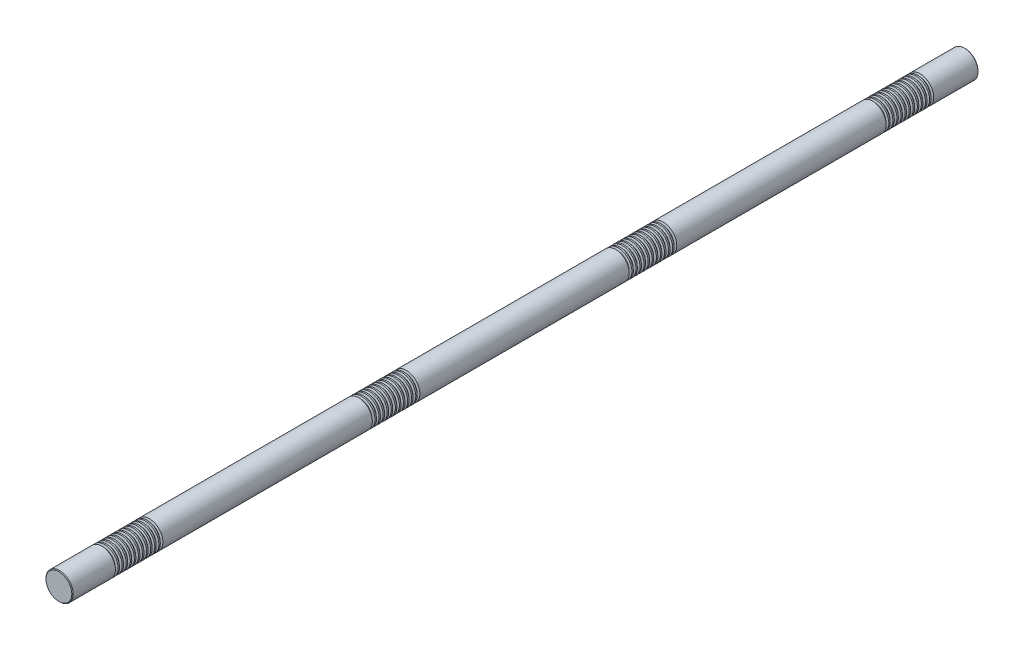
ISO-10303-21;
HEADER;
FILE_DESCRIPTION(('STEP AP214'),'2;1');
FILE_NAME('part.step','',(''),(''),'','','');
FILE_SCHEMA(('AUTOMOTIVE_DESIGN { 1 0 10303 214 1 1 1 1 }'));
ENDSEC;
DATA;
#1=APPLICATION_CONTEXT('core data for automotive mechanical design processes');
#2=APPLICATION_PROTOCOL_DEFINITION('international standard','automotive_design',2000,#1);
#3=PRODUCT_CONTEXT('',#1,'mechanical');
#4=PRODUCT('Part','Part','',(#3));
#5=PRODUCT_RELATED_PRODUCT_CATEGORY('part','',(#4));
#6=PRODUCT_DEFINITION_FORMATION('','',#4);
#7=PRODUCT_DEFINITION_CONTEXT('part definition',#1,'design');
#8=PRODUCT_DEFINITION('design','',#6,#7);
#9=PRODUCT_DEFINITION_SHAPE('','',#8);
#10=(LENGTH_UNIT() NAMED_UNIT(*) SI_UNIT(.MILLI.,.METRE.));
#11=(NAMED_UNIT(*) PLANE_ANGLE_UNIT() SI_UNIT($,.RADIAN.));
#12=(NAMED_UNIT(*) SI_UNIT($,.STERADIAN.) SOLID_ANGLE_UNIT());
#13=UNCERTAINTY_MEASURE_WITH_UNIT(LENGTH_MEASURE(1.E-05),#10,'distance_accuracy_value','');
#14=(GEOMETRIC_REPRESENTATION_CONTEXT(3) GLOBAL_UNCERTAINTY_ASSIGNED_CONTEXT((#13)) GLOBAL_UNIT_ASSIGNED_CONTEXT((#10,
#11,#12)) REPRESENTATION_CONTEXT('',''));
#15=CARTESIAN_POINT('',(0.,0.,0.));
#16=DIRECTION('',(0.,0.,1.));
#17=DIRECTION('',(1.,0.,0.));
#18=AXIS2_PLACEMENT_3D('',#15,#16,#17);
#19=CARTESIAN_POINT('',(0.,0.,1000.));
#20=DIRECTION('',(0.,0.,-1.));
#21=DIRECTION('',(-1.,0.,0.));
#22=AXIS2_PLACEMENT_3D('',#19,#20,#21);
#23=CYLINDRICAL_SURFACE('',#22,30.);
#24=CARTESIAN_POINT('',(0.,0.,896.169872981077));
#25=DIRECTION('',(0.,0.,1.));
#26=DIRECTION('',(1.,0.,0.));
#27=AXIS2_PLACEMENT_3D('',#24,#25,#26);
#28=CIRCLE('',#27,30.);
#29=CARTESIAN_POINT('',(30.,0.,896.169872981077));
#30=VERTEX_POINT('',#29);
#31=EDGE_CURVE('E801',#30,#30,#28,.T.);
#32=ORIENTED_EDGE('',*,*,#31,.T.);
#33=EDGE_LOOP('',(#32));
#34=FACE_BOUND('',#33,.T.);
#35=CARTESIAN_POINT('',(0.,0.,899.330127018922));
#36=DIRECTION('',(0.,0.,1.));
#37=DIRECTION('',(1.,0.,0.));
#38=AXIS2_PLACEMENT_3D('',#35,#36,#37);
#39=CIRCLE('',#38,30.);
#40=CARTESIAN_POINT('',(30.,0.,899.330127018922));
#41=VERTEX_POINT('',#40);
#42=EDGE_CURVE('E813',#41,#41,#39,.T.);
#43=ORIENTED_EDGE('',*,*,#42,.F.);
#44=EDGE_LOOP('',(#43));
#45=FACE_BOUND('',#44,.T.);
#46=ADVANCED_FACE('F37',(#34,#45),#23,.T.);
#47=CARTESIAN_POINT('',(0.,0.,887.169872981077));
#48=DIRECTION('',(0.,0.,1.));
#49=DIRECTION('',(1.,0.,0.));
#50=AXIS2_PLACEMENT_3D('',#47,#48,#49);
#51=CIRCLE('',#50,30.);
#52=CARTESIAN_POINT('',(30.,0.,887.169872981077));
#53=VERTEX_POINT('',#52);
#54=EDGE_CURVE('E785',#53,#53,#51,.T.);
#55=ORIENTED_EDGE('',*,*,#54,.T.);
#56=EDGE_LOOP('',(#55));
#57=FACE_BOUND('',#56,.T.);
#58=CARTESIAN_POINT('',(0.,0.,890.330127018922));
#59=DIRECTION('',(0.,0.,1.));
#60=DIRECTION('',(1.,0.,0.));
#61=AXIS2_PLACEMENT_3D('',#58,#59,#60);
#62=CIRCLE('',#61,30.);
#63=CARTESIAN_POINT('',(30.,0.,890.330127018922));
#64=VERTEX_POINT('',#63);
#65=EDGE_CURVE('E797',#64,#64,#62,.T.);
#66=ORIENTED_EDGE('',*,*,#65,.F.);
#67=EDGE_LOOP('',(#66));
#68=FACE_BOUND('',#67,.T.);
#69=ADVANCED_FACE('F849',(#57,#68),#23,.T.);
#70=CARTESIAN_POINT('',(0.,0.,878.169872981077));
#71=DIRECTION('',(0.,0.,1.));
#72=DIRECTION('',(1.,0.,0.));
#73=AXIS2_PLACEMENT_3D('',#70,#71,#72);
#74=CIRCLE('',#73,30.);
#75=CARTESIAN_POINT('',(30.,0.,878.169872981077));
#76=VERTEX_POINT('',#75);
#77=EDGE_CURVE('E769',#76,#76,#74,.T.);
#78=ORIENTED_EDGE('',*,*,#77,.T.);
#79=EDGE_LOOP('',(#78));
#80=FACE_BOUND('',#79,.T.);
#81=CARTESIAN_POINT('',(0.,0.,881.330127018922));
#82=DIRECTION('',(0.,0.,1.));
#83=DIRECTION('',(1.,0.,0.));
#84=AXIS2_PLACEMENT_3D('',#81,#82,#83);
#85=CIRCLE('',#84,30.);
#86=CARTESIAN_POINT('',(30.,0.,881.330127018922));
#87=VERTEX_POINT('',#86);
#88=EDGE_CURVE('E781',#87,#87,#85,.T.);
#89=ORIENTED_EDGE('',*,*,#88,.F.);
#90=EDGE_LOOP('',(#89));
#91=FACE_BOUND('',#90,.T.);
#92=ADVANCED_FACE('F857',(#80,#91),#23,.T.);
#93=CARTESIAN_POINT('',(0.,0.,869.169872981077));
#94=DIRECTION('',(0.,0.,1.));
#95=DIRECTION('',(1.,0.,0.));
#96=AXIS2_PLACEMENT_3D('',#93,#94,#95);
#97=CIRCLE('',#96,30.);
#98=CARTESIAN_POINT('',(30.,0.,869.169872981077));
#99=VERTEX_POINT('',#98);
#100=EDGE_CURVE('E753',#99,#99,#97,.T.);
#101=ORIENTED_EDGE('',*,*,#100,.T.);
#102=EDGE_LOOP('',(#101));
#103=FACE_BOUND('',#102,.T.);
#104=CARTESIAN_POINT('',(0.,0.,872.330127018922));
#105=DIRECTION('',(0.,0.,1.));
#106=DIRECTION('',(1.,0.,0.));
#107=AXIS2_PLACEMENT_3D('',#104,#105,#106);
#108=CIRCLE('',#107,30.);
#109=CARTESIAN_POINT('',(30.,0.,872.330127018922));
#110=VERTEX_POINT('',#109);
#111=EDGE_CURVE('E765',#110,#110,#108,.T.);
#112=ORIENTED_EDGE('',*,*,#111,.F.);
#113=EDGE_LOOP('',(#112));
#114=FACE_BOUND('',#113,.T.);
#115=ADVANCED_FACE('F1866',(#103,#114),#23,.T.);
#116=CARTESIAN_POINT('',(0.,0.,860.169872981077));
#117=DIRECTION('',(0.,0.,1.));
#118=DIRECTION('',(1.,0.,0.));
#119=AXIS2_PLACEMENT_3D('',#116,#117,#118);
#120=CIRCLE('',#119,30.);
#121=CARTESIAN_POINT('',(30.,0.,860.169872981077));
#122=VERTEX_POINT('',#121);
#123=EDGE_CURVE('E737',#122,#122,#120,.T.);
#124=ORIENTED_EDGE('',*,*,#123,.T.);
#125=EDGE_LOOP('',(#124));
#126=FACE_BOUND('',#125,.T.);
#127=CARTESIAN_POINT('',(0.,0.,863.330127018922));
#128=DIRECTION('',(0.,0.,1.));
#129=DIRECTION('',(1.,0.,0.));
#130=AXIS2_PLACEMENT_3D('',#127,#128,#129);
#131=CIRCLE('',#130,30.);
#132=CARTESIAN_POINT('',(30.,0.,863.330127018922));
#133=VERTEX_POINT('',#132);
#134=EDGE_CURVE('E749',#133,#133,#131,.T.);
#135=ORIENTED_EDGE('',*,*,#134,.F.);
#136=EDGE_LOOP('',(#135));
#137=FACE_BOUND('',#136,.T.);
#138=ADVANCED_FACE('F1843',(#126,#137),#23,.T.);
#139=CARTESIAN_POINT('',(0.,0.,851.169872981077));
#140=DIRECTION('',(0.,0.,1.));
#141=DIRECTION('',(1.,0.,0.));
#142=AXIS2_PLACEMENT_3D('',#139,#140,#141);
#143=CIRCLE('',#142,30.);
#144=CARTESIAN_POINT('',(30.,0.,851.169872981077));
#145=VERTEX_POINT('',#144);
#146=EDGE_CURVE('E722',#145,#145,#143,.T.);
#147=ORIENTED_EDGE('',*,*,#146,.T.);
#148=EDGE_LOOP('',(#147));
#149=FACE_BOUND('',#148,.T.);
#150=CARTESIAN_POINT('',(0.,0.,854.330127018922));
#151=DIRECTION('',(0.,0.,1.));
#152=DIRECTION('',(1.,0.,0.));
#153=AXIS2_PLACEMENT_3D('',#150,#151,#152);
#154=CIRCLE('',#153,30.);
#155=CARTESIAN_POINT('',(30.,0.,854.330127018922));
#156=VERTEX_POINT('',#155);
#157=EDGE_CURVE('E733',#156,#156,#154,.T.);
#158=ORIENTED_EDGE('',*,*,#157,.F.);
#159=EDGE_LOOP('',(#158));
#160=FACE_BOUND('',#159,.T.);
#161=ADVANCED_FACE('F1820',(#149,#160),#23,.T.);
#162=CARTESIAN_POINT('',(0.,0.,842.169872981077));
#163=DIRECTION('',(0.,0.,1.));
#164=DIRECTION('',(1.,0.,0.));
#165=AXIS2_PLACEMENT_3D('',#162,#163,#164);
#166=CIRCLE('',#165,30.);
#167=CARTESIAN_POINT('',(30.,0.,842.169872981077));
#168=VERTEX_POINT('',#167);
#169=EDGE_CURVE('E706',#168,#168,#166,.T.);
#170=ORIENTED_EDGE('',*,*,#169,.T.);
#171=EDGE_LOOP('',(#170));
#172=FACE_BOUND('',#171,.T.);
#173=CARTESIAN_POINT('',(0.,0.,845.330127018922));
#174=DIRECTION('',(0.,0.,1.));
#175=DIRECTION('',(1.,0.,0.));
#176=AXIS2_PLACEMENT_3D('',#173,#174,#175);
#177=CIRCLE('',#176,30.);
#178=CARTESIAN_POINT('',(30.,0.,845.330127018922));
#179=VERTEX_POINT('',#178);
#180=EDGE_CURVE('E718',#179,#179,#177,.T.);
#181=ORIENTED_EDGE('',*,*,#180,.F.);
#182=EDGE_LOOP('',(#181));
#183=FACE_BOUND('',#182,.T.);
#184=ADVANCED_FACE('F1797',(#172,#183),#23,.T.);
#185=CARTESIAN_POINT('',(0.,0.,833.169872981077));
#186=DIRECTION('',(0.,0.,1.));
#187=DIRECTION('',(1.,0.,0.));
#188=AXIS2_PLACEMENT_3D('',#185,#186,#187);
#189=CIRCLE('',#188,30.);
#190=CARTESIAN_POINT('',(30.,0.,833.169872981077));
#191=VERTEX_POINT('',#190);
#192=EDGE_CURVE('E690',#191,#191,#189,.T.);
#193=ORIENTED_EDGE('',*,*,#192,.T.);
#194=EDGE_LOOP('',(#193));
#195=FACE_BOUND('',#194,.T.);
#196=CARTESIAN_POINT('',(0.,0.,836.330127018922));
#197=DIRECTION('',(0.,0.,1.));
#198=DIRECTION('',(1.,0.,0.));
#199=AXIS2_PLACEMENT_3D('',#196,#197,#198);
#200=CIRCLE('',#199,30.);
#201=CARTESIAN_POINT('',(30.,0.,836.330127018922));
#202=VERTEX_POINT('',#201);
#203=EDGE_CURVE('E702',#202,#202,#200,.T.);
#204=ORIENTED_EDGE('',*,*,#203,.F.);
#205=EDGE_LOOP('',(#204));
#206=FACE_BOUND('',#205,.T.);
#207=ADVANCED_FACE('F1774',(#195,#206),#23,.T.);
#208=CARTESIAN_POINT('',(0.,0.,824.169872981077));
#209=DIRECTION('',(0.,0.,1.));
#210=DIRECTION('',(1.,0.,0.));
#211=AXIS2_PLACEMENT_3D('',#208,#209,#210);
#212=CIRCLE('',#211,30.);
#213=CARTESIAN_POINT('',(30.,0.,824.169872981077));
#214=VERTEX_POINT('',#213);
#215=EDGE_CURVE('E675',#214,#214,#212,.T.);
#216=ORIENTED_EDGE('',*,*,#215,.T.);
#217=EDGE_LOOP('',(#216));
#218=FACE_BOUND('',#217,.T.);
#219=CARTESIAN_POINT('',(0.,0.,827.330127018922));
#220=DIRECTION('',(0.,0.,1.));
#221=DIRECTION('',(1.,0.,0.));
#222=AXIS2_PLACEMENT_3D('',#219,#220,#221);
#223=CIRCLE('',#222,30.);
#224=CARTESIAN_POINT('',(30.,0.,827.330127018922));
#225=VERTEX_POINT('',#224);
#226=EDGE_CURVE('E686',#225,#225,#223,.T.);
#227=ORIENTED_EDGE('',*,*,#226,.F.);
#228=EDGE_LOOP('',(#227));
#229=FACE_BOUND('',#228,.T.);
#230=ADVANCED_FACE('F1751',(#218,#229),#23,.T.);
#231=CARTESIAN_POINT('',(0.,0.,815.169872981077));
#232=DIRECTION('',(0.,0.,1.));
#233=DIRECTION('',(1.,0.,0.));
#234=AXIS2_PLACEMENT_3D('',#231,#232,#233);
#235=CIRCLE('',#234,30.);
#236=CARTESIAN_POINT('',(30.,0.,815.169872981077));
#237=VERTEX_POINT('',#236);
#238=EDGE_CURVE('E659',#237,#237,#235,.T.);
#239=ORIENTED_EDGE('',*,*,#238,.T.);
#240=EDGE_LOOP('',(#239));
#241=FACE_BOUND('',#240,.T.);
#242=CARTESIAN_POINT('',(0.,0.,818.330127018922));
#243=DIRECTION('',(0.,0.,1.));
#244=DIRECTION('',(1.,0.,0.));
#245=AXIS2_PLACEMENT_3D('',#242,#243,#244);
#246=CIRCLE('',#245,30.);
#247=CARTESIAN_POINT('',(30.,0.,818.330127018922));
#248=VERTEX_POINT('',#247);
#249=EDGE_CURVE('E671',#248,#248,#246,.T.);
#250=ORIENTED_EDGE('',*,*,#249,.F.);
#251=EDGE_LOOP('',(#250));
#252=FACE_BOUND('',#251,.T.);
#253=ADVANCED_FACE('F1732',(#241,#252),#23,.T.);
#254=CARTESIAN_POINT('',(0.,0.,806.169872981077));
#255=DIRECTION('',(0.,0.,1.));
#256=DIRECTION('',(1.,0.,0.));
#257=AXIS2_PLACEMENT_3D('',#254,#255,#256);
#258=CIRCLE('',#257,30.);
#259=CARTESIAN_POINT('',(30.,0.,806.169872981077));
#260=VERTEX_POINT('',#259);
#261=EDGE_CURVE('E291',#260,#260,#258,.T.);
#262=ORIENTED_EDGE('',*,*,#261,.T.);
#263=EDGE_LOOP('',(#262));
#264=FACE_BOUND('',#263,.T.);
#265=CARTESIAN_POINT('',(0.,0.,809.330127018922));
#266=DIRECTION('',(0.,0.,1.));
#267=DIRECTION('',(1.,0.,0.));
#268=AXIS2_PLACEMENT_3D('',#265,#266,#267);
#269=CIRCLE('',#268,30.);
#270=CARTESIAN_POINT('',(30.,0.,809.330127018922));
#271=VERTEX_POINT('',#270);
#272=EDGE_CURVE('E655',#271,#271,#269,.T.);
#273=ORIENTED_EDGE('',*,*,#272,.F.);
#274=EDGE_LOOP('',(#273));
#275=FACE_BOUND('',#274,.T.);
#276=ADVANCED_FACE('F1681',(#264,#275),#23,.T.);
#277=CARTESIAN_POINT('',(0.,0.,329.169872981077));
#278=DIRECTION('',(0.,0.,1.));
#279=DIRECTION('',(1.,0.,0.));
#280=AXIS2_PLACEMENT_3D('',#277,#278,#279);
#281=CIRCLE('',#280,30.);
#282=CARTESIAN_POINT('',(30.,0.,329.169872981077));
#283=VERTEX_POINT('',#282);
#284=EDGE_CURVE('E627',#283,#283,#281,.T.);
#285=ORIENTED_EDGE('',*,*,#284,.T.);
#286=EDGE_LOOP('',(#285));
#287=FACE_BOUND('',#286,.T.);
#288=CARTESIAN_POINT('',(0.,0.,332.330127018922));
#289=DIRECTION('',(0.,0.,1.));
#290=DIRECTION('',(1.,0.,0.));
#291=AXIS2_PLACEMENT_3D('',#288,#289,#290);
#292=CIRCLE('',#291,30.);
#293=CARTESIAN_POINT('',(30.,0.,332.330127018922));
#294=VERTEX_POINT('',#293);
#295=EDGE_CURVE('E639',#294,#294,#292,.T.);
#296=ORIENTED_EDGE('',*,*,#295,.F.);
#297=EDGE_LOOP('',(#296));
#298=FACE_BOUND('',#297,.T.);
#299=ADVANCED_FACE('F1657',(#287,#298),#23,.T.);
#300=CARTESIAN_POINT('',(0.,0.,320.169872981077));
#301=DIRECTION('',(0.,0.,1.));
#302=DIRECTION('',(1.,0.,0.));
#303=AXIS2_PLACEMENT_3D('',#300,#301,#302);
#304=CIRCLE('',#303,30.);
#305=CARTESIAN_POINT('',(30.,0.,320.169872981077));
#306=VERTEX_POINT('',#305);
#307=EDGE_CURVE('E611',#306,#306,#304,.T.);
#308=ORIENTED_EDGE('',*,*,#307,.T.);
#309=EDGE_LOOP('',(#308));
#310=FACE_BOUND('',#309,.T.);
#311=CARTESIAN_POINT('',(0.,0.,323.330127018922));
#312=DIRECTION('',(0.,0.,1.));
#313=DIRECTION('',(1.,0.,0.));
#314=AXIS2_PLACEMENT_3D('',#311,#312,#313);
#315=CIRCLE('',#314,30.);
#316=CARTESIAN_POINT('',(30.,0.,323.330127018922));
#317=VERTEX_POINT('',#316);
#318=EDGE_CURVE('E623',#317,#317,#315,.T.);
#319=ORIENTED_EDGE('',*,*,#318,.F.);
#320=EDGE_LOOP('',(#319));
#321=FACE_BOUND('',#320,.T.);
#322=ADVANCED_FACE('F1634',(#310,#321),#23,.T.);
#323=CARTESIAN_POINT('',(0.,0.,311.169872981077));
#324=DIRECTION('',(0.,0.,1.));
#325=DIRECTION('',(1.,0.,0.));
#326=AXIS2_PLACEMENT_3D('',#323,#324,#325);
#327=CIRCLE('',#326,30.);
#328=CARTESIAN_POINT('',(30.,0.,311.169872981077));
#329=VERTEX_POINT('',#328);
#330=EDGE_CURVE('E595',#329,#329,#327,.T.);
#331=ORIENTED_EDGE('',*,*,#330,.T.);
#332=EDGE_LOOP('',(#331));
#333=FACE_BOUND('',#332,.T.);
#334=CARTESIAN_POINT('',(0.,0.,314.330127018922));
#335=DIRECTION('',(0.,0.,1.));
#336=DIRECTION('',(1.,0.,0.));
#337=AXIS2_PLACEMENT_3D('',#334,#335,#336);
#338=CIRCLE('',#337,30.);
#339=CARTESIAN_POINT('',(30.,0.,314.330127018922));
#340=VERTEX_POINT('',#339);
#341=EDGE_CURVE('E607',#340,#340,#338,.T.);
#342=ORIENTED_EDGE('',*,*,#341,.F.);
#343=EDGE_LOOP('',(#342));
#344=FACE_BOUND('',#343,.T.);
#345=ADVANCED_FACE('F1611',(#333,#344),#23,.T.);
#346=CARTESIAN_POINT('',(0.,0.,302.169872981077));
#347=DIRECTION('',(0.,0.,1.));
#348=DIRECTION('',(1.,0.,0.));
#349=AXIS2_PLACEMENT_3D('',#346,#347,#348);
#350=CIRCLE('',#349,30.);
#351=CARTESIAN_POINT('',(30.,0.,302.169872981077));
#352=VERTEX_POINT('',#351);
#353=EDGE_CURVE('E579',#352,#352,#350,.T.);
#354=ORIENTED_EDGE('',*,*,#353,.T.);
#355=EDGE_LOOP('',(#354));
#356=FACE_BOUND('',#355,.T.);
#357=CARTESIAN_POINT('',(0.,0.,305.330127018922));
#358=DIRECTION('',(0.,0.,1.));
#359=DIRECTION('',(1.,0.,0.));
#360=AXIS2_PLACEMENT_3D('',#357,#358,#359);
#361=CIRCLE('',#360,30.);
#362=CARTESIAN_POINT('',(30.,0.,305.330127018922));
#363=VERTEX_POINT('',#362);
#364=EDGE_CURVE('E591',#363,#363,#361,.T.);
#365=ORIENTED_EDGE('',*,*,#364,.F.);
#366=EDGE_LOOP('',(#365));
#367=FACE_BOUND('',#366,.T.);
#368=ADVANCED_FACE('F1588',(#356,#367),#23,.T.);
#369=CARTESIAN_POINT('',(0.,0.,293.169872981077));
#370=DIRECTION('',(0.,0.,1.));
#371=DIRECTION('',(1.,0.,0.));
#372=AXIS2_PLACEMENT_3D('',#369,#370,#371);
#373=CIRCLE('',#372,30.);
#374=CARTESIAN_POINT('',(30.,0.,293.169872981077));
#375=VERTEX_POINT('',#374);
#376=EDGE_CURVE('E563',#375,#375,#373,.T.);
#377=ORIENTED_EDGE('',*,*,#376,.T.);
#378=EDGE_LOOP('',(#377));
#379=FACE_BOUND('',#378,.T.);
#380=CARTESIAN_POINT('',(0.,0.,296.330127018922));
#381=DIRECTION('',(0.,0.,1.));
#382=DIRECTION('',(1.,0.,0.));
#383=AXIS2_PLACEMENT_3D('',#380,#381,#382);
#384=CIRCLE('',#383,30.);
#385=CARTESIAN_POINT('',(30.,0.,296.330127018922));
#386=VERTEX_POINT('',#385);
#387=EDGE_CURVE('E575',#386,#386,#384,.T.);
#388=ORIENTED_EDGE('',*,*,#387,.F.);
#389=EDGE_LOOP('',(#388));
#390=FACE_BOUND('',#389,.T.);
#391=ADVANCED_FACE('F1565',(#379,#390),#23,.T.);
#392=CARTESIAN_POINT('',(0.,0.,284.169872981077));
#393=DIRECTION('',(0.,0.,1.));
#394=DIRECTION('',(1.,0.,0.));
#395=AXIS2_PLACEMENT_3D('',#392,#393,#394);
#396=CIRCLE('',#395,30.);
#397=CARTESIAN_POINT('',(30.,0.,284.169872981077));
#398=VERTEX_POINT('',#397);
#399=EDGE_CURVE('E547',#398,#398,#396,.T.);
#400=ORIENTED_EDGE('',*,*,#399,.T.);
#401=EDGE_LOOP('',(#400));
#402=FACE_BOUND('',#401,.T.);
#403=CARTESIAN_POINT('',(0.,0.,287.330127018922));
#404=DIRECTION('',(0.,0.,1.));
#405=DIRECTION('',(1.,0.,0.));
#406=AXIS2_PLACEMENT_3D('',#403,#404,#405);
#407=CIRCLE('',#406,30.);
#408=CARTESIAN_POINT('',(30.,0.,287.330127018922));
#409=VERTEX_POINT('',#408);
#410=EDGE_CURVE('E559',#409,#409,#407,.T.);
#411=ORIENTED_EDGE('',*,*,#410,.F.);
#412=EDGE_LOOP('',(#411));
#413=FACE_BOUND('',#412,.T.);
#414=ADVANCED_FACE('F1542',(#402,#413),#23,.T.);
#415=CARTESIAN_POINT('',(0.,0.,275.169872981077));
#416=DIRECTION('',(0.,0.,1.));
#417=DIRECTION('',(1.,0.,0.));
#418=AXIS2_PLACEMENT_3D('',#415,#416,#417);
#419=CIRCLE('',#418,30.);
#420=CARTESIAN_POINT('',(30.,0.,275.169872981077));
#421=VERTEX_POINT('',#420);
#422=EDGE_CURVE('E531',#421,#421,#419,.T.);
#423=ORIENTED_EDGE('',*,*,#422,.T.);
#424=EDGE_LOOP('',(#423));
#425=FACE_BOUND('',#424,.T.);
#426=CARTESIAN_POINT('',(0.,0.,278.330127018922));
#427=DIRECTION('',(0.,0.,1.));
#428=DIRECTION('',(1.,0.,0.));
#429=AXIS2_PLACEMENT_3D('',#426,#427,#428);
#430=CIRCLE('',#429,30.);
#431=CARTESIAN_POINT('',(30.,0.,278.330127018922));
#432=VERTEX_POINT('',#431);
#433=EDGE_CURVE('E543',#432,#432,#430,.T.);
#434=ORIENTED_EDGE('',*,*,#433,.F.);
#435=EDGE_LOOP('',(#434));
#436=FACE_BOUND('',#435,.T.);
#437=ADVANCED_FACE('F1519',(#425,#436),#23,.T.);
#438=CARTESIAN_POINT('',(0.,0.,266.169872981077));
#439=DIRECTION('',(0.,0.,1.));
#440=DIRECTION('',(1.,0.,0.));
#441=AXIS2_PLACEMENT_3D('',#438,#439,#440);
#442=CIRCLE('',#441,30.);
#443=CARTESIAN_POINT('',(30.,0.,266.169872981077));
#444=VERTEX_POINT('',#443);
#445=EDGE_CURVE('E515',#444,#444,#442,.T.);
#446=ORIENTED_EDGE('',*,*,#445,.T.);
#447=EDGE_LOOP('',(#446));
#448=FACE_BOUND('',#447,.T.);
#449=CARTESIAN_POINT('',(0.,0.,269.330127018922));
#450=DIRECTION('',(0.,0.,1.));
#451=DIRECTION('',(1.,0.,0.));
#452=AXIS2_PLACEMENT_3D('',#449,#450,#451);
#453=CIRCLE('',#452,30.);
#454=CARTESIAN_POINT('',(30.,0.,269.330127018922));
#455=VERTEX_POINT('',#454);
#456=EDGE_CURVE('E527',#455,#455,#453,.T.);
#457=ORIENTED_EDGE('',*,*,#456,.F.);
#458=EDGE_LOOP('',(#457));
#459=FACE_BOUND('',#458,.T.);
#460=ADVANCED_FACE('F1496',(#448,#459),#23,.T.);
#461=CARTESIAN_POINT('',(0.,0.,257.169872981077));
#462=DIRECTION('',(0.,0.,1.));
#463=DIRECTION('',(1.,0.,0.));
#464=AXIS2_PLACEMENT_3D('',#461,#462,#463);
#465=CIRCLE('',#464,30.);
#466=CARTESIAN_POINT('',(30.,0.,257.169872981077));
#467=VERTEX_POINT('',#466);
#468=EDGE_CURVE('E499',#467,#467,#465,.T.);
#469=ORIENTED_EDGE('',*,*,#468,.T.);
#470=EDGE_LOOP('',(#469));
#471=FACE_BOUND('',#470,.T.);
#472=CARTESIAN_POINT('',(0.,0.,260.330127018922));
#473=DIRECTION('',(0.,0.,1.));
#474=DIRECTION('',(1.,0.,0.));
#475=AXIS2_PLACEMENT_3D('',#472,#473,#474);
#476=CIRCLE('',#475,30.);
#477=CARTESIAN_POINT('',(30.,0.,260.330127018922));
#478=VERTEX_POINT('',#477);
#479=EDGE_CURVE('E511',#478,#478,#476,.T.);
#480=ORIENTED_EDGE('',*,*,#479,.F.);
#481=EDGE_LOOP('',(#480));
#482=FACE_BOUND('',#481,.T.);
#483=ADVANCED_FACE('F1473',(#471,#482),#23,.T.);
#484=CARTESIAN_POINT('',(0.,0.,248.169872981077));
#485=DIRECTION('',(0.,0.,1.));
#486=DIRECTION('',(1.,0.,0.));
#487=AXIS2_PLACEMENT_3D('',#484,#485,#486);
#488=CIRCLE('',#487,30.);
#489=CARTESIAN_POINT('',(30.,0.,248.169872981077));
#490=VERTEX_POINT('',#489);
#491=EDGE_CURVE('E483',#490,#490,#488,.T.);
#492=ORIENTED_EDGE('',*,*,#491,.T.);
#493=EDGE_LOOP('',(#492));
#494=FACE_BOUND('',#493,.T.);
#495=CARTESIAN_POINT('',(0.,0.,251.330127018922));
#496=DIRECTION('',(0.,0.,1.));
#497=DIRECTION('',(1.,0.,0.));
#498=AXIS2_PLACEMENT_3D('',#495,#496,#497);
#499=CIRCLE('',#498,30.);
#500=CARTESIAN_POINT('',(30.,0.,251.330127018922));
#501=VERTEX_POINT('',#500);
#502=EDGE_CURVE('E495',#501,#501,#499,.T.);
#503=ORIENTED_EDGE('',*,*,#502,.F.);
#504=EDGE_LOOP('',(#503));
#505=FACE_BOUND('',#504,.T.);
#506=ADVANCED_FACE('F1454',(#494,#505),#23,.T.);
#507=CARTESIAN_POINT('',(0.,0.,239.169872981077));
#508=DIRECTION('',(0.,0.,1.));
#509=DIRECTION('',(1.,0.,0.));
#510=AXIS2_PLACEMENT_3D('',#507,#508,#509);
#511=CIRCLE('',#510,30.);
#512=CARTESIAN_POINT('',(30.,0.,239.169872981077));
#513=VERTEX_POINT('',#512);
#514=EDGE_CURVE('E275',#513,#513,#511,.T.);
#515=ORIENTED_EDGE('',*,*,#514,.T.);
#516=EDGE_LOOP('',(#515));
#517=FACE_BOUND('',#516,.T.);
#518=CARTESIAN_POINT('',(0.,0.,242.330127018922));
#519=DIRECTION('',(0.,0.,1.));
#520=DIRECTION('',(1.,0.,0.));
#521=AXIS2_PLACEMENT_3D('',#518,#519,#520);
#522=CIRCLE('',#521,30.);
#523=CARTESIAN_POINT('',(30.,0.,242.330127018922));
#524=VERTEX_POINT('',#523);
#525=EDGE_CURVE('E479',#524,#524,#522,.T.);
#526=ORIENTED_EDGE('',*,*,#525,.F.);
#527=EDGE_LOOP('',(#526));
#528=FACE_BOUND('',#527,.T.);
#529=ADVANCED_FACE('F1403',(#517,#528),#23,.T.);
#530=CARTESIAN_POINT('',(0.,0.,-237.830127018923));
#531=DIRECTION('',(0.,0.,1.));
#532=DIRECTION('',(1.,0.,0.));
#533=AXIS2_PLACEMENT_3D('',#530,#531,#532);
#534=CIRCLE('',#533,30.);
#535=CARTESIAN_POINT('',(30.,0.,-237.830127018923));
#536=VERTEX_POINT('',#535);
#537=EDGE_CURVE('E451',#536,#536,#534,.T.);
#538=ORIENTED_EDGE('',*,*,#537,.T.);
#539=EDGE_LOOP('',(#538));
#540=FACE_BOUND('',#539,.T.);
#541=CARTESIAN_POINT('',(0.,0.,-234.669872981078));
#542=DIRECTION('',(0.,0.,1.));
#543=DIRECTION('',(1.,0.,0.));
#544=AXIS2_PLACEMENT_3D('',#541,#542,#543);
#545=CIRCLE('',#544,30.);
#546=CARTESIAN_POINT('',(30.,0.,-234.669872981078));
#547=VERTEX_POINT('',#546);
#548=EDGE_CURVE('E463',#547,#547,#545,.T.);
#549=ORIENTED_EDGE('',*,*,#548,.F.);
#550=EDGE_LOOP('',(#549));
#551=FACE_BOUND('',#550,.T.);
#552=ADVANCED_FACE('F1379',(#540,#551),#23,.T.);
#553=CARTESIAN_POINT('',(0.,0.,-246.830127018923));
#554=DIRECTION('',(0.,0.,1.));
#555=DIRECTION('',(1.,0.,0.));
#556=AXIS2_PLACEMENT_3D('',#553,#554,#555);
#557=CIRCLE('',#556,30.);
#558=CARTESIAN_POINT('',(30.,0.,-246.830127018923));
#559=VERTEX_POINT('',#558);
#560=EDGE_CURVE('E435',#559,#559,#557,.T.);
#561=ORIENTED_EDGE('',*,*,#560,.T.);
#562=EDGE_LOOP('',(#561));
#563=FACE_BOUND('',#562,.T.);
#564=CARTESIAN_POINT('',(0.,0.,-243.669872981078));
#565=DIRECTION('',(0.,0.,1.));
#566=DIRECTION('',(1.,0.,0.));
#567=AXIS2_PLACEMENT_3D('',#564,#565,#566);
#568=CIRCLE('',#567,30.);
#569=CARTESIAN_POINT('',(30.,0.,-243.669872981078));
#570=VERTEX_POINT('',#569);
#571=EDGE_CURVE('E447',#570,#570,#568,.T.);
#572=ORIENTED_EDGE('',*,*,#571,.F.);
#573=EDGE_LOOP('',(#572));
#574=FACE_BOUND('',#573,.T.);
#575=ADVANCED_FACE('F1356',(#563,#574),#23,.T.);
#576=CARTESIAN_POINT('',(0.,0.,-255.830127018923));
#577=DIRECTION('',(0.,0.,1.));
#578=DIRECTION('',(1.,0.,0.));
#579=AXIS2_PLACEMENT_3D('',#576,#577,#578);
#580=CIRCLE('',#579,30.);
#581=CARTESIAN_POINT('',(30.,0.,-255.830127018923));
#582=VERTEX_POINT('',#581);
#583=EDGE_CURVE('E419',#582,#582,#580,.T.);
#584=ORIENTED_EDGE('',*,*,#583,.T.);
#585=EDGE_LOOP('',(#584));
#586=FACE_BOUND('',#585,.T.);
#587=CARTESIAN_POINT('',(0.,0.,-252.669872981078));
#588=DIRECTION('',(0.,0.,1.));
#589=DIRECTION('',(1.,0.,0.));
#590=AXIS2_PLACEMENT_3D('',#587,#588,#589);
#591=CIRCLE('',#590,30.);
#592=CARTESIAN_POINT('',(30.,0.,-252.669872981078));
#593=VERTEX_POINT('',#592);
#594=EDGE_CURVE('E431',#593,#593,#591,.T.);
#595=ORIENTED_EDGE('',*,*,#594,.F.);
#596=EDGE_LOOP('',(#595));
#597=FACE_BOUND('',#596,.T.);
#598=ADVANCED_FACE('F1333',(#586,#597),#23,.T.);
#599=CARTESIAN_POINT('',(0.,0.,-264.830127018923));
#600=DIRECTION('',(0.,0.,1.));
#601=DIRECTION('',(1.,0.,0.));
#602=AXIS2_PLACEMENT_3D('',#599,#600,#601);
#603=CIRCLE('',#602,30.);
#604=CARTESIAN_POINT('',(30.,0.,-264.830127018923));
#605=VERTEX_POINT('',#604);
#606=EDGE_CURVE('E403',#605,#605,#603,.T.);
#607=ORIENTED_EDGE('',*,*,#606,.T.);
#608=EDGE_LOOP('',(#607));
#609=FACE_BOUND('',#608,.T.);
#610=CARTESIAN_POINT('',(0.,0.,-261.669872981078));
#611=DIRECTION('',(0.,0.,1.));
#612=DIRECTION('',(1.,0.,0.));
#613=AXIS2_PLACEMENT_3D('',#610,#611,#612);
#614=CIRCLE('',#613,30.);
#615=CARTESIAN_POINT('',(30.,0.,-261.669872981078));
#616=VERTEX_POINT('',#615);
#617=EDGE_CURVE('E415',#616,#616,#614,.T.);
#618=ORIENTED_EDGE('',*,*,#617,.F.);
#619=EDGE_LOOP('',(#618));
#620=FACE_BOUND('',#619,.T.);
#621=ADVANCED_FACE('F1310',(#609,#620),#23,.T.);
#622=CARTESIAN_POINT('',(0.,0.,-273.830127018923));
#623=DIRECTION('',(0.,0.,1.));
#624=DIRECTION('',(1.,0.,0.));
#625=AXIS2_PLACEMENT_3D('',#622,#623,#624);
#626=CIRCLE('',#625,30.);
#627=CARTESIAN_POINT('',(30.,0.,-273.830127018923));
#628=VERTEX_POINT('',#627);
#629=EDGE_CURVE('E387',#628,#628,#626,.T.);
#630=ORIENTED_EDGE('',*,*,#629,.T.);
#631=EDGE_LOOP('',(#630));
#632=FACE_BOUND('',#631,.T.);
#633=CARTESIAN_POINT('',(0.,0.,-270.669872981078));
#634=DIRECTION('',(0.,0.,1.));
#635=DIRECTION('',(1.,0.,0.));
#636=AXIS2_PLACEMENT_3D('',#633,#634,#635);
#637=CIRCLE('',#636,30.);
#638=CARTESIAN_POINT('',(30.,0.,-270.669872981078));
#639=VERTEX_POINT('',#638);
#640=EDGE_CURVE('E399',#639,#639,#637,.T.);
#641=ORIENTED_EDGE('',*,*,#640,.F.);
#642=EDGE_LOOP('',(#641));
#643=FACE_BOUND('',#642,.T.);
#644=ADVANCED_FACE('F1287',(#632,#643),#23,.T.);
#645=CARTESIAN_POINT('',(0.,0.,-282.830127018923));
#646=DIRECTION('',(0.,0.,1.));
#647=DIRECTION('',(1.,0.,0.));
#648=AXIS2_PLACEMENT_3D('',#645,#646,#647);
#649=CIRCLE('',#648,30.);
#650=CARTESIAN_POINT('',(30.,0.,-282.830127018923));
#651=VERTEX_POINT('',#650);
#652=EDGE_CURVE('E371',#651,#651,#649,.T.);
#653=ORIENTED_EDGE('',*,*,#652,.T.);
#654=EDGE_LOOP('',(#653));
#655=FACE_BOUND('',#654,.T.);
#656=CARTESIAN_POINT('',(0.,0.,-279.669872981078));
#657=DIRECTION('',(0.,0.,1.));
#658=DIRECTION('',(1.,0.,0.));
#659=AXIS2_PLACEMENT_3D('',#656,#657,#658);
#660=CIRCLE('',#659,30.);
#661=CARTESIAN_POINT('',(30.,0.,-279.669872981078));
#662=VERTEX_POINT('',#661);
#663=EDGE_CURVE('E383',#662,#662,#660,.T.);
#664=ORIENTED_EDGE('',*,*,#663,.F.);
#665=EDGE_LOOP('',(#664));
#666=FACE_BOUND('',#665,.T.);
#667=ADVANCED_FACE('F1264',(#655,#666),#23,.T.);
#668=CARTESIAN_POINT('',(0.,0.,-291.830127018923));
#669=DIRECTION('',(0.,0.,1.));
#670=DIRECTION('',(1.,0.,0.));
#671=AXIS2_PLACEMENT_3D('',#668,#669,#670);
#672=CIRCLE('',#671,30.);
#673=CARTESIAN_POINT('',(30.,0.,-291.830127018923));
#674=VERTEX_POINT('',#673);
#675=EDGE_CURVE('E355',#674,#674,#672,.T.);
#676=ORIENTED_EDGE('',*,*,#675,.T.);
#677=EDGE_LOOP('',(#676));
#678=FACE_BOUND('',#677,.T.);
#679=CARTESIAN_POINT('',(0.,0.,-288.669872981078));
#680=DIRECTION('',(0.,0.,1.));
#681=DIRECTION('',(1.,0.,0.));
#682=AXIS2_PLACEMENT_3D('',#679,#680,#681);
#683=CIRCLE('',#682,30.);
#684=CARTESIAN_POINT('',(30.,0.,-288.669872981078));
#685=VERTEX_POINT('',#684);
#686=EDGE_CURVE('E367',#685,#685,#683,.T.);
#687=ORIENTED_EDGE('',*,*,#686,.F.);
#688=EDGE_LOOP('',(#687));
#689=FACE_BOUND('',#688,.T.);
#690=ADVANCED_FACE('F1241',(#678,#689),#23,.T.);
#691=CARTESIAN_POINT('',(0.,0.,-300.830127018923));
#692=DIRECTION('',(0.,0.,1.));
#693=DIRECTION('',(1.,0.,0.));
#694=AXIS2_PLACEMENT_3D('',#691,#692,#693);
#695=CIRCLE('',#694,30.);
#696=CARTESIAN_POINT('',(30.,0.,-300.830127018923));
#697=VERTEX_POINT('',#696);
#698=EDGE_CURVE('E339',#697,#697,#695,.T.);
#699=ORIENTED_EDGE('',*,*,#698,.T.);
#700=EDGE_LOOP('',(#699));
#701=FACE_BOUND('',#700,.T.);
#702=CARTESIAN_POINT('',(0.,0.,-297.669872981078));
#703=DIRECTION('',(0.,0.,1.));
#704=DIRECTION('',(1.,0.,0.));
#705=AXIS2_PLACEMENT_3D('',#702,#703,#704);
#706=CIRCLE('',#705,30.);
#707=CARTESIAN_POINT('',(30.,0.,-297.669872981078));
#708=VERTEX_POINT('',#707);
#709=EDGE_CURVE('E351',#708,#708,#706,.T.);
#710=ORIENTED_EDGE('',*,*,#709,.F.);
#711=EDGE_LOOP('',(#710));
#712=FACE_BOUND('',#711,.T.);
#713=ADVANCED_FACE('F1218',(#701,#712),#23,.T.);
#714=CARTESIAN_POINT('',(0.,0.,-309.830127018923));
#715=DIRECTION('',(0.,0.,1.));
#716=DIRECTION('',(1.,0.,0.));
#717=AXIS2_PLACEMENT_3D('',#714,#715,#716);
#718=CIRCLE('',#717,30.);
#719=CARTESIAN_POINT('',(30.,0.,-309.830127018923));
#720=VERTEX_POINT('',#719);
#721=EDGE_CURVE('E323',#720,#720,#718,.T.);
#722=ORIENTED_EDGE('',*,*,#721,.T.);
#723=EDGE_LOOP('',(#722));
#724=FACE_BOUND('',#723,.T.);
#725=CARTESIAN_POINT('',(0.,0.,-306.669872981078));
#726=DIRECTION('',(0.,0.,1.));
#727=DIRECTION('',(1.,0.,0.));
#728=AXIS2_PLACEMENT_3D('',#725,#726,#727);
#729=CIRCLE('',#728,30.);
#730=CARTESIAN_POINT('',(30.,0.,-306.669872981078));
#731=VERTEX_POINT('',#730);
#732=EDGE_CURVE('E335',#731,#731,#729,.T.);
#733=ORIENTED_EDGE('',*,*,#732,.F.);
#734=EDGE_LOOP('',(#733));
#735=FACE_BOUND('',#734,.T.);
#736=ADVANCED_FACE('F1195',(#724,#735),#23,.T.);
#737=CARTESIAN_POINT('',(0.,0.,-318.830127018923));
#738=DIRECTION('',(0.,0.,1.));
#739=DIRECTION('',(1.,0.,0.));
#740=AXIS2_PLACEMENT_3D('',#737,#738,#739);
#741=CIRCLE('',#740,30.);
#742=CARTESIAN_POINT('',(30.,0.,-318.830127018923));
#743=VERTEX_POINT('',#742);
#744=EDGE_CURVE('E307',#743,#743,#741,.T.);
#745=ORIENTED_EDGE('',*,*,#744,.T.);
#746=EDGE_LOOP('',(#745));
#747=FACE_BOUND('',#746,.T.);
#748=CARTESIAN_POINT('',(0.,0.,-315.669872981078));
#749=DIRECTION('',(0.,0.,1.));
#750=DIRECTION('',(1.,0.,0.));
#751=AXIS2_PLACEMENT_3D('',#748,#749,#750);
#752=CIRCLE('',#751,30.);
#753=CARTESIAN_POINT('',(30.,0.,-315.669872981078));
#754=VERTEX_POINT('',#753);
#755=EDGE_CURVE('E319',#754,#754,#752,.T.);
#756=ORIENTED_EDGE('',*,*,#755,.F.);
#757=EDGE_LOOP('',(#756));
#758=FACE_BOUND('',#757,.T.);
#759=ADVANCED_FACE('F1172',(#747,#758),#23,.T.);
#760=CARTESIAN_POINT('',(0.,0.,-327.830127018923));
#761=DIRECTION('',(0.,0.,1.));
#762=DIRECTION('',(1.,0.,0.));
#763=AXIS2_PLACEMENT_3D('',#760,#761,#762);
#764=CIRCLE('',#763,30.);
#765=CARTESIAN_POINT('',(30.,0.,-327.830127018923));
#766=VERTEX_POINT('',#765);
#767=EDGE_CURVE('E259',#766,#766,#764,.T.);
#768=ORIENTED_EDGE('',*,*,#767,.T.);
#769=EDGE_LOOP('',(#768));
#770=FACE_BOUND('',#769,.T.);
#771=CARTESIAN_POINT('',(0.,0.,-324.669872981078));
#772=DIRECTION('',(0.,0.,1.));
#773=DIRECTION('',(1.,0.,0.));
#774=AXIS2_PLACEMENT_3D('',#771,#772,#773);
#775=CIRCLE('',#774,30.);
#776=CARTESIAN_POINT('',(30.,0.,-324.669872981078));
#777=VERTEX_POINT('',#776);
#778=EDGE_CURVE('E303',#777,#777,#775,.T.);
#779=ORIENTED_EDGE('',*,*,#778,.F.);
#780=EDGE_LOOP('',(#779));
#781=FACE_BOUND('',#780,.T.);
#782=ADVANCED_FACE('F1149',(#770,#781),#23,.T.);
#783=CARTESIAN_POINT('',(0.,0.,-795.830127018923));
#784=DIRECTION('',(0.,0.,1.));
#785=DIRECTION('',(1.,0.,0.));
#786=AXIS2_PLACEMENT_3D('',#783,#784,#785);
#787=CIRCLE('',#786,30.);
#788=CARTESIAN_POINT('',(30.,0.,-795.830127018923));
#789=VERTEX_POINT('',#788);
#790=EDGE_CURVE('E243',#789,#789,#787,.T.);
#791=ORIENTED_EDGE('',*,*,#790,.T.);
#792=EDGE_LOOP('',(#791));
#793=FACE_BOUND('',#792,.T.);
#794=CARTESIAN_POINT('',(0.,0.,-333.669872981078));
#795=DIRECTION('',(0.,0.,1.));
#796=DIRECTION('',(1.,0.,0.));
#797=AXIS2_PLACEMENT_3D('',#794,#795,#796);
#798=CIRCLE('',#797,30.);
#799=CARTESIAN_POINT('',(30.,0.,-333.669872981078));
#800=VERTEX_POINT('',#799);
#801=EDGE_CURVE('E255',#800,#800,#798,.T.);
#802=ORIENTED_EDGE('',*,*,#801,.F.);
#803=EDGE_LOOP('',(#802));
#804=FACE_BOUND('',#803,.T.);
#805=ADVANCED_FACE('F1126',(#793,#804),#23,.T.);
#806=CARTESIAN_POINT('',(0.,0.,-804.830127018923));
#807=DIRECTION('',(0.,0.,1.));
#808=DIRECTION('',(1.,0.,0.));
#809=AXIS2_PLACEMENT_3D('',#806,#807,#808);
#810=CIRCLE('',#809,30.);
#811=CARTESIAN_POINT('',(30.,0.,-804.830127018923));
#812=VERTEX_POINT('',#811);
#813=EDGE_CURVE('E227',#812,#812,#810,.T.);
#814=ORIENTED_EDGE('',*,*,#813,.T.);
#815=EDGE_LOOP('',(#814));
#816=FACE_BOUND('',#815,.T.);
#817=CARTESIAN_POINT('',(0.,0.,-801.669872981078));
#818=DIRECTION('',(0.,0.,1.));
#819=DIRECTION('',(1.,0.,0.));
#820=AXIS2_PLACEMENT_3D('',#817,#818,#819);
#821=CIRCLE('',#820,30.);
#822=CARTESIAN_POINT('',(30.,0.,-801.669872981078));
#823=VERTEX_POINT('',#822);
#824=EDGE_CURVE('E239',#823,#823,#821,.T.);
#825=ORIENTED_EDGE('',*,*,#824,.F.);
#826=EDGE_LOOP('',(#825));
#827=FACE_BOUND('',#826,.T.);
#828=ADVANCED_FACE('F1103',(#816,#827),#23,.T.);
#829=CARTESIAN_POINT('',(0.,0.,-813.830127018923));
#830=DIRECTION('',(0.,0.,1.));
#831=DIRECTION('',(1.,0.,0.));
#832=AXIS2_PLACEMENT_3D('',#829,#830,#831);
#833=CIRCLE('',#832,30.);
#834=CARTESIAN_POINT('',(30.,0.,-813.830127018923));
#835=VERTEX_POINT('',#834);
#836=EDGE_CURVE('E211',#835,#835,#833,.T.);
#837=ORIENTED_EDGE('',*,*,#836,.T.);
#838=EDGE_LOOP('',(#837));
#839=FACE_BOUND('',#838,.T.);
#840=CARTESIAN_POINT('',(0.,0.,-810.669872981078));
#841=DIRECTION('',(0.,0.,1.));
#842=DIRECTION('',(1.,0.,0.));
#843=AXIS2_PLACEMENT_3D('',#840,#841,#842);
#844=CIRCLE('',#843,30.);
#845=CARTESIAN_POINT('',(30.,0.,-810.669872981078));
#846=VERTEX_POINT('',#845);
#847=EDGE_CURVE('E223',#846,#846,#844,.T.);
#848=ORIENTED_EDGE('',*,*,#847,.F.);
#849=EDGE_LOOP('',(#848));
#850=FACE_BOUND('',#849,.T.);
#851=ADVANCED_FACE('F1080',(#839,#850),#23,.T.);
#852=CARTESIAN_POINT('',(0.,0.,-822.830127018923));
#853=DIRECTION('',(0.,0.,1.));
#854=DIRECTION('',(1.,0.,0.));
#855=AXIS2_PLACEMENT_3D('',#852,#853,#854);
#856=CIRCLE('',#855,30.);
#857=CARTESIAN_POINT('',(30.,0.,-822.830127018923));
#858=VERTEX_POINT('',#857);
#859=EDGE_CURVE('E195',#858,#858,#856,.T.);
#860=ORIENTED_EDGE('',*,*,#859,.T.);
#861=EDGE_LOOP('',(#860));
#862=FACE_BOUND('',#861,.T.);
#863=CARTESIAN_POINT('',(0.,0.,-819.669872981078));
#864=DIRECTION('',(0.,0.,1.));
#865=DIRECTION('',(1.,0.,0.));
#866=AXIS2_PLACEMENT_3D('',#863,#864,#865);
#867=CIRCLE('',#866,30.);
#868=CARTESIAN_POINT('',(30.,0.,-819.669872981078));
#869=VERTEX_POINT('',#868);
#870=EDGE_CURVE('E207',#869,#869,#867,.T.);
#871=ORIENTED_EDGE('',*,*,#870,.F.);
#872=EDGE_LOOP('',(#871));
#873=FACE_BOUND('',#872,.T.);
#874=ADVANCED_FACE('F1057',(#862,#873),#23,.T.);
#875=CARTESIAN_POINT('',(0.,0.,-831.830127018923));
#876=DIRECTION('',(0.,0.,1.));
#877=DIRECTION('',(1.,0.,0.));
#878=AXIS2_PLACEMENT_3D('',#875,#876,#877);
#879=CIRCLE('',#878,30.);
#880=CARTESIAN_POINT('',(30.,0.,-831.830127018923));
#881=VERTEX_POINT('',#880);
#882=EDGE_CURVE('E180',#881,#881,#879,.T.);
#883=ORIENTED_EDGE('',*,*,#882,.T.);
#884=EDGE_LOOP('',(#883));
#885=FACE_BOUND('',#884,.T.);
#886=CARTESIAN_POINT('',(0.,0.,-828.669872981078));
#887=DIRECTION('',(0.,0.,1.));
#888=DIRECTION('',(1.,0.,0.));
#889=AXIS2_PLACEMENT_3D('',#886,#887,#888);
#890=CIRCLE('',#889,30.);
#891=CARTESIAN_POINT('',(30.,0.,-828.669872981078));
#892=VERTEX_POINT('',#891);
#893=EDGE_CURVE('E191',#892,#892,#890,.T.);
#894=ORIENTED_EDGE('',*,*,#893,.F.);
#895=EDGE_LOOP('',(#894));
#896=FACE_BOUND('',#895,.T.);
#897=ADVANCED_FACE('F1034',(#885,#896),#23,.T.);
#898=CARTESIAN_POINT('',(0.,0.,-840.830127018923));
#899=DIRECTION('',(0.,0.,1.));
#900=DIRECTION('',(1.,0.,0.));
#901=AXIS2_PLACEMENT_3D('',#898,#899,#900);
#902=CIRCLE('',#901,30.);
#903=CARTESIAN_POINT('',(30.,0.,-840.830127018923));
#904=VERTEX_POINT('',#903);
#905=EDGE_CURVE('E164',#904,#904,#902,.T.);
#906=ORIENTED_EDGE('',*,*,#905,.T.);
#907=EDGE_LOOP('',(#906));
#908=FACE_BOUND('',#907,.T.);
#909=CARTESIAN_POINT('',(0.,0.,-837.669872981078));
#910=DIRECTION('',(0.,0.,1.));
#911=DIRECTION('',(1.,0.,0.));
#912=AXIS2_PLACEMENT_3D('',#909,#910,#911);
#913=CIRCLE('',#912,30.);
#914=CARTESIAN_POINT('',(30.,0.,-837.669872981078));
#915=VERTEX_POINT('',#914);
#916=EDGE_CURVE('E176',#915,#915,#913,.T.);
#917=ORIENTED_EDGE('',*,*,#916,.F.);
#918=EDGE_LOOP('',(#917));
#919=FACE_BOUND('',#918,.T.);
#920=ADVANCED_FACE('F1011',(#908,#919),#23,.T.);
#921=CARTESIAN_POINT('',(0.,0.,-849.830127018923));
#922=DIRECTION('',(0.,0.,1.));
#923=DIRECTION('',(1.,0.,0.));
#924=AXIS2_PLACEMENT_3D('',#921,#922,#923);
#925=CIRCLE('',#924,30.);
#926=CARTESIAN_POINT('',(30.,0.,-849.830127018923));
#927=VERTEX_POINT('',#926);
#928=EDGE_CURVE('E148',#927,#927,#925,.T.);
#929=ORIENTED_EDGE('',*,*,#928,.T.);
#930=EDGE_LOOP('',(#929));
#931=FACE_BOUND('',#930,.T.);
#932=CARTESIAN_POINT('',(0.,0.,-846.669872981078));
#933=DIRECTION('',(0.,0.,1.));
#934=DIRECTION('',(1.,0.,0.));
#935=AXIS2_PLACEMENT_3D('',#932,#933,#934);
#936=CIRCLE('',#935,30.);
#937=CARTESIAN_POINT('',(30.,0.,-846.669872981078));
#938=VERTEX_POINT('',#937);
#939=EDGE_CURVE('E160',#938,#938,#936,.T.);
#940=ORIENTED_EDGE('',*,*,#939,.F.);
#941=EDGE_LOOP('',(#940));
#942=FACE_BOUND('',#941,.T.);
#943=ADVANCED_FACE('F988',(#931,#942),#23,.T.);
#944=CARTESIAN_POINT('',(0.,0.,-858.830127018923));
#945=DIRECTION('',(0.,0.,1.));
#946=DIRECTION('',(1.,0.,0.));
#947=AXIS2_PLACEMENT_3D('',#944,#945,#946);
#948=CIRCLE('',#947,30.);
#949=CARTESIAN_POINT('',(30.,0.,-858.830127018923));
#950=VERTEX_POINT('',#949);
#951=EDGE_CURVE('E132',#950,#950,#948,.T.);
#952=ORIENTED_EDGE('',*,*,#951,.T.);
#953=EDGE_LOOP('',(#952));
#954=FACE_BOUND('',#953,.T.);
#955=CARTESIAN_POINT('',(0.,0.,-855.669872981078));
#956=DIRECTION('',(0.,0.,1.));
#957=DIRECTION('',(1.,0.,0.));
#958=AXIS2_PLACEMENT_3D('',#955,#956,#957);
#959=CIRCLE('',#958,30.);
#960=CARTESIAN_POINT('',(30.,0.,-855.669872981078));
#961=VERTEX_POINT('',#960);
#962=EDGE_CURVE('E144',#961,#961,#959,.T.);
#963=ORIENTED_EDGE('',*,*,#962,.F.);
#964=EDGE_LOOP('',(#963));
#965=FACE_BOUND('',#964,.T.);
#966=ADVANCED_FACE('F965',(#954,#965),#23,.T.);
#967=CARTESIAN_POINT('',(0.,0.,-867.830127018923));
#968=DIRECTION('',(0.,0.,1.));
#969=DIRECTION('',(1.,0.,0.));
#970=AXIS2_PLACEMENT_3D('',#967,#968,#969);
#971=CIRCLE('',#970,30.);
#972=CARTESIAN_POINT('',(30.,0.,-867.830127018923));
#973=VERTEX_POINT('',#972);
#974=EDGE_CURVE('E116',#973,#973,#971,.T.);
#975=ORIENTED_EDGE('',*,*,#974,.T.);
#976=EDGE_LOOP('',(#975));
#977=FACE_BOUND('',#976,.T.);
#978=CARTESIAN_POINT('',(0.,0.,-864.669872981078));
#979=DIRECTION('',(0.,0.,1.));
#980=DIRECTION('',(1.,0.,0.));
#981=AXIS2_PLACEMENT_3D('',#978,#979,#980);
#982=CIRCLE('',#981,30.);
#983=CARTESIAN_POINT('',(30.,0.,-864.669872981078));
#984=VERTEX_POINT('',#983);
#985=EDGE_CURVE('E128',#984,#984,#982,.T.);
#986=ORIENTED_EDGE('',*,*,#985,.F.);
#987=EDGE_LOOP('',(#986));
#988=FACE_BOUND('',#987,.T.);
#989=ADVANCED_FACE('F942',(#977,#988),#23,.T.);
#990=CARTESIAN_POINT('',(0.,0.,-876.830127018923));
#991=DIRECTION('',(0.,0.,1.));
#992=DIRECTION('',(1.,0.,0.));
#993=AXIS2_PLACEMENT_3D('',#990,#991,#992);
#994=CIRCLE('',#993,30.);
#995=CARTESIAN_POINT('',(30.,0.,-876.830127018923));
#996=VERTEX_POINT('',#995);
#997=EDGE_CURVE('E100',#996,#996,#994,.T.);
#998=ORIENTED_EDGE('',*,*,#997,.T.);
#999=EDGE_LOOP('',(#998));
#1000=FACE_BOUND('',#999,.T.);
#1001=CARTESIAN_POINT('',(0.,0.,-873.669872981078));
#1002=DIRECTION('',(0.,0.,1.));
#1003=DIRECTION('',(1.,0.,0.));
#1004=AXIS2_PLACEMENT_3D('',#1001,#1002,#1003);
#1005=CIRCLE('',#1004,30.);
#1006=CARTESIAN_POINT('',(30.,0.,-873.669872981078));
#1007=VERTEX_POINT('',#1006);
#1008=EDGE_CURVE('E112',#1007,#1007,#1005,.T.);
#1009=ORIENTED_EDGE('',*,*,#1008,.F.);
#1010=EDGE_LOOP('',(#1009));
#1011=FACE_BOUND('',#1010,.T.);
#1012=ADVANCED_FACE('F919',(#1000,#1011),#23,.T.);
#1013=CARTESIAN_POINT('',(0.,0.,-885.830127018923));
#1014=DIRECTION('',(0.,0.,1.));
#1015=DIRECTION('',(1.,0.,0.));
#1016=AXIS2_PLACEMENT_3D('',#1013,#1014,#1015);
#1017=CIRCLE('',#1016,30.);
#1018=CARTESIAN_POINT('',(30.,0.,-885.830127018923));
#1019=VERTEX_POINT('',#1018);
#1020=EDGE_CURVE('E84',#1019,#1019,#1017,.T.);
#1021=ORIENTED_EDGE('',*,*,#1020,.T.);
#1022=EDGE_LOOP('',(#1021));
#1023=FACE_BOUND('',#1022,.T.);
#1024=CARTESIAN_POINT('',(0.,0.,-882.669872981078));
#1025=DIRECTION('',(0.,0.,1.));
#1026=DIRECTION('',(1.,0.,0.));
#1027=AXIS2_PLACEMENT_3D('',#1024,#1025,#1026);
#1028=CIRCLE('',#1027,30.);
#1029=CARTESIAN_POINT('',(30.,0.,-882.669872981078));
#1030=VERTEX_POINT('',#1029);
#1031=EDGE_CURVE('E96',#1030,#1030,#1028,.T.);
#1032=ORIENTED_EDGE('',*,*,#1031,.F.);
#1033=EDGE_LOOP('',(#1032));
#1034=FACE_BOUND('',#1033,.T.);
#1035=ADVANCED_FACE('F872',(#1023,#1034),#23,.T.);
#1036=CARTESIAN_POINT('',(0.,0.,-894.830127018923));
#1037=DIRECTION('',(0.,0.,1.));
#1038=DIRECTION('',(1.,0.,0.));
#1039=AXIS2_PLACEMENT_3D('',#1036,#1037,#1038);
#1040=CIRCLE('',#1039,30.);
#1041=CARTESIAN_POINT('',(30.,0.,-894.830127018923));
#1042=VERTEX_POINT('',#1041);
#1043=EDGE_CURVE('E69',#1042,#1042,#1040,.T.);
#1044=ORIENTED_EDGE('',*,*,#1043,.T.);
#1045=EDGE_LOOP('',(#1044));
#1046=FACE_BOUND('',#1045,.T.);
#1047=CARTESIAN_POINT('',(0.,0.,-891.669872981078));
#1048=DIRECTION('',(0.,0.,1.));
#1049=DIRECTION('',(1.,0.,0.));
#1050=AXIS2_PLACEMENT_3D('',#1047,#1048,#1049);
#1051=CIRCLE('',#1050,30.);
#1052=CARTESIAN_POINT('',(30.,0.,-891.669872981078));
#1053=VERTEX_POINT('',#1052);
#1054=EDGE_CURVE('E80',#1053,#1053,#1051,.T.);
#1055=ORIENTED_EDGE('',*,*,#1054,.F.);
#1056=EDGE_LOOP('',(#1055));
#1057=FACE_BOUND('',#1056,.T.);
#1058=ADVANCED_FACE('F865',(#1046,#1057),#23,.T.);
#1059=CARTESIAN_POINT('',(0.,0.,-998.5));
#1060=DIRECTION('',(0.,0.,1.));
#1061=DIRECTION('',(1.,0.,0.));
#1062=AXIS2_PLACEMENT_3D('',#1059,#1060,#1061);
#1063=CIRCLE('',#1062,30.);
#1064=CARTESIAN_POINT('',(30.,0.,-998.5));
#1065=VERTEX_POINT('',#1064);
#1066=EDGE_CURVE('E52',#1065,#1065,#1063,.T.);
#1067=ORIENTED_EDGE('',*,*,#1066,.T.);
#1068=EDGE_LOOP('',(#1067));
#1069=FACE_BOUND('',#1068,.T.);
#1070=CARTESIAN_POINT('',(0.,0.,-900.669872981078));
#1071=DIRECTION('',(0.,0.,1.));
#1072=DIRECTION('',(1.,0.,0.));
#1073=AXIS2_PLACEMENT_3D('',#1070,#1071,#1072);
#1074=CIRCLE('',#1073,30.);
#1075=CARTESIAN_POINT('',(30.,0.,-900.669872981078));
#1076=VERTEX_POINT('',#1075);
#1077=EDGE_CURVE('E65',#1076,#1076,#1074,.T.);
#1078=ORIENTED_EDGE('',*,*,#1077,.F.);
#1079=EDGE_LOOP('',(#1078));
#1080=FACE_BOUND('',#1079,.T.);
#1081=ADVANCED_FACE('F853',(#1069,#1080),#23,.T.);
#1082=CARTESIAN_POINT('',(0.,0.,-1000.));
#1083=DIRECTION('',(0.,0.,1.));
#1084=DIRECTION('',(1.,0.,0.));
#1085=AXIS2_PLACEMENT_3D('',#1082,#1083,#1084);
#1086=PLANE('',#1085);
#1087=CARTESIAN_POINT('',(0.,0.,-1000.));
#1088=DIRECTION('',(0.,0.,1.));
#1089=DIRECTION('',(1.,0.,0.));
#1090=AXIS2_PLACEMENT_3D('',#1087,#1088,#1089);
#1091=CIRCLE('',#1090,28.5);
#1092=CARTESIAN_POINT('',(28.5,0.,-1000.));
#1093=VERTEX_POINT('',#1092);
#1094=EDGE_CURVE('E45',#1093,#1093,#1091,.F.);
#1095=ORIENTED_EDGE('',*,*,#1094,.T.);
#1096=EDGE_LOOP('',(#1095));
#1097=FACE_BOUND('',#1096,.T.);
#1098=ADVANCED_FACE('F864',(#1097),#1086,.F.);
#1099=CARTESIAN_POINT('',(0.,0.,-998.5));
#1100=DIRECTION('',(0.,0.,1.));
#1101=DIRECTION('',(1.,0.,0.));
#1102=AXIS2_PLACEMENT_3D('',#1099,#1100,#1101);
#1103=CONICAL_SURFACE('',#1102,30.,0.78539816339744);
#1104=ORIENTED_EDGE('',*,*,#1094,.F.);
#1105=EDGE_LOOP('',(#1104));
#1106=FACE_BOUND('',#1105,.T.);
#1107=ORIENTED_EDGE('',*,*,#1066,.F.);
#1108=EDGE_LOOP('',(#1107));
#1109=FACE_BOUND('',#1108,.T.);
#1110=ADVANCED_FACE('F871',(#1106,#1109),#1103,.T.);
#1111=CARTESIAN_POINT('',(0.,0.,-899.330127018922));
#1112=DIRECTION('',(0.,0.,-1.));
#1113=DIRECTION('',(-1.,0.,0.));
#1114=AXIS2_PLACEMENT_3D('',#1111,#1112,#1113);
#1115=CONICAL_SURFACE('',#1114,25.,1.30899693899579);
#1116=ORIENTED_EDGE('',*,*,#1077,.T.);
#1117=EDGE_LOOP('',(#1116));
#1118=FACE_BOUND('',#1117,.T.);
#1119=CARTESIAN_POINT('',(0.,0.,-899.330127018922));
#1120=DIRECTION('',(0.,0.,1.));
#1121=DIRECTION('',(1.,0.,0.));
#1122=AXIS2_PLACEMENT_3D('',#1119,#1120,#1121);
#1123=CIRCLE('',#1122,25.);
#1124=CARTESIAN_POINT('',(25.,0.,-899.330127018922));
#1125=VERTEX_POINT('',#1124);
#1126=EDGE_CURVE('E76',#1125,#1125,#1123,.T.);
#1127=ORIENTED_EDGE('',*,*,#1126,.F.);
#1128=EDGE_LOOP('',(#1127));
#1129=FACE_BOUND('',#1128,.T.);
#1130=ADVANCED_FACE('F878',(#1118,#1129),#1115,.T.);
#1131=CARTESIAN_POINT('',(0.,0.,-894.830127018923));
#1132=DIRECTION('',(0.,0.,1.));
#1133=DIRECTION('',(1.,0.,0.));
#1134=AXIS2_PLACEMENT_3D('',#1131,#1132,#1133);
#1135=CONICAL_SURFACE('',#1134,30.,1.30899693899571);
#1136=CARTESIAN_POINT('',(0.,0.,-896.169872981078));
#1137=DIRECTION('',(0.,0.,1.));
#1138=DIRECTION('',(1.,0.,0.));
#1139=AXIS2_PLACEMENT_3D('',#1136,#1137,#1138);
#1140=CIRCLE('',#1139,25.);
#1141=CARTESIAN_POINT('',(25.,0.,-896.169872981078));
#1142=VERTEX_POINT('',#1141);
#1143=EDGE_CURVE('E73',#1142,#1142,#1140,.T.);
#1144=ORIENTED_EDGE('',*,*,#1143,.T.);
#1145=EDGE_LOOP('',(#1144));
#1146=FACE_BOUND('',#1145,.T.);
#1147=ORIENTED_EDGE('',*,*,#1043,.F.);
#1148=EDGE_LOOP('',(#1147));
#1149=FACE_BOUND('',#1148,.T.);
#1150=ADVANCED_FACE('F881',(#1146,#1149),#1135,.T.);
#1151=CARTESIAN_POINT('',(0.,0.,998.5));
#1152=DIRECTION('',(0.,0.,1.));
#1153=DIRECTION('',(1.,0.,0.));
#1154=AXIS2_PLACEMENT_3D('',#1151,#1152,#1153);
#1155=CYLINDRICAL_SURFACE('',#1154,25.);
#1156=ORIENTED_EDGE('',*,*,#1126,.T.);
#1157=EDGE_LOOP('',(#1156));
#1158=FACE_BOUND('',#1157,.T.);
#1159=ORIENTED_EDGE('',*,*,#1143,.F.);
#1160=EDGE_LOOP('',(#1159));
#1161=FACE_BOUND('',#1160,.T.);
#1162=ADVANCED_FACE('F885',(#1158,#1161),#1155,.T.);
#1163=CARTESIAN_POINT('',(0.,0.,-890.330127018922));
#1164=DIRECTION('',(0.,0.,-1.));
#1165=DIRECTION('',(-1.,0.,0.));
#1166=AXIS2_PLACEMENT_3D('',#1163,#1164,#1165);
#1167=CONICAL_SURFACE('',#1166,25.,1.30899693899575);
#1168=ORIENTED_EDGE('',*,*,#1054,.T.);
#1169=EDGE_LOOP('',(#1168));
#1170=FACE_BOUND('',#1169,.T.);
#1171=CARTESIAN_POINT('',(0.,0.,-890.330127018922));
#1172=DIRECTION('',(0.,0.,1.));
#1173=DIRECTION('',(1.,0.,0.));
#1174=AXIS2_PLACEMENT_3D('',#1171,#1172,#1173);
#1175=CIRCLE('',#1174,25.);
#1176=CARTESIAN_POINT('',(25.,0.,-890.330127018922));
#1177=VERTEX_POINT('',#1176);
#1178=EDGE_CURVE('E92',#1177,#1177,#1175,.T.);
#1179=ORIENTED_EDGE('',*,*,#1178,.F.);
#1180=EDGE_LOOP('',(#1179));
#1181=FACE_BOUND('',#1180,.T.);
#1182=ADVANCED_FACE('F888',(#1170,#1181),#1167,.T.);
#1183=CARTESIAN_POINT('',(0.,0.,-885.830127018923));
#1184=DIRECTION('',(0.,0.,1.));
#1185=DIRECTION('',(1.,0.,0.));
#1186=AXIS2_PLACEMENT_3D('',#1183,#1184,#1185);
#1187=CONICAL_SURFACE('',#1186,30.,1.30899693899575);
#1188=CARTESIAN_POINT('',(0.,0.,-887.169872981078));
#1189=DIRECTION('',(0.,0.,1.));
#1190=DIRECTION('',(1.,0.,0.));
#1191=AXIS2_PLACEMENT_3D('',#1188,#1189,#1190);
#1192=CIRCLE('',#1191,25.);
#1193=CARTESIAN_POINT('',(25.,0.,-887.169872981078));
#1194=VERTEX_POINT('',#1193);
#1195=EDGE_CURVE('E88',#1194,#1194,#1192,.T.);
#1196=ORIENTED_EDGE('',*,*,#1195,.T.);
#1197=EDGE_LOOP('',(#1196));
#1198=FACE_BOUND('',#1197,.T.);
#1199=ORIENTED_EDGE('',*,*,#1020,.F.);
#1200=EDGE_LOOP('',(#1199));
#1201=FACE_BOUND('',#1200,.T.);
#1202=ADVANCED_FACE('F901',(#1198,#1201),#1187,.T.);
#1203=CARTESIAN_POINT('',(0.,0.,-891.669872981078));
#1204=DIRECTION('',(0.,0.,1.));
#1205=DIRECTION('',(1.,0.,0.));
#1206=AXIS2_PLACEMENT_3D('',#1203,#1204,#1205);
#1207=CYLINDRICAL_SURFACE('',#1206,25.);
#1208=ORIENTED_EDGE('',*,*,#1178,.T.);
#1209=EDGE_LOOP('',(#1208));
#1210=FACE_BOUND('',#1209,.T.);
#1211=ORIENTED_EDGE('',*,*,#1195,.F.);
#1212=EDGE_LOOP('',(#1211));
#1213=FACE_BOUND('',#1212,.T.);
#1214=ADVANCED_FACE('F905',(#1210,#1213),#1207,.T.);
#1215=CARTESIAN_POINT('',(0.,0.,-881.330127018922));
#1216=DIRECTION('',(0.,0.,-1.));
#1217=DIRECTION('',(-1.,0.,0.));
#1218=AXIS2_PLACEMENT_3D('',#1215,#1216,#1217);
#1219=CONICAL_SURFACE('',#1218,25.,1.30899693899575);
#1220=ORIENTED_EDGE('',*,*,#1031,.T.);
#1221=EDGE_LOOP('',(#1220));
#1222=FACE_BOUND('',#1221,.T.);
#1223=CARTESIAN_POINT('',(0.,0.,-881.330127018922));
#1224=DIRECTION('',(0.,0.,1.));
#1225=DIRECTION('',(1.,0.,0.));
#1226=AXIS2_PLACEMENT_3D('',#1223,#1224,#1225);
#1227=CIRCLE('',#1226,25.);
#1228=CARTESIAN_POINT('',(25.,0.,-881.330127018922));
#1229=VERTEX_POINT('',#1228);
#1230=EDGE_CURVE('E108',#1229,#1229,#1227,.T.);
#1231=ORIENTED_EDGE('',*,*,#1230,.F.);
#1232=EDGE_LOOP('',(#1231));
#1233=FACE_BOUND('',#1232,.T.);
#1234=ADVANCED_FACE('F908',(#1222,#1233),#1219,.T.);
#1235=CARTESIAN_POINT('',(0.,0.,-876.830127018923));
#1236=DIRECTION('',(0.,0.,1.));
#1237=DIRECTION('',(1.,0.,0.));
#1238=AXIS2_PLACEMENT_3D('',#1235,#1236,#1237);
#1239=CONICAL_SURFACE('',#1238,30.,1.30899693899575);
#1240=CARTESIAN_POINT('',(0.,0.,-878.169872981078));
#1241=DIRECTION('',(0.,0.,1.));
#1242=DIRECTION('',(1.,0.,0.));
#1243=AXIS2_PLACEMENT_3D('',#1240,#1241,#1242);
#1244=CIRCLE('',#1243,25.);
#1245=CARTESIAN_POINT('',(25.,0.,-878.169872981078));
#1246=VERTEX_POINT('',#1245);
#1247=EDGE_CURVE('E104',#1246,#1246,#1244,.T.);
#1248=ORIENTED_EDGE('',*,*,#1247,.T.);
#1249=EDGE_LOOP('',(#1248));
#1250=FACE_BOUND('',#1249,.T.);
#1251=ORIENTED_EDGE('',*,*,#997,.F.);
#1252=EDGE_LOOP('',(#1251));
#1253=FACE_BOUND('',#1252,.T.);
#1254=ADVANCED_FACE('F924',(#1250,#1253),#1239,.T.);
#1255=CARTESIAN_POINT('',(0.,0.,-882.669872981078));
#1256=DIRECTION('',(0.,0.,1.));
#1257=DIRECTION('',(1.,0.,0.));
#1258=AXIS2_PLACEMENT_3D('',#1255,#1256,#1257);
#1259=CYLINDRICAL_SURFACE('',#1258,25.);
#1260=ORIENTED_EDGE('',*,*,#1230,.T.);
#1261=EDGE_LOOP('',(#1260));
#1262=FACE_BOUND('',#1261,.T.);
#1263=ORIENTED_EDGE('',*,*,#1247,.F.);
#1264=EDGE_LOOP('',(#1263));
#1265=FACE_BOUND('',#1264,.T.);
#1266=ADVANCED_FACE('F928',(#1262,#1265),#1259,.T.);
#1267=CARTESIAN_POINT('',(0.,0.,-872.330127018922));
#1268=DIRECTION('',(0.,0.,-1.));
#1269=DIRECTION('',(-1.,0.,0.));
#1270=AXIS2_PLACEMENT_3D('',#1267,#1268,#1269);
#1271=CONICAL_SURFACE('',#1270,25.,1.30899693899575);
#1272=ORIENTED_EDGE('',*,*,#1008,.T.);
#1273=EDGE_LOOP('',(#1272));
#1274=FACE_BOUND('',#1273,.T.);
#1275=CARTESIAN_POINT('',(0.,0.,-872.330127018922));
#1276=DIRECTION('',(0.,0.,1.));
#1277=DIRECTION('',(1.,0.,0.));
#1278=AXIS2_PLACEMENT_3D('',#1275,#1276,#1277);
#1279=CIRCLE('',#1278,25.);
#1280=CARTESIAN_POINT('',(25.,0.,-872.330127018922));
#1281=VERTEX_POINT('',#1280);
#1282=EDGE_CURVE('E124',#1281,#1281,#1279,.T.);
#1283=ORIENTED_EDGE('',*,*,#1282,.F.);
#1284=EDGE_LOOP('',(#1283));
#1285=FACE_BOUND('',#1284,.T.);
#1286=ADVANCED_FACE('F931',(#1274,#1285),#1271,.T.);
#1287=CARTESIAN_POINT('',(0.,0.,-867.830127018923));
#1288=DIRECTION('',(0.,0.,1.));
#1289=DIRECTION('',(1.,0.,0.));
#1290=AXIS2_PLACEMENT_3D('',#1287,#1288,#1289);
#1291=CONICAL_SURFACE('',#1290,30.,1.30899693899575);
#1292=CARTESIAN_POINT('',(0.,0.,-869.169872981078));
#1293=DIRECTION('',(0.,0.,1.));
#1294=DIRECTION('',(1.,0.,0.));
#1295=AXIS2_PLACEMENT_3D('',#1292,#1293,#1294);
#1296=CIRCLE('',#1295,25.);
#1297=CARTESIAN_POINT('',(25.,0.,-869.169872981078));
#1298=VERTEX_POINT('',#1297);
#1299=EDGE_CURVE('E120',#1298,#1298,#1296,.T.);
#1300=ORIENTED_EDGE('',*,*,#1299,.T.);
#1301=EDGE_LOOP('',(#1300));
#1302=FACE_BOUND('',#1301,.T.);
#1303=ORIENTED_EDGE('',*,*,#974,.F.);
#1304=EDGE_LOOP('',(#1303));
#1305=FACE_BOUND('',#1304,.T.);
#1306=ADVANCED_FACE('F947',(#1302,#1305),#1291,.T.);
#1307=CARTESIAN_POINT('',(0.,0.,-873.669872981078));
#1308=DIRECTION('',(0.,0.,1.));
#1309=DIRECTION('',(1.,0.,0.));
#1310=AXIS2_PLACEMENT_3D('',#1307,#1308,#1309);
#1311=CYLINDRICAL_SURFACE('',#1310,25.);
#1312=ORIENTED_EDGE('',*,*,#1282,.T.);
#1313=EDGE_LOOP('',(#1312));
#1314=FACE_BOUND('',#1313,.T.);
#1315=ORIENTED_EDGE('',*,*,#1299,.F.);
#1316=EDGE_LOOP('',(#1315));
#1317=FACE_BOUND('',#1316,.T.);
#1318=ADVANCED_FACE('F951',(#1314,#1317),#1311,.T.);
#1319=CARTESIAN_POINT('',(0.,0.,-863.330127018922));
#1320=DIRECTION('',(0.,0.,-1.));
#1321=DIRECTION('',(-1.,0.,0.));
#1322=AXIS2_PLACEMENT_3D('',#1319,#1320,#1321);
#1323=CONICAL_SURFACE('',#1322,25.,1.30899693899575);
#1324=ORIENTED_EDGE('',*,*,#985,.T.);
#1325=EDGE_LOOP('',(#1324));
#1326=FACE_BOUND('',#1325,.T.);
#1327=CARTESIAN_POINT('',(0.,0.,-863.330127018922));
#1328=DIRECTION('',(0.,0.,1.));
#1329=DIRECTION('',(1.,0.,0.));
#1330=AXIS2_PLACEMENT_3D('',#1327,#1328,#1329);
#1331=CIRCLE('',#1330,25.);
#1332=CARTESIAN_POINT('',(25.,0.,-863.330127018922));
#1333=VERTEX_POINT('',#1332);
#1334=EDGE_CURVE('E140',#1333,#1333,#1331,.T.);
#1335=ORIENTED_EDGE('',*,*,#1334,.F.);
#1336=EDGE_LOOP('',(#1335));
#1337=FACE_BOUND('',#1336,.T.);
#1338=ADVANCED_FACE('F954',(#1326,#1337),#1323,.T.);
#1339=CARTESIAN_POINT('',(0.,0.,-858.830127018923));
#1340=DIRECTION('',(0.,0.,1.));
#1341=DIRECTION('',(1.,0.,0.));
#1342=AXIS2_PLACEMENT_3D('',#1339,#1340,#1341);
#1343=CONICAL_SURFACE('',#1342,30.,1.30899693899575);
#1344=CARTESIAN_POINT('',(0.,0.,-860.169872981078));
#1345=DIRECTION('',(0.,0.,1.));
#1346=DIRECTION('',(1.,0.,0.));
#1347=AXIS2_PLACEMENT_3D('',#1344,#1345,#1346);
#1348=CIRCLE('',#1347,25.);
#1349=CARTESIAN_POINT('',(25.,0.,-860.169872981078));
#1350=VERTEX_POINT('',#1349);
#1351=EDGE_CURVE('E136',#1350,#1350,#1348,.T.);
#1352=ORIENTED_EDGE('',*,*,#1351,.T.);
#1353=EDGE_LOOP('',(#1352));
#1354=FACE_BOUND('',#1353,.T.);
#1355=ORIENTED_EDGE('',*,*,#951,.F.);
#1356=EDGE_LOOP('',(#1355));
#1357=FACE_BOUND('',#1356,.T.);
#1358=ADVANCED_FACE('F970',(#1354,#1357),#1343,.T.);
#1359=CARTESIAN_POINT('',(0.,0.,-864.669872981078));
#1360=DIRECTION('',(0.,0.,1.));
#1361=DIRECTION('',(1.,0.,0.));
#1362=AXIS2_PLACEMENT_3D('',#1359,#1360,#1361);
#1363=CYLINDRICAL_SURFACE('',#1362,25.);
#1364=ORIENTED_EDGE('',*,*,#1334,.T.);
#1365=EDGE_LOOP('',(#1364));
#1366=FACE_BOUND('',#1365,.T.);
#1367=ORIENTED_EDGE('',*,*,#1351,.F.);
#1368=EDGE_LOOP('',(#1367));
#1369=FACE_BOUND('',#1368,.T.);
#1370=ADVANCED_FACE('F974',(#1366,#1369),#1363,.T.);
#1371=CARTESIAN_POINT('',(0.,0.,-854.330127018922));
#1372=DIRECTION('',(0.,0.,-1.));
#1373=DIRECTION('',(-1.,0.,0.));
#1374=AXIS2_PLACEMENT_3D('',#1371,#1372,#1373);
#1375=CONICAL_SURFACE('',#1374,25.,1.30899693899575);
#1376=ORIENTED_EDGE('',*,*,#962,.T.);
#1377=EDGE_LOOP('',(#1376));
#1378=FACE_BOUND('',#1377,.T.);
#1379=CARTESIAN_POINT('',(0.,0.,-854.330127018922));
#1380=DIRECTION('',(0.,0.,1.));
#1381=DIRECTION('',(1.,0.,0.));
#1382=AXIS2_PLACEMENT_3D('',#1379,#1380,#1381);
#1383=CIRCLE('',#1382,25.);
#1384=CARTESIAN_POINT('',(25.,0.,-854.330127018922));
#1385=VERTEX_POINT('',#1384);
#1386=EDGE_CURVE('E156',#1385,#1385,#1383,.T.);
#1387=ORIENTED_EDGE('',*,*,#1386,.F.);
#1388=EDGE_LOOP('',(#1387));
#1389=FACE_BOUND('',#1388,.T.);
#1390=ADVANCED_FACE('F977',(#1378,#1389),#1375,.T.);
#1391=CARTESIAN_POINT('',(0.,0.,-849.830127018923));
#1392=DIRECTION('',(0.,0.,1.));
#1393=DIRECTION('',(1.,0.,0.));
#1394=AXIS2_PLACEMENT_3D('',#1391,#1392,#1393);
#1395=CONICAL_SURFACE('',#1394,30.,1.30899693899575);
#1396=CARTESIAN_POINT('',(0.,0.,-851.169872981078));
#1397=DIRECTION('',(0.,0.,1.));
#1398=DIRECTION('',(1.,0.,0.));
#1399=AXIS2_PLACEMENT_3D('',#1396,#1397,#1398);
#1400=CIRCLE('',#1399,25.);
#1401=CARTESIAN_POINT('',(25.,0.,-851.169872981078));
#1402=VERTEX_POINT('',#1401);
#1403=EDGE_CURVE('E152',#1402,#1402,#1400,.T.);
#1404=ORIENTED_EDGE('',*,*,#1403,.T.);
#1405=EDGE_LOOP('',(#1404));
#1406=FACE_BOUND('',#1405,.T.);
#1407=ORIENTED_EDGE('',*,*,#928,.F.);
#1408=EDGE_LOOP('',(#1407));
#1409=FACE_BOUND('',#1408,.T.);
#1410=ADVANCED_FACE('F993',(#1406,#1409),#1395,.T.);
#1411=CARTESIAN_POINT('',(0.,0.,-855.669872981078));
#1412=DIRECTION('',(0.,0.,1.));
#1413=DIRECTION('',(1.,0.,0.));
#1414=AXIS2_PLACEMENT_3D('',#1411,#1412,#1413);
#1415=CYLINDRICAL_SURFACE('',#1414,25.);
#1416=ORIENTED_EDGE('',*,*,#1386,.T.);
#1417=EDGE_LOOP('',(#1416));
#1418=FACE_BOUND('',#1417,.T.);
#1419=ORIENTED_EDGE('',*,*,#1403,.F.);
#1420=EDGE_LOOP('',(#1419));
#1421=FACE_BOUND('',#1420,.T.);
#1422=ADVANCED_FACE('F997',(#1418,#1421),#1415,.T.);
#1423=CARTESIAN_POINT('',(0.,0.,-845.330127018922));
#1424=DIRECTION('',(0.,0.,-1.));
#1425=DIRECTION('',(-1.,0.,0.));
#1426=AXIS2_PLACEMENT_3D('',#1423,#1424,#1425);
#1427=CONICAL_SURFACE('',#1426,25.,1.30899693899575);
#1428=ORIENTED_EDGE('',*,*,#939,.T.);
#1429=EDGE_LOOP('',(#1428));
#1430=FACE_BOUND('',#1429,.T.);
#1431=CARTESIAN_POINT('',(0.,0.,-845.330127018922));
#1432=DIRECTION('',(0.,0.,1.));
#1433=DIRECTION('',(1.,0.,0.));
#1434=AXIS2_PLACEMENT_3D('',#1431,#1432,#1433);
#1435=CIRCLE('',#1434,25.);
#1436=CARTESIAN_POINT('',(25.,0.,-845.330127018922));
#1437=VERTEX_POINT('',#1436);
#1438=EDGE_CURVE('E172',#1437,#1437,#1435,.T.);
#1439=ORIENTED_EDGE('',*,*,#1438,.F.);
#1440=EDGE_LOOP('',(#1439));
#1441=FACE_BOUND('',#1440,.T.);
#1442=ADVANCED_FACE('F1000',(#1430,#1441),#1427,.T.);
#1443=CARTESIAN_POINT('',(0.,0.,-840.830127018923));
#1444=DIRECTION('',(0.,0.,1.));
#1445=DIRECTION('',(1.,0.,0.));
#1446=AXIS2_PLACEMENT_3D('',#1443,#1444,#1445);
#1447=CONICAL_SURFACE('',#1446,30.,1.30899693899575);
#1448=CARTESIAN_POINT('',(0.,0.,-842.169872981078));
#1449=DIRECTION('',(0.,0.,1.));
#1450=DIRECTION('',(1.,0.,0.));
#1451=AXIS2_PLACEMENT_3D('',#1448,#1449,#1450);
#1452=CIRCLE('',#1451,25.);
#1453=CARTESIAN_POINT('',(25.,0.,-842.169872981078));
#1454=VERTEX_POINT('',#1453);
#1455=EDGE_CURVE('E168',#1454,#1454,#1452,.T.);
#1456=ORIENTED_EDGE('',*,*,#1455,.T.);
#1457=EDGE_LOOP('',(#1456));
#1458=FACE_BOUND('',#1457,.T.);
#1459=ORIENTED_EDGE('',*,*,#905,.F.);
#1460=EDGE_LOOP('',(#1459));
#1461=FACE_BOUND('',#1460,.T.);
#1462=ADVANCED_FACE('F1016',(#1458,#1461),#1447,.T.);
#1463=CARTESIAN_POINT('',(0.,0.,-846.669872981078));
#1464=DIRECTION('',(0.,0.,1.));
#1465=DIRECTION('',(1.,0.,0.));
#1466=AXIS2_PLACEMENT_3D('',#1463,#1464,#1465);
#1467=CYLINDRICAL_SURFACE('',#1466,25.);
#1468=ORIENTED_EDGE('',*,*,#1438,.T.);
#1469=EDGE_LOOP('',(#1468));
#1470=FACE_BOUND('',#1469,.T.);
#1471=ORIENTED_EDGE('',*,*,#1455,.F.);
#1472=EDGE_LOOP('',(#1471));
#1473=FACE_BOUND('',#1472,.T.);
#1474=ADVANCED_FACE('F1020',(#1470,#1473),#1467,.T.);
#1475=CARTESIAN_POINT('',(0.,0.,-836.330127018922));
#1476=DIRECTION('',(0.,0.,-1.));
#1477=DIRECTION('',(-1.,0.,0.));
#1478=AXIS2_PLACEMENT_3D('',#1475,#1476,#1477);
#1479=CONICAL_SURFACE('',#1478,25.,1.30899693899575);
#1480=ORIENTED_EDGE('',*,*,#916,.T.);
#1481=EDGE_LOOP('',(#1480));
#1482=FACE_BOUND('',#1481,.T.);
#1483=CARTESIAN_POINT('',(0.,0.,-836.330127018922));
#1484=DIRECTION('',(0.,0.,1.));
#1485=DIRECTION('',(1.,0.,0.));
#1486=AXIS2_PLACEMENT_3D('',#1483,#1484,#1485);
#1487=CIRCLE('',#1486,25.);
#1488=CARTESIAN_POINT('',(25.,0.,-836.330127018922));
#1489=VERTEX_POINT('',#1488);
#1490=EDGE_CURVE('E187',#1489,#1489,#1487,.T.);
#1491=ORIENTED_EDGE('',*,*,#1490,.F.);
#1492=EDGE_LOOP('',(#1491));
#1493=FACE_BOUND('',#1492,.T.);
#1494=ADVANCED_FACE('F1023',(#1482,#1493),#1479,.T.);
#1495=CARTESIAN_POINT('',(0.,0.,-831.830127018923));
#1496=DIRECTION('',(0.,0.,1.));
#1497=DIRECTION('',(1.,0.,0.));
#1498=AXIS2_PLACEMENT_3D('',#1495,#1496,#1497);
#1499=CONICAL_SURFACE('',#1498,30.,1.30899693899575);
#1500=CARTESIAN_POINT('',(0.,0.,-833.169872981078));
#1501=DIRECTION('',(0.,0.,1.));
#1502=DIRECTION('',(1.,0.,0.));
#1503=AXIS2_PLACEMENT_3D('',#1500,#1501,#1502);
#1504=CIRCLE('',#1503,25.);
#1505=CARTESIAN_POINT('',(25.,0.,-833.169872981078));
#1506=VERTEX_POINT('',#1505);
#1507=EDGE_CURVE('E183',#1506,#1506,#1504,.T.);
#1508=ORIENTED_EDGE('',*,*,#1507,.T.);
#1509=EDGE_LOOP('',(#1508));
#1510=FACE_BOUND('',#1509,.T.);
#1511=ORIENTED_EDGE('',*,*,#882,.F.);
#1512=EDGE_LOOP('',(#1511));
#1513=FACE_BOUND('',#1512,.T.);
#1514=ADVANCED_FACE('F1039',(#1510,#1513),#1499,.T.);
#1515=CARTESIAN_POINT('',(0.,0.,-837.669872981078));
#1516=DIRECTION('',(0.,0.,1.));
#1517=DIRECTION('',(1.,0.,0.));
#1518=AXIS2_PLACEMENT_3D('',#1515,#1516,#1517);
#1519=CYLINDRICAL_SURFACE('',#1518,25.);
#1520=ORIENTED_EDGE('',*,*,#1490,.T.);
#1521=EDGE_LOOP('',(#1520));
#1522=FACE_BOUND('',#1521,.T.);
#1523=ORIENTED_EDGE('',*,*,#1507,.F.);
#1524=EDGE_LOOP('',(#1523));
#1525=FACE_BOUND('',#1524,.T.);
#1526=ADVANCED_FACE('F1043',(#1522,#1525),#1519,.T.);
#1527=CARTESIAN_POINT('',(0.,0.,-827.330127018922));
#1528=DIRECTION('',(0.,0.,-1.));
#1529=DIRECTION('',(-1.,0.,0.));
#1530=AXIS2_PLACEMENT_3D('',#1527,#1528,#1529);
#1531=CONICAL_SURFACE('',#1530,25.,1.30899693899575);
#1532=ORIENTED_EDGE('',*,*,#893,.T.);
#1533=EDGE_LOOP('',(#1532));
#1534=FACE_BOUND('',#1533,.T.);
#1535=CARTESIAN_POINT('',(0.,0.,-827.330127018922));
#1536=DIRECTION('',(0.,0.,1.));
#1537=DIRECTION('',(1.,0.,0.));
#1538=AXIS2_PLACEMENT_3D('',#1535,#1536,#1537);
#1539=CIRCLE('',#1538,25.);
#1540=CARTESIAN_POINT('',(25.,0.,-827.330127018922));
#1541=VERTEX_POINT('',#1540);
#1542=EDGE_CURVE('E203',#1541,#1541,#1539,.T.);
#1543=ORIENTED_EDGE('',*,*,#1542,.F.);
#1544=EDGE_LOOP('',(#1543));
#1545=FACE_BOUND('',#1544,.T.);
#1546=ADVANCED_FACE('F1046',(#1534,#1545),#1531,.T.);
#1547=CARTESIAN_POINT('',(0.,0.,-822.830127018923));
#1548=DIRECTION('',(0.,0.,1.));
#1549=DIRECTION('',(1.,0.,0.));
#1550=AXIS2_PLACEMENT_3D('',#1547,#1548,#1549);
#1551=CONICAL_SURFACE('',#1550,30.,1.30899693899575);
#1552=CARTESIAN_POINT('',(0.,0.,-824.169872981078));
#1553=DIRECTION('',(0.,0.,1.));
#1554=DIRECTION('',(1.,0.,0.));
#1555=AXIS2_PLACEMENT_3D('',#1552,#1553,#1554);
#1556=CIRCLE('',#1555,25.);
#1557=CARTESIAN_POINT('',(25.,0.,-824.169872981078));
#1558=VERTEX_POINT('',#1557);
#1559=EDGE_CURVE('E199',#1558,#1558,#1556,.T.);
#1560=ORIENTED_EDGE('',*,*,#1559,.T.);
#1561=EDGE_LOOP('',(#1560));
#1562=FACE_BOUND('',#1561,.T.);
#1563=ORIENTED_EDGE('',*,*,#859,.F.);
#1564=EDGE_LOOP('',(#1563));
#1565=FACE_BOUND('',#1564,.T.);
#1566=ADVANCED_FACE('F1062',(#1562,#1565),#1551,.T.);
#1567=CARTESIAN_POINT('',(0.,0.,-828.669872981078));
#1568=DIRECTION('',(0.,0.,1.));
#1569=DIRECTION('',(1.,0.,0.));
#1570=AXIS2_PLACEMENT_3D('',#1567,#1568,#1569);
#1571=CYLINDRICAL_SURFACE('',#1570,25.);
#1572=ORIENTED_EDGE('',*,*,#1542,.T.);
#1573=EDGE_LOOP('',(#1572));
#1574=FACE_BOUND('',#1573,.T.);
#1575=ORIENTED_EDGE('',*,*,#1559,.F.);
#1576=EDGE_LOOP('',(#1575));
#1577=FACE_BOUND('',#1576,.T.);
#1578=ADVANCED_FACE('F1066',(#1574,#1577),#1571,.T.);
#1579=CARTESIAN_POINT('',(0.,0.,-818.330127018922));
#1580=DIRECTION('',(0.,0.,-1.));
#1581=DIRECTION('',(-1.,0.,0.));
#1582=AXIS2_PLACEMENT_3D('',#1579,#1580,#1581);
#1583=CONICAL_SURFACE('',#1582,25.,1.30899693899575);
#1584=ORIENTED_EDGE('',*,*,#870,.T.);
#1585=EDGE_LOOP('',(#1584));
#1586=FACE_BOUND('',#1585,.T.);
#1587=CARTESIAN_POINT('',(0.,0.,-818.330127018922));
#1588=DIRECTION('',(0.,0.,1.));
#1589=DIRECTION('',(1.,0.,0.));
#1590=AXIS2_PLACEMENT_3D('',#1587,#1588,#1589);
#1591=CIRCLE('',#1590,25.);
#1592=CARTESIAN_POINT('',(25.,0.,-818.330127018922));
#1593=VERTEX_POINT('',#1592);
#1594=EDGE_CURVE('E219',#1593,#1593,#1591,.T.);
#1595=ORIENTED_EDGE('',*,*,#1594,.F.);
#1596=EDGE_LOOP('',(#1595));
#1597=FACE_BOUND('',#1596,.T.);
#1598=ADVANCED_FACE('F1069',(#1586,#1597),#1583,.T.);
#1599=CARTESIAN_POINT('',(0.,0.,-813.830127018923));
#1600=DIRECTION('',(0.,0.,1.));
#1601=DIRECTION('',(1.,0.,0.));
#1602=AXIS2_PLACEMENT_3D('',#1599,#1600,#1601);
#1603=CONICAL_SURFACE('',#1602,30.,1.30899693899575);
#1604=CARTESIAN_POINT('',(0.,0.,-815.169872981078));
#1605=DIRECTION('',(0.,0.,1.));
#1606=DIRECTION('',(1.,0.,0.));
#1607=AXIS2_PLACEMENT_3D('',#1604,#1605,#1606);
#1608=CIRCLE('',#1607,25.);
#1609=CARTESIAN_POINT('',(25.,0.,-815.169872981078));
#1610=VERTEX_POINT('',#1609);
#1611=EDGE_CURVE('E215',#1610,#1610,#1608,.T.);
#1612=ORIENTED_EDGE('',*,*,#1611,.T.);
#1613=EDGE_LOOP('',(#1612));
#1614=FACE_BOUND('',#1613,.T.);
#1615=ORIENTED_EDGE('',*,*,#836,.F.);
#1616=EDGE_LOOP('',(#1615));
#1617=FACE_BOUND('',#1616,.T.);
#1618=ADVANCED_FACE('F1085',(#1614,#1617),#1603,.T.);
#1619=CARTESIAN_POINT('',(0.,0.,-819.669872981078));
#1620=DIRECTION('',(0.,0.,1.));
#1621=DIRECTION('',(1.,0.,0.));
#1622=AXIS2_PLACEMENT_3D('',#1619,#1620,#1621);
#1623=CYLINDRICAL_SURFACE('',#1622,25.);
#1624=ORIENTED_EDGE('',*,*,#1594,.T.);
#1625=EDGE_LOOP('',(#1624));
#1626=FACE_BOUND('',#1625,.T.);
#1627=ORIENTED_EDGE('',*,*,#1611,.F.);
#1628=EDGE_LOOP('',(#1627));
#1629=FACE_BOUND('',#1628,.T.);
#1630=ADVANCED_FACE('F1089',(#1626,#1629),#1623,.T.);
#1631=CARTESIAN_POINT('',(0.,0.,-809.330127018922));
#1632=DIRECTION('',(0.,0.,-1.));
#1633=DIRECTION('',(-1.,0.,0.));
#1634=AXIS2_PLACEMENT_3D('',#1631,#1632,#1633);
#1635=CONICAL_SURFACE('',#1634,25.,1.30899693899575);
#1636=ORIENTED_EDGE('',*,*,#847,.T.);
#1637=EDGE_LOOP('',(#1636));
#1638=FACE_BOUND('',#1637,.T.);
#1639=CARTESIAN_POINT('',(0.,0.,-809.330127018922));
#1640=DIRECTION('',(0.,0.,1.));
#1641=DIRECTION('',(1.,0.,0.));
#1642=AXIS2_PLACEMENT_3D('',#1639,#1640,#1641);
#1643=CIRCLE('',#1642,25.);
#1644=CARTESIAN_POINT('',(25.,0.,-809.330127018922));
#1645=VERTEX_POINT('',#1644);
#1646=EDGE_CURVE('E235',#1645,#1645,#1643,.T.);
#1647=ORIENTED_EDGE('',*,*,#1646,.F.);
#1648=EDGE_LOOP('',(#1647));
#1649=FACE_BOUND('',#1648,.T.);
#1650=ADVANCED_FACE('F1092',(#1638,#1649),#1635,.T.);
#1651=CARTESIAN_POINT('',(0.,0.,-804.830127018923));
#1652=DIRECTION('',(0.,0.,1.));
#1653=DIRECTION('',(1.,0.,0.));
#1654=AXIS2_PLACEMENT_3D('',#1651,#1652,#1653);
#1655=CONICAL_SURFACE('',#1654,30.,1.30899693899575);
#1656=CARTESIAN_POINT('',(0.,0.,-806.169872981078));
#1657=DIRECTION('',(0.,0.,1.));
#1658=DIRECTION('',(1.,0.,0.));
#1659=AXIS2_PLACEMENT_3D('',#1656,#1657,#1658);
#1660=CIRCLE('',#1659,25.);
#1661=CARTESIAN_POINT('',(25.,0.,-806.169872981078));
#1662=VERTEX_POINT('',#1661);
#1663=EDGE_CURVE('E231',#1662,#1662,#1660,.T.);
#1664=ORIENTED_EDGE('',*,*,#1663,.T.);
#1665=EDGE_LOOP('',(#1664));
#1666=FACE_BOUND('',#1665,.T.);
#1667=ORIENTED_EDGE('',*,*,#813,.F.);
#1668=EDGE_LOOP('',(#1667));
#1669=FACE_BOUND('',#1668,.T.);
#1670=ADVANCED_FACE('F1108',(#1666,#1669),#1655,.T.);
#1671=CARTESIAN_POINT('',(0.,0.,-810.669872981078));
#1672=DIRECTION('',(0.,0.,1.));
#1673=DIRECTION('',(1.,0.,0.));
#1674=AXIS2_PLACEMENT_3D('',#1671,#1672,#1673);
#1675=CYLINDRICAL_SURFACE('',#1674,25.);
#1676=ORIENTED_EDGE('',*,*,#1646,.T.);
#1677=EDGE_LOOP('',(#1676));
#1678=FACE_BOUND('',#1677,.T.);
#1679=ORIENTED_EDGE('',*,*,#1663,.F.);
#1680=EDGE_LOOP('',(#1679));
#1681=FACE_BOUND('',#1680,.T.);
#1682=ADVANCED_FACE('F1112',(#1678,#1681),#1675,.T.);
#1683=CARTESIAN_POINT('',(0.,0.,-800.330127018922));
#1684=DIRECTION('',(0.,0.,-1.));
#1685=DIRECTION('',(-1.,0.,0.));
#1686=AXIS2_PLACEMENT_3D('',#1683,#1684,#1685);
#1687=CONICAL_SURFACE('',#1686,25.,1.30899693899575);
#1688=ORIENTED_EDGE('',*,*,#824,.T.);
#1689=EDGE_LOOP('',(#1688));
#1690=FACE_BOUND('',#1689,.T.);
#1691=CARTESIAN_POINT('',(0.,0.,-800.330127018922));
#1692=DIRECTION('',(0.,0.,1.));
#1693=DIRECTION('',(1.,0.,0.));
#1694=AXIS2_PLACEMENT_3D('',#1691,#1692,#1693);
#1695=CIRCLE('',#1694,25.);
#1696=CARTESIAN_POINT('',(25.,0.,-800.330127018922));
#1697=VERTEX_POINT('',#1696);
#1698=EDGE_CURVE('E251',#1697,#1697,#1695,.T.);
#1699=ORIENTED_EDGE('',*,*,#1698,.F.);
#1700=EDGE_LOOP('',(#1699));
#1701=FACE_BOUND('',#1700,.T.);
#1702=ADVANCED_FACE('F1115',(#1690,#1701),#1687,.T.);
#1703=CARTESIAN_POINT('',(0.,0.,-795.830127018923));
#1704=DIRECTION('',(0.,0.,1.));
#1705=DIRECTION('',(1.,0.,0.));
#1706=AXIS2_PLACEMENT_3D('',#1703,#1704,#1705);
#1707=CONICAL_SURFACE('',#1706,30.,1.30899693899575);
#1708=CARTESIAN_POINT('',(0.,0.,-797.169872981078));
#1709=DIRECTION('',(0.,0.,1.));
#1710=DIRECTION('',(1.,0.,0.));
#1711=AXIS2_PLACEMENT_3D('',#1708,#1709,#1710);
#1712=CIRCLE('',#1711,25.);
#1713=CARTESIAN_POINT('',(25.,0.,-797.169872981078));
#1714=VERTEX_POINT('',#1713);
#1715=EDGE_CURVE('E247',#1714,#1714,#1712,.T.);
#1716=ORIENTED_EDGE('',*,*,#1715,.T.);
#1717=EDGE_LOOP('',(#1716));
#1718=FACE_BOUND('',#1717,.T.);
#1719=ORIENTED_EDGE('',*,*,#790,.F.);
#1720=EDGE_LOOP('',(#1719));
#1721=FACE_BOUND('',#1720,.T.);
#1722=ADVANCED_FACE('F1131',(#1718,#1721),#1707,.T.);
#1723=CARTESIAN_POINT('',(0.,0.,-801.669872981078));
#1724=DIRECTION('',(0.,0.,1.));
#1725=DIRECTION('',(1.,0.,0.));
#1726=AXIS2_PLACEMENT_3D('',#1723,#1724,#1725);
#1727=CYLINDRICAL_SURFACE('',#1726,25.);
#1728=ORIENTED_EDGE('',*,*,#1698,.T.);
#1729=EDGE_LOOP('',(#1728));
#1730=FACE_BOUND('',#1729,.T.);
#1731=ORIENTED_EDGE('',*,*,#1715,.F.);
#1732=EDGE_LOOP('',(#1731));
#1733=FACE_BOUND('',#1732,.T.);
#1734=ADVANCED_FACE('F1135',(#1730,#1733),#1727,.T.);
#1735=CARTESIAN_POINT('',(0.,0.,-332.330127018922));
#1736=DIRECTION('',(0.,0.,-1.));
#1737=DIRECTION('',(-1.,0.,0.));
#1738=AXIS2_PLACEMENT_3D('',#1735,#1736,#1737);
#1739=CONICAL_SURFACE('',#1738,25.,1.30899693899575);
#1740=ORIENTED_EDGE('',*,*,#801,.T.);
#1741=EDGE_LOOP('',(#1740));
#1742=FACE_BOUND('',#1741,.T.);
#1743=CARTESIAN_POINT('',(0.,0.,-332.330127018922));
#1744=DIRECTION('',(0.,0.,1.));
#1745=DIRECTION('',(1.,0.,0.));
#1746=AXIS2_PLACEMENT_3D('',#1743,#1744,#1745);
#1747=CIRCLE('',#1746,25.);
#1748=CARTESIAN_POINT('',(25.,0.,-332.330127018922));
#1749=VERTEX_POINT('',#1748);
#1750=EDGE_CURVE('E267',#1749,#1749,#1747,.T.);
#1751=ORIENTED_EDGE('',*,*,#1750,.F.);
#1752=EDGE_LOOP('',(#1751));
#1753=FACE_BOUND('',#1752,.T.);
#1754=ADVANCED_FACE('F1138',(#1742,#1753),#1739,.T.);
#1755=CARTESIAN_POINT('',(0.,0.,-327.830127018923));
#1756=DIRECTION('',(0.,0.,1.));
#1757=DIRECTION('',(1.,0.,0.));
#1758=AXIS2_PLACEMENT_3D('',#1755,#1756,#1757);
#1759=CONICAL_SURFACE('',#1758,30.,1.30899693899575);
#1760=CARTESIAN_POINT('',(0.,0.,-329.169872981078));
#1761=DIRECTION('',(0.,0.,1.));
#1762=DIRECTION('',(1.,0.,0.));
#1763=AXIS2_PLACEMENT_3D('',#1760,#1761,#1762);
#1764=CIRCLE('',#1763,25.);
#1765=CARTESIAN_POINT('',(25.,0.,-329.169872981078));
#1766=VERTEX_POINT('',#1765);
#1767=EDGE_CURVE('E263',#1766,#1766,#1764,.T.);
#1768=ORIENTED_EDGE('',*,*,#1767,.T.);
#1769=EDGE_LOOP('',(#1768));
#1770=FACE_BOUND('',#1769,.T.);
#1771=ORIENTED_EDGE('',*,*,#767,.F.);
#1772=EDGE_LOOP('',(#1771));
#1773=FACE_BOUND('',#1772,.T.);
#1774=ADVANCED_FACE('F1154',(#1770,#1773),#1759,.T.);
#1775=CARTESIAN_POINT('',(0.,0.,-333.669872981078));
#1776=DIRECTION('',(0.,0.,1.));
#1777=DIRECTION('',(1.,0.,0.));
#1778=AXIS2_PLACEMENT_3D('',#1775,#1776,#1777);
#1779=CYLINDRICAL_SURFACE('',#1778,25.);
#1780=ORIENTED_EDGE('',*,*,#1750,.T.);
#1781=EDGE_LOOP('',(#1780));
#1782=FACE_BOUND('',#1781,.T.);
#1783=ORIENTED_EDGE('',*,*,#1767,.F.);
#1784=EDGE_LOOP('',(#1783));
#1785=FACE_BOUND('',#1784,.T.);
#1786=ADVANCED_FACE('F1158',(#1782,#1785),#1779,.T.);
#1787=CARTESIAN_POINT('',(0.,0.,-323.330127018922));
#1788=DIRECTION('',(0.,0.,-1.));
#1789=DIRECTION('',(-1.,0.,0.));
#1790=AXIS2_PLACEMENT_3D('',#1787,#1788,#1789);
#1791=CONICAL_SURFACE('',#1790,25.,1.30899693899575);
#1792=ORIENTED_EDGE('',*,*,#778,.T.);
#1793=EDGE_LOOP('',(#1792));
#1794=FACE_BOUND('',#1793,.T.);
#1795=CARTESIAN_POINT('',(0.,0.,-323.330127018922));
#1796=DIRECTION('',(0.,0.,1.));
#1797=DIRECTION('',(1.,0.,0.));
#1798=AXIS2_PLACEMENT_3D('',#1795,#1796,#1797);
#1799=CIRCLE('',#1798,25.);
#1800=CARTESIAN_POINT('',(25.,0.,-323.330127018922));
#1801=VERTEX_POINT('',#1800);
#1802=EDGE_CURVE('E315',#1801,#1801,#1799,.T.);
#1803=ORIENTED_EDGE('',*,*,#1802,.F.);
#1804=EDGE_LOOP('',(#1803));
#1805=FACE_BOUND('',#1804,.T.);
#1806=ADVANCED_FACE('F1161',(#1794,#1805),#1791,.T.);
#1807=CARTESIAN_POINT('',(0.,0.,-318.830127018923));
#1808=DIRECTION('',(0.,0.,1.));
#1809=DIRECTION('',(1.,0.,0.));
#1810=AXIS2_PLACEMENT_3D('',#1807,#1808,#1809);
#1811=CONICAL_SURFACE('',#1810,30.,1.30899693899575);
#1812=CARTESIAN_POINT('',(0.,0.,-320.169872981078));
#1813=DIRECTION('',(0.,0.,1.));
#1814=DIRECTION('',(1.,0.,0.));
#1815=AXIS2_PLACEMENT_3D('',#1812,#1813,#1814);
#1816=CIRCLE('',#1815,25.);
#1817=CARTESIAN_POINT('',(25.,0.,-320.169872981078));
#1818=VERTEX_POINT('',#1817);
#1819=EDGE_CURVE('E311',#1818,#1818,#1816,.T.);
#1820=ORIENTED_EDGE('',*,*,#1819,.T.);
#1821=EDGE_LOOP('',(#1820));
#1822=FACE_BOUND('',#1821,.T.);
#1823=ORIENTED_EDGE('',*,*,#744,.F.);
#1824=EDGE_LOOP('',(#1823));
#1825=FACE_BOUND('',#1824,.T.);
#1826=ADVANCED_FACE('F1177',(#1822,#1825),#1811,.T.);
#1827=CARTESIAN_POINT('',(0.,0.,-324.669872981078));
#1828=DIRECTION('',(0.,0.,1.));
#1829=DIRECTION('',(1.,0.,0.));
#1830=AXIS2_PLACEMENT_3D('',#1827,#1828,#1829);
#1831=CYLINDRICAL_SURFACE('',#1830,25.);
#1832=ORIENTED_EDGE('',*,*,#1802,.T.);
#1833=EDGE_LOOP('',(#1832));
#1834=FACE_BOUND('',#1833,.T.);
#1835=ORIENTED_EDGE('',*,*,#1819,.F.);
#1836=EDGE_LOOP('',(#1835));
#1837=FACE_BOUND('',#1836,.T.);
#1838=ADVANCED_FACE('F1181',(#1834,#1837),#1831,.T.);
#1839=CARTESIAN_POINT('',(0.,0.,-314.330127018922));
#1840=DIRECTION('',(0.,0.,-1.));
#1841=DIRECTION('',(-1.,0.,0.));
#1842=AXIS2_PLACEMENT_3D('',#1839,#1840,#1841);
#1843=CONICAL_SURFACE('',#1842,25.,1.30899693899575);
#1844=ORIENTED_EDGE('',*,*,#755,.T.);
#1845=EDGE_LOOP('',(#1844));
#1846=FACE_BOUND('',#1845,.T.);
#1847=CARTESIAN_POINT('',(0.,0.,-314.330127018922));
#1848=DIRECTION('',(0.,0.,1.));
#1849=DIRECTION('',(1.,0.,0.));
#1850=AXIS2_PLACEMENT_3D('',#1847,#1848,#1849);
#1851=CIRCLE('',#1850,25.);
#1852=CARTESIAN_POINT('',(25.,0.,-314.330127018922));
#1853=VERTEX_POINT('',#1852);
#1854=EDGE_CURVE('E331',#1853,#1853,#1851,.T.);
#1855=ORIENTED_EDGE('',*,*,#1854,.F.);
#1856=EDGE_LOOP('',(#1855));
#1857=FACE_BOUND('',#1856,.T.);
#1858=ADVANCED_FACE('F1184',(#1846,#1857),#1843,.T.);
#1859=CARTESIAN_POINT('',(0.,0.,-309.830127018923));
#1860=DIRECTION('',(0.,0.,1.));
#1861=DIRECTION('',(1.,0.,0.));
#1862=AXIS2_PLACEMENT_3D('',#1859,#1860,#1861);
#1863=CONICAL_SURFACE('',#1862,30.,1.30899693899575);
#1864=CARTESIAN_POINT('',(0.,0.,-311.169872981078));
#1865=DIRECTION('',(0.,0.,1.));
#1866=DIRECTION('',(1.,0.,0.));
#1867=AXIS2_PLACEMENT_3D('',#1864,#1865,#1866);
#1868=CIRCLE('',#1867,25.);
#1869=CARTESIAN_POINT('',(25.,0.,-311.169872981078));
#1870=VERTEX_POINT('',#1869);
#1871=EDGE_CURVE('E327',#1870,#1870,#1868,.T.);
#1872=ORIENTED_EDGE('',*,*,#1871,.T.);
#1873=EDGE_LOOP('',(#1872));
#1874=FACE_BOUND('',#1873,.T.);
#1875=ORIENTED_EDGE('',*,*,#721,.F.);
#1876=EDGE_LOOP('',(#1875));
#1877=FACE_BOUND('',#1876,.T.);
#1878=ADVANCED_FACE('F1200',(#1874,#1877),#1863,.T.);
#1879=CARTESIAN_POINT('',(0.,0.,-315.669872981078));
#1880=DIRECTION('',(0.,0.,1.));
#1881=DIRECTION('',(1.,0.,0.));
#1882=AXIS2_PLACEMENT_3D('',#1879,#1880,#1881);
#1883=CYLINDRICAL_SURFACE('',#1882,25.);
#1884=ORIENTED_EDGE('',*,*,#1854,.T.);
#1885=EDGE_LOOP('',(#1884));
#1886=FACE_BOUND('',#1885,.T.);
#1887=ORIENTED_EDGE('',*,*,#1871,.F.);
#1888=EDGE_LOOP('',(#1887));
#1889=FACE_BOUND('',#1888,.T.);
#1890=ADVANCED_FACE('F1204',(#1886,#1889),#1883,.T.);
#1891=CARTESIAN_POINT('',(0.,0.,-305.330127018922));
#1892=DIRECTION('',(0.,0.,-1.));
#1893=DIRECTION('',(-1.,0.,0.));
#1894=AXIS2_PLACEMENT_3D('',#1891,#1892,#1893);
#1895=CONICAL_SURFACE('',#1894,25.,1.30899693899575);
#1896=ORIENTED_EDGE('',*,*,#732,.T.);
#1897=EDGE_LOOP('',(#1896));
#1898=FACE_BOUND('',#1897,.T.);
#1899=CARTESIAN_POINT('',(0.,0.,-305.330127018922));
#1900=DIRECTION('',(0.,0.,1.));
#1901=DIRECTION('',(1.,0.,0.));
#1902=AXIS2_PLACEMENT_3D('',#1899,#1900,#1901);
#1903=CIRCLE('',#1902,25.);
#1904=CARTESIAN_POINT('',(25.,0.,-305.330127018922));
#1905=VERTEX_POINT('',#1904);
#1906=EDGE_CURVE('E347',#1905,#1905,#1903,.T.);
#1907=ORIENTED_EDGE('',*,*,#1906,.F.);
#1908=EDGE_LOOP('',(#1907));
#1909=FACE_BOUND('',#1908,.T.);
#1910=ADVANCED_FACE('F1207',(#1898,#1909),#1895,.T.);
#1911=CARTESIAN_POINT('',(0.,0.,-300.830127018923));
#1912=DIRECTION('',(0.,0.,1.));
#1913=DIRECTION('',(1.,0.,0.));
#1914=AXIS2_PLACEMENT_3D('',#1911,#1912,#1913);
#1915=CONICAL_SURFACE('',#1914,30.,1.30899693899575);
#1916=CARTESIAN_POINT('',(0.,0.,-302.169872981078));
#1917=DIRECTION('',(0.,0.,1.));
#1918=DIRECTION('',(1.,0.,0.));
#1919=AXIS2_PLACEMENT_3D('',#1916,#1917,#1918);
#1920=CIRCLE('',#1919,25.);
#1921=CARTESIAN_POINT('',(25.,0.,-302.169872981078));
#1922=VERTEX_POINT('',#1921);
#1923=EDGE_CURVE('E343',#1922,#1922,#1920,.T.);
#1924=ORIENTED_EDGE('',*,*,#1923,.T.);
#1925=EDGE_LOOP('',(#1924));
#1926=FACE_BOUND('',#1925,.T.);
#1927=ORIENTED_EDGE('',*,*,#698,.F.);
#1928=EDGE_LOOP('',(#1927));
#1929=FACE_BOUND('',#1928,.T.);
#1930=ADVANCED_FACE('F1223',(#1926,#1929),#1915,.T.);
#1931=CARTESIAN_POINT('',(0.,0.,-306.669872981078));
#1932=DIRECTION('',(0.,0.,1.));
#1933=DIRECTION('',(1.,0.,0.));
#1934=AXIS2_PLACEMENT_3D('',#1931,#1932,#1933);
#1935=CYLINDRICAL_SURFACE('',#1934,25.);
#1936=ORIENTED_EDGE('',*,*,#1906,.T.);
#1937=EDGE_LOOP('',(#1936));
#1938=FACE_BOUND('',#1937,.T.);
#1939=ORIENTED_EDGE('',*,*,#1923,.F.);
#1940=EDGE_LOOP('',(#1939));
#1941=FACE_BOUND('',#1940,.T.);
#1942=ADVANCED_FACE('F1227',(#1938,#1941),#1935,.T.);
#1943=CARTESIAN_POINT('',(0.,0.,-296.330127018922));
#1944=DIRECTION('',(0.,0.,-1.));
#1945=DIRECTION('',(-1.,0.,0.));
#1946=AXIS2_PLACEMENT_3D('',#1943,#1944,#1945);
#1947=CONICAL_SURFACE('',#1946,25.,1.30899693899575);
#1948=ORIENTED_EDGE('',*,*,#709,.T.);
#1949=EDGE_LOOP('',(#1948));
#1950=FACE_BOUND('',#1949,.T.);
#1951=CARTESIAN_POINT('',(0.,0.,-296.330127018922));
#1952=DIRECTION('',(0.,0.,1.));
#1953=DIRECTION('',(1.,0.,0.));
#1954=AXIS2_PLACEMENT_3D('',#1951,#1952,#1953);
#1955=CIRCLE('',#1954,25.);
#1956=CARTESIAN_POINT('',(25.,0.,-296.330127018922));
#1957=VERTEX_POINT('',#1956);
#1958=EDGE_CURVE('E363',#1957,#1957,#1955,.T.);
#1959=ORIENTED_EDGE('',*,*,#1958,.F.);
#1960=EDGE_LOOP('',(#1959));
#1961=FACE_BOUND('',#1960,.T.);
#1962=ADVANCED_FACE('F1230',(#1950,#1961),#1947,.T.);
#1963=CARTESIAN_POINT('',(0.,0.,-291.830127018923));
#1964=DIRECTION('',(0.,0.,1.));
#1965=DIRECTION('',(1.,0.,0.));
#1966=AXIS2_PLACEMENT_3D('',#1963,#1964,#1965);
#1967=CONICAL_SURFACE('',#1966,30.,1.30899693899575);
#1968=CARTESIAN_POINT('',(0.,0.,-293.169872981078));
#1969=DIRECTION('',(0.,0.,1.));
#1970=DIRECTION('',(1.,0.,0.));
#1971=AXIS2_PLACEMENT_3D('',#1968,#1969,#1970);
#1972=CIRCLE('',#1971,25.);
#1973=CARTESIAN_POINT('',(25.,0.,-293.169872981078));
#1974=VERTEX_POINT('',#1973);
#1975=EDGE_CURVE('E359',#1974,#1974,#1972,.T.);
#1976=ORIENTED_EDGE('',*,*,#1975,.T.);
#1977=EDGE_LOOP('',(#1976));
#1978=FACE_BOUND('',#1977,.T.);
#1979=ORIENTED_EDGE('',*,*,#675,.F.);
#1980=EDGE_LOOP('',(#1979));
#1981=FACE_BOUND('',#1980,.T.);
#1982=ADVANCED_FACE('F1246',(#1978,#1981),#1967,.T.);
#1983=CARTESIAN_POINT('',(0.,0.,-297.669872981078));
#1984=DIRECTION('',(0.,0.,1.));
#1985=DIRECTION('',(1.,0.,0.));
#1986=AXIS2_PLACEMENT_3D('',#1983,#1984,#1985);
#1987=CYLINDRICAL_SURFACE('',#1986,25.);
#1988=ORIENTED_EDGE('',*,*,#1958,.T.);
#1989=EDGE_LOOP('',(#1988));
#1990=FACE_BOUND('',#1989,.T.);
#1991=ORIENTED_EDGE('',*,*,#1975,.F.);
#1992=EDGE_LOOP('',(#1991));
#1993=FACE_BOUND('',#1992,.T.);
#1994=ADVANCED_FACE('F1250',(#1990,#1993),#1987,.T.);
#1995=CARTESIAN_POINT('',(0.,0.,-287.330127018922));
#1996=DIRECTION('',(0.,0.,-1.));
#1997=DIRECTION('',(-1.,0.,0.));
#1998=AXIS2_PLACEMENT_3D('',#1995,#1996,#1997);
#1999=CONICAL_SURFACE('',#1998,25.,1.30899693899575);
#2000=ORIENTED_EDGE('',*,*,#686,.T.);
#2001=EDGE_LOOP('',(#2000));
#2002=FACE_BOUND('',#2001,.T.);
#2003=CARTESIAN_POINT('',(0.,0.,-287.330127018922));
#2004=DIRECTION('',(0.,0.,1.));
#2005=DIRECTION('',(1.,0.,0.));
#2006=AXIS2_PLACEMENT_3D('',#2003,#2004,#2005);
#2007=CIRCLE('',#2006,25.);
#2008=CARTESIAN_POINT('',(25.,0.,-287.330127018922));
#2009=VERTEX_POINT('',#2008);
#2010=EDGE_CURVE('E379',#2009,#2009,#2007,.T.);
#2011=ORIENTED_EDGE('',*,*,#2010,.F.);
#2012=EDGE_LOOP('',(#2011));
#2013=FACE_BOUND('',#2012,.T.);
#2014=ADVANCED_FACE('F1253',(#2002,#2013),#1999,.T.);
#2015=CARTESIAN_POINT('',(0.,0.,-282.830127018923));
#2016=DIRECTION('',(0.,0.,1.));
#2017=DIRECTION('',(1.,0.,0.));
#2018=AXIS2_PLACEMENT_3D('',#2015,#2016,#2017);
#2019=CONICAL_SURFACE('',#2018,30.,1.30899693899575);
#2020=CARTESIAN_POINT('',(0.,0.,-284.169872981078));
#2021=DIRECTION('',(0.,0.,1.));
#2022=DIRECTION('',(1.,0.,0.));
#2023=AXIS2_PLACEMENT_3D('',#2020,#2021,#2022);
#2024=CIRCLE('',#2023,25.);
#2025=CARTESIAN_POINT('',(25.,0.,-284.169872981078));
#2026=VERTEX_POINT('',#2025);
#2027=EDGE_CURVE('E375',#2026,#2026,#2024,.T.);
#2028=ORIENTED_EDGE('',*,*,#2027,.T.);
#2029=EDGE_LOOP('',(#2028));
#2030=FACE_BOUND('',#2029,.T.);
#2031=ORIENTED_EDGE('',*,*,#652,.F.);
#2032=EDGE_LOOP('',(#2031));
#2033=FACE_BOUND('',#2032,.T.);
#2034=ADVANCED_FACE('F1269',(#2030,#2033),#2019,.T.);
#2035=CARTESIAN_POINT('',(0.,0.,-288.669872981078));
#2036=DIRECTION('',(0.,0.,1.));
#2037=DIRECTION('',(1.,0.,0.));
#2038=AXIS2_PLACEMENT_3D('',#2035,#2036,#2037);
#2039=CYLINDRICAL_SURFACE('',#2038,25.);
#2040=ORIENTED_EDGE('',*,*,#2010,.T.);
#2041=EDGE_LOOP('',(#2040));
#2042=FACE_BOUND('',#2041,.T.);
#2043=ORIENTED_EDGE('',*,*,#2027,.F.);
#2044=EDGE_LOOP('',(#2043));
#2045=FACE_BOUND('',#2044,.T.);
#2046=ADVANCED_FACE('F1273',(#2042,#2045),#2039,.T.);
#2047=CARTESIAN_POINT('',(0.,0.,-278.330127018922));
#2048=DIRECTION('',(0.,0.,-1.));
#2049=DIRECTION('',(-1.,0.,0.));
#2050=AXIS2_PLACEMENT_3D('',#2047,#2048,#2049);
#2051=CONICAL_SURFACE('',#2050,25.,1.30899693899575);
#2052=ORIENTED_EDGE('',*,*,#663,.T.);
#2053=EDGE_LOOP('',(#2052));
#2054=FACE_BOUND('',#2053,.T.);
#2055=CARTESIAN_POINT('',(0.,0.,-278.330127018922));
#2056=DIRECTION('',(0.,0.,1.));
#2057=DIRECTION('',(1.,0.,0.));
#2058=AXIS2_PLACEMENT_3D('',#2055,#2056,#2057);
#2059=CIRCLE('',#2058,25.);
#2060=CARTESIAN_POINT('',(25.,0.,-278.330127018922));
#2061=VERTEX_POINT('',#2060);
#2062=EDGE_CURVE('E395',#2061,#2061,#2059,.T.);
#2063=ORIENTED_EDGE('',*,*,#2062,.F.);
#2064=EDGE_LOOP('',(#2063));
#2065=FACE_BOUND('',#2064,.T.);
#2066=ADVANCED_FACE('F1276',(#2054,#2065),#2051,.T.);
#2067=CARTESIAN_POINT('',(0.,0.,-273.830127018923));
#2068=DIRECTION('',(0.,0.,1.));
#2069=DIRECTION('',(1.,0.,0.));
#2070=AXIS2_PLACEMENT_3D('',#2067,#2068,#2069);
#2071=CONICAL_SURFACE('',#2070,30.,1.30899693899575);
#2072=CARTESIAN_POINT('',(0.,0.,-275.169872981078));
#2073=DIRECTION('',(0.,0.,1.));
#2074=DIRECTION('',(1.,0.,0.));
#2075=AXIS2_PLACEMENT_3D('',#2072,#2073,#2074);
#2076=CIRCLE('',#2075,25.);
#2077=CARTESIAN_POINT('',(25.,0.,-275.169872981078));
#2078=VERTEX_POINT('',#2077);
#2079=EDGE_CURVE('E391',#2078,#2078,#2076,.T.);
#2080=ORIENTED_EDGE('',*,*,#2079,.T.);
#2081=EDGE_LOOP('',(#2080));
#2082=FACE_BOUND('',#2081,.T.);
#2083=ORIENTED_EDGE('',*,*,#629,.F.);
#2084=EDGE_LOOP('',(#2083));
#2085=FACE_BOUND('',#2084,.T.);
#2086=ADVANCED_FACE('F1292',(#2082,#2085),#2071,.T.);
#2087=CARTESIAN_POINT('',(0.,0.,-279.669872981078));
#2088=DIRECTION('',(0.,0.,1.));
#2089=DIRECTION('',(1.,0.,0.));
#2090=AXIS2_PLACEMENT_3D('',#2087,#2088,#2089);
#2091=CYLINDRICAL_SURFACE('',#2090,25.);
#2092=ORIENTED_EDGE('',*,*,#2062,.T.);
#2093=EDGE_LOOP('',(#2092));
#2094=FACE_BOUND('',#2093,.T.);
#2095=ORIENTED_EDGE('',*,*,#2079,.F.);
#2096=EDGE_LOOP('',(#2095));
#2097=FACE_BOUND('',#2096,.T.);
#2098=ADVANCED_FACE('F1296',(#2094,#2097),#2091,.T.);
#2099=CARTESIAN_POINT('',(0.,0.,-269.330127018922));
#2100=DIRECTION('',(0.,0.,-1.));
#2101=DIRECTION('',(-1.,0.,0.));
#2102=AXIS2_PLACEMENT_3D('',#2099,#2100,#2101);
#2103=CONICAL_SURFACE('',#2102,25.,1.30899693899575);
#2104=ORIENTED_EDGE('',*,*,#640,.T.);
#2105=EDGE_LOOP('',(#2104));
#2106=FACE_BOUND('',#2105,.T.);
#2107=CARTESIAN_POINT('',(0.,0.,-269.330127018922));
#2108=DIRECTION('',(0.,0.,1.));
#2109=DIRECTION('',(1.,0.,0.));
#2110=AXIS2_PLACEMENT_3D('',#2107,#2108,#2109);
#2111=CIRCLE('',#2110,25.);
#2112=CARTESIAN_POINT('',(25.,0.,-269.330127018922));
#2113=VERTEX_POINT('',#2112);
#2114=EDGE_CURVE('E411',#2113,#2113,#2111,.T.);
#2115=ORIENTED_EDGE('',*,*,#2114,.F.);
#2116=EDGE_LOOP('',(#2115));
#2117=FACE_BOUND('',#2116,.T.);
#2118=ADVANCED_FACE('F1299',(#2106,#2117),#2103,.T.);
#2119=CARTESIAN_POINT('',(0.,0.,-264.830127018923));
#2120=DIRECTION('',(0.,0.,1.));
#2121=DIRECTION('',(1.,0.,0.));
#2122=AXIS2_PLACEMENT_3D('',#2119,#2120,#2121);
#2123=CONICAL_SURFACE('',#2122,30.,1.30899693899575);
#2124=CARTESIAN_POINT('',(0.,0.,-266.169872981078));
#2125=DIRECTION('',(0.,0.,1.));
#2126=DIRECTION('',(1.,0.,0.));
#2127=AXIS2_PLACEMENT_3D('',#2124,#2125,#2126);
#2128=CIRCLE('',#2127,25.);
#2129=CARTESIAN_POINT('',(25.,0.,-266.169872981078));
#2130=VERTEX_POINT('',#2129);
#2131=EDGE_CURVE('E407',#2130,#2130,#2128,.T.);
#2132=ORIENTED_EDGE('',*,*,#2131,.T.);
#2133=EDGE_LOOP('',(#2132));
#2134=FACE_BOUND('',#2133,.T.);
#2135=ORIENTED_EDGE('',*,*,#606,.F.);
#2136=EDGE_LOOP('',(#2135));
#2137=FACE_BOUND('',#2136,.T.);
#2138=ADVANCED_FACE('F1315',(#2134,#2137),#2123,.T.);
#2139=CARTESIAN_POINT('',(0.,0.,-270.669872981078));
#2140=DIRECTION('',(0.,0.,1.));
#2141=DIRECTION('',(1.,0.,0.));
#2142=AXIS2_PLACEMENT_3D('',#2139,#2140,#2141);
#2143=CYLINDRICAL_SURFACE('',#2142,25.);
#2144=ORIENTED_EDGE('',*,*,#2114,.T.);
#2145=EDGE_LOOP('',(#2144));
#2146=FACE_BOUND('',#2145,.T.);
#2147=ORIENTED_EDGE('',*,*,#2131,.F.);
#2148=EDGE_LOOP('',(#2147));
#2149=FACE_BOUND('',#2148,.T.);
#2150=ADVANCED_FACE('F1319',(#2146,#2149),#2143,.T.);
#2151=CARTESIAN_POINT('',(0.,0.,-260.330127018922));
#2152=DIRECTION('',(0.,0.,-1.));
#2153=DIRECTION('',(-1.,0.,0.));
#2154=AXIS2_PLACEMENT_3D('',#2151,#2152,#2153);
#2155=CONICAL_SURFACE('',#2154,25.,1.30899693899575);
#2156=ORIENTED_EDGE('',*,*,#617,.T.);
#2157=EDGE_LOOP('',(#2156));
#2158=FACE_BOUND('',#2157,.T.);
#2159=CARTESIAN_POINT('',(0.,0.,-260.330127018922));
#2160=DIRECTION('',(0.,0.,1.));
#2161=DIRECTION('',(1.,0.,0.));
#2162=AXIS2_PLACEMENT_3D('',#2159,#2160,#2161);
#2163=CIRCLE('',#2162,25.);
#2164=CARTESIAN_POINT('',(25.,0.,-260.330127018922));
#2165=VERTEX_POINT('',#2164);
#2166=EDGE_CURVE('E427',#2165,#2165,#2163,.T.);
#2167=ORIENTED_EDGE('',*,*,#2166,.F.);
#2168=EDGE_LOOP('',(#2167));
#2169=FACE_BOUND('',#2168,.T.);
#2170=ADVANCED_FACE('F1322',(#2158,#2169),#2155,.T.);
#2171=CARTESIAN_POINT('',(0.,0.,-255.830127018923));
#2172=DIRECTION('',(0.,0.,1.));
#2173=DIRECTION('',(1.,0.,0.));
#2174=AXIS2_PLACEMENT_3D('',#2171,#2172,#2173);
#2175=CONICAL_SURFACE('',#2174,30.,1.30899693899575);
#2176=CARTESIAN_POINT('',(0.,0.,-257.169872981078));
#2177=DIRECTION('',(0.,0.,1.));
#2178=DIRECTION('',(1.,0.,0.));
#2179=AXIS2_PLACEMENT_3D('',#2176,#2177,#2178);
#2180=CIRCLE('',#2179,25.);
#2181=CARTESIAN_POINT('',(25.,0.,-257.169872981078));
#2182=VERTEX_POINT('',#2181);
#2183=EDGE_CURVE('E423',#2182,#2182,#2180,.T.);
#2184=ORIENTED_EDGE('',*,*,#2183,.T.);
#2185=EDGE_LOOP('',(#2184));
#2186=FACE_BOUND('',#2185,.T.);
#2187=ORIENTED_EDGE('',*,*,#583,.F.);
#2188=EDGE_LOOP('',(#2187));
#2189=FACE_BOUND('',#2188,.T.);
#2190=ADVANCED_FACE('F1338',(#2186,#2189),#2175,.T.);
#2191=CARTESIAN_POINT('',(0.,0.,-261.669872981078));
#2192=DIRECTION('',(0.,0.,1.));
#2193=DIRECTION('',(1.,0.,0.));
#2194=AXIS2_PLACEMENT_3D('',#2191,#2192,#2193);
#2195=CYLINDRICAL_SURFACE('',#2194,25.);
#2196=ORIENTED_EDGE('',*,*,#2166,.T.);
#2197=EDGE_LOOP('',(#2196));
#2198=FACE_BOUND('',#2197,.T.);
#2199=ORIENTED_EDGE('',*,*,#2183,.F.);
#2200=EDGE_LOOP('',(#2199));
#2201=FACE_BOUND('',#2200,.T.);
#2202=ADVANCED_FACE('F1342',(#2198,#2201),#2195,.T.);
#2203=CARTESIAN_POINT('',(0.,0.,-251.330127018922));
#2204=DIRECTION('',(0.,0.,-1.));
#2205=DIRECTION('',(-1.,0.,0.));
#2206=AXIS2_PLACEMENT_3D('',#2203,#2204,#2205);
#2207=CONICAL_SURFACE('',#2206,25.,1.30899693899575);
#2208=ORIENTED_EDGE('',*,*,#594,.T.);
#2209=EDGE_LOOP('',(#2208));
#2210=FACE_BOUND('',#2209,.T.);
#2211=CARTESIAN_POINT('',(0.,0.,-251.330127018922));
#2212=DIRECTION('',(0.,0.,1.));
#2213=DIRECTION('',(1.,0.,0.));
#2214=AXIS2_PLACEMENT_3D('',#2211,#2212,#2213);
#2215=CIRCLE('',#2214,25.);
#2216=CARTESIAN_POINT('',(25.,0.,-251.330127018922));
#2217=VERTEX_POINT('',#2216);
#2218=EDGE_CURVE('E443',#2217,#2217,#2215,.T.);
#2219=ORIENTED_EDGE('',*,*,#2218,.F.);
#2220=EDGE_LOOP('',(#2219));
#2221=FACE_BOUND('',#2220,.T.);
#2222=ADVANCED_FACE('F1345',(#2210,#2221),#2207,.T.);
#2223=CARTESIAN_POINT('',(0.,0.,-246.830127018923));
#2224=DIRECTION('',(0.,0.,1.));
#2225=DIRECTION('',(1.,0.,0.));
#2226=AXIS2_PLACEMENT_3D('',#2223,#2224,#2225);
#2227=CONICAL_SURFACE('',#2226,30.,1.30899693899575);
#2228=CARTESIAN_POINT('',(0.,0.,-248.169872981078));
#2229=DIRECTION('',(0.,0.,1.));
#2230=DIRECTION('',(1.,0.,0.));
#2231=AXIS2_PLACEMENT_3D('',#2228,#2229,#2230);
#2232=CIRCLE('',#2231,25.);
#2233=CARTESIAN_POINT('',(25.,0.,-248.169872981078));
#2234=VERTEX_POINT('',#2233);
#2235=EDGE_CURVE('E439',#2234,#2234,#2232,.T.);
#2236=ORIENTED_EDGE('',*,*,#2235,.T.);
#2237=EDGE_LOOP('',(#2236));
#2238=FACE_BOUND('',#2237,.T.);
#2239=ORIENTED_EDGE('',*,*,#560,.F.);
#2240=EDGE_LOOP('',(#2239));
#2241=FACE_BOUND('',#2240,.T.);
#2242=ADVANCED_FACE('F1361',(#2238,#2241),#2227,.T.);
#2243=CARTESIAN_POINT('',(0.,0.,-252.669872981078));
#2244=DIRECTION('',(0.,0.,1.));
#2245=DIRECTION('',(1.,0.,0.));
#2246=AXIS2_PLACEMENT_3D('',#2243,#2244,#2245);
#2247=CYLINDRICAL_SURFACE('',#2246,25.);
#2248=ORIENTED_EDGE('',*,*,#2218,.T.);
#2249=EDGE_LOOP('',(#2248));
#2250=FACE_BOUND('',#2249,.T.);
#2251=ORIENTED_EDGE('',*,*,#2235,.F.);
#2252=EDGE_LOOP('',(#2251));
#2253=FACE_BOUND('',#2252,.T.);
#2254=ADVANCED_FACE('F1365',(#2250,#2253),#2247,.T.);
#2255=CARTESIAN_POINT('',(0.,0.,-242.330127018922));
#2256=DIRECTION('',(0.,0.,-1.));
#2257=DIRECTION('',(-1.,0.,0.));
#2258=AXIS2_PLACEMENT_3D('',#2255,#2256,#2257);
#2259=CONICAL_SURFACE('',#2258,25.,1.30899693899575);
#2260=ORIENTED_EDGE('',*,*,#571,.T.);
#2261=EDGE_LOOP('',(#2260));
#2262=FACE_BOUND('',#2261,.T.);
#2263=CARTESIAN_POINT('',(0.,0.,-242.330127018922));
#2264=DIRECTION('',(0.,0.,1.));
#2265=DIRECTION('',(1.,0.,0.));
#2266=AXIS2_PLACEMENT_3D('',#2263,#2264,#2265);
#2267=CIRCLE('',#2266,25.);
#2268=CARTESIAN_POINT('',(25.,0.,-242.330127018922));
#2269=VERTEX_POINT('',#2268);
#2270=EDGE_CURVE('E459',#2269,#2269,#2267,.T.);
#2271=ORIENTED_EDGE('',*,*,#2270,.F.);
#2272=EDGE_LOOP('',(#2271));
#2273=FACE_BOUND('',#2272,.T.);
#2274=ADVANCED_FACE('F1368',(#2262,#2273),#2259,.T.);
#2275=CARTESIAN_POINT('',(0.,0.,-237.830127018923));
#2276=DIRECTION('',(0.,0.,1.));
#2277=DIRECTION('',(1.,0.,0.));
#2278=AXIS2_PLACEMENT_3D('',#2275,#2276,#2277);
#2279=CONICAL_SURFACE('',#2278,30.,1.30899693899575);
#2280=CARTESIAN_POINT('',(0.,0.,-239.169872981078));
#2281=DIRECTION('',(0.,0.,1.));
#2282=DIRECTION('',(1.,0.,0.));
#2283=AXIS2_PLACEMENT_3D('',#2280,#2281,#2282);
#2284=CIRCLE('',#2283,25.);
#2285=CARTESIAN_POINT('',(25.,0.,-239.169872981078));
#2286=VERTEX_POINT('',#2285);
#2287=EDGE_CURVE('E455',#2286,#2286,#2284,.T.);
#2288=ORIENTED_EDGE('',*,*,#2287,.T.);
#2289=EDGE_LOOP('',(#2288));
#2290=FACE_BOUND('',#2289,.T.);
#2291=ORIENTED_EDGE('',*,*,#537,.F.);
#2292=EDGE_LOOP('',(#2291));
#2293=FACE_BOUND('',#2292,.T.);
#2294=ADVANCED_FACE('F1385',(#2290,#2293),#2279,.T.);
#2295=CARTESIAN_POINT('',(0.,0.,-243.669872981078));
#2296=DIRECTION('',(0.,0.,1.));
#2297=DIRECTION('',(1.,0.,0.));
#2298=AXIS2_PLACEMENT_3D('',#2295,#2296,#2297);
#2299=CYLINDRICAL_SURFACE('',#2298,25.);
#2300=ORIENTED_EDGE('',*,*,#2270,.T.);
#2301=EDGE_LOOP('',(#2300));
#2302=FACE_BOUND('',#2301,.T.);
#2303=ORIENTED_EDGE('',*,*,#2287,.F.);
#2304=EDGE_LOOP('',(#2303));
#2305=FACE_BOUND('',#2304,.T.);
#2306=ADVANCED_FACE('F1389',(#2302,#2305),#2299,.T.);
#2307=CARTESIAN_POINT('',(0.,0.,-233.330127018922));
#2308=DIRECTION('',(0.,0.,-1.));
#2309=DIRECTION('',(-1.,0.,0.));
#2310=AXIS2_PLACEMENT_3D('',#2307,#2308,#2309);
#2311=CONICAL_SURFACE('',#2310,25.,1.30899693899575);
#2312=ORIENTED_EDGE('',*,*,#548,.T.);
#2313=EDGE_LOOP('',(#2312));
#2314=FACE_BOUND('',#2313,.T.);
#2315=CARTESIAN_POINT('',(0.,0.,-233.330127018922));
#2316=DIRECTION('',(0.,0.,1.));
#2317=DIRECTION('',(1.,0.,0.));
#2318=AXIS2_PLACEMENT_3D('',#2315,#2316,#2317);
#2319=CIRCLE('',#2318,25.);
#2320=CARTESIAN_POINT('',(25.,0.,-233.330127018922));
#2321=VERTEX_POINT('',#2320);
#2322=EDGE_CURVE('E475',#2321,#2321,#2319,.T.);
#2323=ORIENTED_EDGE('',*,*,#2322,.F.);
#2324=EDGE_LOOP('',(#2323));
#2325=FACE_BOUND('',#2324,.T.);
#2326=ADVANCED_FACE('F1392',(#2314,#2325),#2311,.T.);
#2327=CARTESIAN_POINT('',(0.,0.,-228.830127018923));
#2328=DIRECTION('',(0.,0.,1.));
#2329=DIRECTION('',(1.,0.,0.));
#2330=AXIS2_PLACEMENT_3D('',#2327,#2328,#2329);
#2331=CONICAL_SURFACE('',#2330,30.,1.30899693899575);
#2332=CARTESIAN_POINT('',(0.,0.,-230.169872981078));
#2333=DIRECTION('',(0.,0.,1.));
#2334=DIRECTION('',(1.,0.,0.));
#2335=AXIS2_PLACEMENT_3D('',#2332,#2333,#2334);
#2336=CIRCLE('',#2335,25.);
#2337=CARTESIAN_POINT('',(25.,0.,-230.169872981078));
#2338=VERTEX_POINT('',#2337);
#2339=EDGE_CURVE('E471',#2338,#2338,#2336,.T.);
#2340=ORIENTED_EDGE('',*,*,#2339,.T.);
#2341=EDGE_LOOP('',(#2340));
#2342=FACE_BOUND('',#2341,.T.);
#2343=CARTESIAN_POINT('',(0.,0.,-228.830127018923));
#2344=DIRECTION('',(0.,0.,1.));
#2345=DIRECTION('',(1.,0.,0.));
#2346=AXIS2_PLACEMENT_3D('',#2343,#2344,#2345);
#2347=CIRCLE('',#2346,30.);
#2348=CARTESIAN_POINT('',(30.,0.,-228.830127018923));
#2349=VERTEX_POINT('',#2348);
#2350=EDGE_CURVE('E467',#2349,#2349,#2347,.T.);
#2351=ORIENTED_EDGE('',*,*,#2350,.F.);
#2352=EDGE_LOOP('',(#2351));
#2353=FACE_BOUND('',#2352,.T.);
#2354=ADVANCED_FACE('F1408',(#2342,#2353),#2331,.T.);
#2355=CARTESIAN_POINT('',(0.,0.,-234.669872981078));
#2356=DIRECTION('',(0.,0.,1.));
#2357=DIRECTION('',(1.,0.,0.));
#2358=AXIS2_PLACEMENT_3D('',#2355,#2356,#2357);
#2359=CYLINDRICAL_SURFACE('',#2358,25.);
#2360=ORIENTED_EDGE('',*,*,#2322,.T.);
#2361=EDGE_LOOP('',(#2360));
#2362=FACE_BOUND('',#2361,.T.);
#2363=ORIENTED_EDGE('',*,*,#2339,.F.);
#2364=EDGE_LOOP('',(#2363));
#2365=FACE_BOUND('',#2364,.T.);
#2366=ADVANCED_FACE('F1412',(#2362,#2365),#2359,.T.);
#2367=CARTESIAN_POINT('',(0.,0.,239.169872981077));
#2368=DIRECTION('',(0.,0.,1.));
#2369=DIRECTION('',(1.,0.,0.));
#2370=AXIS2_PLACEMENT_3D('',#2367,#2368,#2369);
#2371=CONICAL_SURFACE('',#2370,30.,1.30899693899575);
#2372=CARTESIAN_POINT('',(0.,0.,237.830127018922));
#2373=DIRECTION('',(0.,0.,1.));
#2374=DIRECTION('',(1.,0.,0.));
#2375=AXIS2_PLACEMENT_3D('',#2372,#2373,#2374);
#2376=CIRCLE('',#2375,25.);
#2377=CARTESIAN_POINT('',(25.,0.,237.830127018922));
#2378=VERTEX_POINT('',#2377);
#2379=EDGE_CURVE('E279',#2378,#2378,#2376,.T.);
#2380=ORIENTED_EDGE('',*,*,#2379,.T.);
#2381=EDGE_LOOP('',(#2380));
#2382=FACE_BOUND('',#2381,.T.);
#2383=ORIENTED_EDGE('',*,*,#514,.F.);
#2384=EDGE_LOOP('',(#2383));
#2385=FACE_BOUND('',#2384,.T.);
#2386=ADVANCED_FACE('F1415',(#2382,#2385),#2371,.T.);
#2387=CARTESIAN_POINT('',(0.,0.,233.330127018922));
#2388=DIRECTION('',(0.,0.,1.));
#2389=DIRECTION('',(1.,0.,0.));
#2390=AXIS2_PLACEMENT_3D('',#2387,#2388,#2389);
#2391=CYLINDRICAL_SURFACE('',#2390,25.);
#2392=CARTESIAN_POINT('',(0.,0.,234.669872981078));
#2393=DIRECTION('',(0.,0.,1.));
#2394=DIRECTION('',(1.,0.,0.));
#2395=AXIS2_PLACEMENT_3D('',#2392,#2393,#2394);
#2396=CIRCLE('',#2395,25.);
#2397=CARTESIAN_POINT('',(25.,0.,234.669872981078));
#2398=VERTEX_POINT('',#2397);
#2399=EDGE_CURVE('E283',#2398,#2398,#2396,.T.);
#2400=ORIENTED_EDGE('',*,*,#2399,.T.);
#2401=EDGE_LOOP('',(#2400));
#2402=FACE_BOUND('',#2401,.T.);
#2403=ORIENTED_EDGE('',*,*,#2379,.F.);
#2404=EDGE_LOOP('',(#2403));
#2405=FACE_BOUND('',#2404,.T.);
#2406=ADVANCED_FACE('F1435',(#2402,#2405),#2391,.T.);
#2407=CARTESIAN_POINT('',(0.,0.,234.669872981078));
#2408=DIRECTION('',(0.,0.,-1.));
#2409=DIRECTION('',(-1.,0.,0.));
#2410=AXIS2_PLACEMENT_3D('',#2407,#2408,#2409);
#2411=CONICAL_SURFACE('',#2410,25.,1.30899693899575);
#2412=CARTESIAN_POINT('',(0.,0.,233.330127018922));
#2413=DIRECTION('',(0.,0.,1.));
#2414=DIRECTION('',(1.,0.,0.));
#2415=AXIS2_PLACEMENT_3D('',#2412,#2413,#2414);
#2416=CIRCLE('',#2415,30.);
#2417=CARTESIAN_POINT('',(30.,0.,233.330127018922));
#2418=VERTEX_POINT('',#2417);
#2419=EDGE_CURVE('E271',#2418,#2418,#2416,.T.);
#2420=ORIENTED_EDGE('',*,*,#2419,.T.);
#2421=EDGE_LOOP('',(#2420));
#2422=FACE_BOUND('',#2421,.T.);
#2423=ORIENTED_EDGE('',*,*,#2399,.F.);
#2424=EDGE_LOOP('',(#2423));
#2425=FACE_BOUND('',#2424,.T.);
#2426=ADVANCED_FACE('F1426',(#2422,#2425),#2411,.T.);
#2427=ORIENTED_EDGE('',*,*,#2419,.F.);
#2428=EDGE_LOOP('',(#2427));
#2429=FACE_BOUND('',#2428,.T.);
#2430=ORIENTED_EDGE('',*,*,#2350,.T.);
#2431=EDGE_LOOP('',(#2430));
#2432=FACE_BOUND('',#2431,.T.);
#2433=ADVANCED_FACE('F1380',(#2429,#2432),#23,.T.);
#2434=CARTESIAN_POINT('',(0.,0.,243.669872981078));
#2435=DIRECTION('',(0.,0.,-1.));
#2436=DIRECTION('',(-1.,0.,0.));
#2437=AXIS2_PLACEMENT_3D('',#2434,#2435,#2436);
#2438=CONICAL_SURFACE('',#2437,25.,1.30899693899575);
#2439=ORIENTED_EDGE('',*,*,#525,.T.);
#2440=EDGE_LOOP('',(#2439));
#2441=FACE_BOUND('',#2440,.T.);
#2442=CARTESIAN_POINT('',(0.,0.,243.669872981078));
#2443=DIRECTION('',(0.,0.,1.));
#2444=DIRECTION('',(1.,0.,0.));
#2445=AXIS2_PLACEMENT_3D('',#2442,#2443,#2444);
#2446=CIRCLE('',#2445,25.);
#2447=CARTESIAN_POINT('',(25.,0.,243.669872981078));
#2448=VERTEX_POINT('',#2447);
#2449=EDGE_CURVE('E491',#2448,#2448,#2446,.T.);
#2450=ORIENTED_EDGE('',*,*,#2449,.F.);
#2451=EDGE_LOOP('',(#2450));
#2452=FACE_BOUND('',#2451,.T.);
#2453=ADVANCED_FACE('F1425',(#2441,#2452),#2438,.T.);
#2454=CARTESIAN_POINT('',(0.,0.,248.169872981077));
#2455=DIRECTION('',(0.,0.,1.));
#2456=DIRECTION('',(1.,0.,0.));
#2457=AXIS2_PLACEMENT_3D('',#2454,#2455,#2456);
#2458=CONICAL_SURFACE('',#2457,30.,1.30899693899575);
#2459=CARTESIAN_POINT('',(0.,0.,246.830127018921));
#2460=DIRECTION('',(0.,0.,1.));
#2461=DIRECTION('',(1.,0.,0.));
#2462=AXIS2_PLACEMENT_3D('',#2459,#2460,#2461);
#2463=CIRCLE('',#2462,25.);
#2464=CARTESIAN_POINT('',(25.,0.,246.830127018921));
#2465=VERTEX_POINT('',#2464);
#2466=EDGE_CURVE('E487',#2465,#2465,#2463,.T.);
#2467=ORIENTED_EDGE('',*,*,#2466,.T.);
#2468=EDGE_LOOP('',(#2467));
#2469=FACE_BOUND('',#2468,.T.);
#2470=ORIENTED_EDGE('',*,*,#491,.F.);
#2471=EDGE_LOOP('',(#2470));
#2472=FACE_BOUND('',#2471,.T.);
#2473=ADVANCED_FACE('F1432',(#2469,#2472),#2458,.T.);
#2474=CARTESIAN_POINT('',(0.,0.,242.330127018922));
#2475=DIRECTION('',(0.,0.,1.));
#2476=DIRECTION('',(1.,0.,0.));
#2477=AXIS2_PLACEMENT_3D('',#2474,#2475,#2476);
#2478=CYLINDRICAL_SURFACE('',#2477,25.);
#2479=ORIENTED_EDGE('',*,*,#2449,.T.);
#2480=EDGE_LOOP('',(#2479));
#2481=FACE_BOUND('',#2480,.T.);
#2482=ORIENTED_EDGE('',*,*,#2466,.F.);
#2483=EDGE_LOOP('',(#2482));
#2484=FACE_BOUND('',#2483,.T.);
#2485=ADVANCED_FACE('F1459',(#2481,#2484),#2478,.T.);
#2486=CARTESIAN_POINT('',(0.,0.,252.669872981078));
#2487=DIRECTION('',(0.,0.,-1.));
#2488=DIRECTION('',(-1.,0.,0.));
#2489=AXIS2_PLACEMENT_3D('',#2486,#2487,#2488);
#2490=CONICAL_SURFACE('',#2489,25.,1.30899693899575);
#2491=ORIENTED_EDGE('',*,*,#502,.T.);
#2492=EDGE_LOOP('',(#2491));
#2493=FACE_BOUND('',#2492,.T.);
#2494=CARTESIAN_POINT('',(0.,0.,252.669872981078));
#2495=DIRECTION('',(0.,0.,1.));
#2496=DIRECTION('',(1.,0.,0.));
#2497=AXIS2_PLACEMENT_3D('',#2494,#2495,#2496);
#2498=CIRCLE('',#2497,25.);
#2499=CARTESIAN_POINT('',(25.,0.,252.669872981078));
#2500=VERTEX_POINT('',#2499);
#2501=EDGE_CURVE('E507',#2500,#2500,#2498,.T.);
#2502=ORIENTED_EDGE('',*,*,#2501,.F.);
#2503=EDGE_LOOP('',(#2502));
#2504=FACE_BOUND('',#2503,.T.);
#2505=ADVANCED_FACE('F1462',(#2493,#2504),#2490,.T.);
#2506=CARTESIAN_POINT('',(0.,0.,257.169872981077));
#2507=DIRECTION('',(0.,0.,1.));
#2508=DIRECTION('',(1.,0.,0.));
#2509=AXIS2_PLACEMENT_3D('',#2506,#2507,#2508);
#2510=CONICAL_SURFACE('',#2509,30.,1.30899693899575);
#2511=CARTESIAN_POINT('',(0.,0.,255.830127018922));
#2512=DIRECTION('',(0.,0.,1.));
#2513=DIRECTION('',(1.,0.,0.));
#2514=AXIS2_PLACEMENT_3D('',#2511,#2512,#2513);
#2515=CIRCLE('',#2514,25.);
#2516=CARTESIAN_POINT('',(25.,0.,255.830127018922));
#2517=VERTEX_POINT('',#2516);
#2518=EDGE_CURVE('E503',#2517,#2517,#2515,.T.);
#2519=ORIENTED_EDGE('',*,*,#2518,.T.);
#2520=EDGE_LOOP('',(#2519));
#2521=FACE_BOUND('',#2520,.T.);
#2522=ORIENTED_EDGE('',*,*,#468,.F.);
#2523=EDGE_LOOP('',(#2522));
#2524=FACE_BOUND('',#2523,.T.);
#2525=ADVANCED_FACE('F1478',(#2521,#2524),#2510,.T.);
#2526=CARTESIAN_POINT('',(0.,0.,251.330127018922));
#2527=DIRECTION('',(0.,0.,1.));
#2528=DIRECTION('',(1.,0.,0.));
#2529=AXIS2_PLACEMENT_3D('',#2526,#2527,#2528);
#2530=CYLINDRICAL_SURFACE('',#2529,25.);
#2531=ORIENTED_EDGE('',*,*,#2501,.T.);
#2532=EDGE_LOOP('',(#2531));
#2533=FACE_BOUND('',#2532,.T.);
#2534=ORIENTED_EDGE('',*,*,#2518,.F.);
#2535=EDGE_LOOP('',(#2534));
#2536=FACE_BOUND('',#2535,.T.);
#2537=ADVANCED_FACE('F1482',(#2533,#2536),#2530,.T.);
#2538=CARTESIAN_POINT('',(0.,0.,261.669872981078));
#2539=DIRECTION('',(0.,0.,-1.));
#2540=DIRECTION('',(-1.,0.,0.));
#2541=AXIS2_PLACEMENT_3D('',#2538,#2539,#2540);
#2542=CONICAL_SURFACE('',#2541,25.,1.30899693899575);
#2543=ORIENTED_EDGE('',*,*,#479,.T.);
#2544=EDGE_LOOP('',(#2543));
#2545=FACE_BOUND('',#2544,.T.);
#2546=CARTESIAN_POINT('',(0.,0.,261.669872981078));
#2547=DIRECTION('',(0.,0.,1.));
#2548=DIRECTION('',(1.,0.,0.));
#2549=AXIS2_PLACEMENT_3D('',#2546,#2547,#2548);
#2550=CIRCLE('',#2549,25.);
#2551=CARTESIAN_POINT('',(25.,0.,261.669872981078));
#2552=VERTEX_POINT('',#2551);
#2553=EDGE_CURVE('E523',#2552,#2552,#2550,.T.);
#2554=ORIENTED_EDGE('',*,*,#2553,.F.);
#2555=EDGE_LOOP('',(#2554));
#2556=FACE_BOUND('',#2555,.T.);
#2557=ADVANCED_FACE('F1485',(#2545,#2556),#2542,.T.);
#2558=CARTESIAN_POINT('',(0.,0.,266.169872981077));
#2559=DIRECTION('',(0.,0.,1.));
#2560=DIRECTION('',(1.,0.,0.));
#2561=AXIS2_PLACEMENT_3D('',#2558,#2559,#2560);
#2562=CONICAL_SURFACE('',#2561,30.,1.30899693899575);
#2563=CARTESIAN_POINT('',(0.,0.,264.830127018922));
#2564=DIRECTION('',(0.,0.,1.));
#2565=DIRECTION('',(1.,0.,0.));
#2566=AXIS2_PLACEMENT_3D('',#2563,#2564,#2565);
#2567=CIRCLE('',#2566,25.);
#2568=CARTESIAN_POINT('',(25.,0.,264.830127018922));
#2569=VERTEX_POINT('',#2568);
#2570=EDGE_CURVE('E519',#2569,#2569,#2567,.T.);
#2571=ORIENTED_EDGE('',*,*,#2570,.T.);
#2572=EDGE_LOOP('',(#2571));
#2573=FACE_BOUND('',#2572,.T.);
#2574=ORIENTED_EDGE('',*,*,#445,.F.);
#2575=EDGE_LOOP('',(#2574));
#2576=FACE_BOUND('',#2575,.T.);
#2577=ADVANCED_FACE('F1501',(#2573,#2576),#2562,.T.);
#2578=CARTESIAN_POINT('',(0.,0.,260.330127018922));
#2579=DIRECTION('',(0.,0.,1.));
#2580=DIRECTION('',(1.,0.,0.));
#2581=AXIS2_PLACEMENT_3D('',#2578,#2579,#2580);
#2582=CYLINDRICAL_SURFACE('',#2581,25.);
#2583=ORIENTED_EDGE('',*,*,#2553,.T.);
#2584=EDGE_LOOP('',(#2583));
#2585=FACE_BOUND('',#2584,.T.);
#2586=ORIENTED_EDGE('',*,*,#2570,.F.);
#2587=EDGE_LOOP('',(#2586));
#2588=FACE_BOUND('',#2587,.T.);
#2589=ADVANCED_FACE('F1505',(#2585,#2588),#2582,.T.);
#2590=CARTESIAN_POINT('',(0.,0.,270.669872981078));
#2591=DIRECTION('',(0.,0.,-1.));
#2592=DIRECTION('',(-1.,0.,0.));
#2593=AXIS2_PLACEMENT_3D('',#2590,#2591,#2592);
#2594=CONICAL_SURFACE('',#2593,25.,1.30899693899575);
#2595=ORIENTED_EDGE('',*,*,#456,.T.);
#2596=EDGE_LOOP('',(#2595));
#2597=FACE_BOUND('',#2596,.T.);
#2598=CARTESIAN_POINT('',(0.,0.,270.669872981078));
#2599=DIRECTION('',(0.,0.,1.));
#2600=DIRECTION('',(1.,0.,0.));
#2601=AXIS2_PLACEMENT_3D('',#2598,#2599,#2600);
#2602=CIRCLE('',#2601,25.);
#2603=CARTESIAN_POINT('',(25.,0.,270.669872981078));
#2604=VERTEX_POINT('',#2603);
#2605=EDGE_CURVE('E539',#2604,#2604,#2602,.T.);
#2606=ORIENTED_EDGE('',*,*,#2605,.F.);
#2607=EDGE_LOOP('',(#2606));
#2608=FACE_BOUND('',#2607,.T.);
#2609=ADVANCED_FACE('F1508',(#2597,#2608),#2594,.T.);
#2610=CARTESIAN_POINT('',(0.,0.,275.169872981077));
#2611=DIRECTION('',(0.,0.,1.));
#2612=DIRECTION('',(1.,0.,0.));
#2613=AXIS2_PLACEMENT_3D('',#2610,#2611,#2612);
#2614=CONICAL_SURFACE('',#2613,30.,1.30899693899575);
#2615=CARTESIAN_POINT('',(0.,0.,273.830127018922));
#2616=DIRECTION('',(0.,0.,1.));
#2617=DIRECTION('',(1.,0.,0.));
#2618=AXIS2_PLACEMENT_3D('',#2615,#2616,#2617);
#2619=CIRCLE('',#2618,25.);
#2620=CARTESIAN_POINT('',(25.,0.,273.830127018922));
#2621=VERTEX_POINT('',#2620);
#2622=EDGE_CURVE('E535',#2621,#2621,#2619,.T.);
#2623=ORIENTED_EDGE('',*,*,#2622,.T.);
#2624=EDGE_LOOP('',(#2623));
#2625=FACE_BOUND('',#2624,.T.);
#2626=ORIENTED_EDGE('',*,*,#422,.F.);
#2627=EDGE_LOOP('',(#2626));
#2628=FACE_BOUND('',#2627,.T.);
#2629=ADVANCED_FACE('F1524',(#2625,#2628),#2614,.T.);
#2630=CARTESIAN_POINT('',(0.,0.,269.330127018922));
#2631=DIRECTION('',(0.,0.,1.));
#2632=DIRECTION('',(1.,0.,0.));
#2633=AXIS2_PLACEMENT_3D('',#2630,#2631,#2632);
#2634=CYLINDRICAL_SURFACE('',#2633,25.);
#2635=ORIENTED_EDGE('',*,*,#2605,.T.);
#2636=EDGE_LOOP('',(#2635));
#2637=FACE_BOUND('',#2636,.T.);
#2638=ORIENTED_EDGE('',*,*,#2622,.F.);
#2639=EDGE_LOOP('',(#2638));
#2640=FACE_BOUND('',#2639,.T.);
#2641=ADVANCED_FACE('F1528',(#2637,#2640),#2634,.T.);
#2642=CARTESIAN_POINT('',(0.,0.,279.669872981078));
#2643=DIRECTION('',(0.,0.,-1.));
#2644=DIRECTION('',(-1.,0.,0.));
#2645=AXIS2_PLACEMENT_3D('',#2642,#2643,#2644);
#2646=CONICAL_SURFACE('',#2645,25.,1.30899693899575);
#2647=ORIENTED_EDGE('',*,*,#433,.T.);
#2648=EDGE_LOOP('',(#2647));
#2649=FACE_BOUND('',#2648,.T.);
#2650=CARTESIAN_POINT('',(0.,0.,279.669872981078));
#2651=DIRECTION('',(0.,0.,1.));
#2652=DIRECTION('',(1.,0.,0.));
#2653=AXIS2_PLACEMENT_3D('',#2650,#2651,#2652);
#2654=CIRCLE('',#2653,25.);
#2655=CARTESIAN_POINT('',(25.,0.,279.669872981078));
#2656=VERTEX_POINT('',#2655);
#2657=EDGE_CURVE('E555',#2656,#2656,#2654,.T.);
#2658=ORIENTED_EDGE('',*,*,#2657,.F.);
#2659=EDGE_LOOP('',(#2658));
#2660=FACE_BOUND('',#2659,.T.);
#2661=ADVANCED_FACE('F1531',(#2649,#2660),#2646,.T.);
#2662=CARTESIAN_POINT('',(0.,0.,284.169872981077));
#2663=DIRECTION('',(0.,0.,1.));
#2664=DIRECTION('',(1.,0.,0.));
#2665=AXIS2_PLACEMENT_3D('',#2662,#2663,#2664);
#2666=CONICAL_SURFACE('',#2665,30.,1.30899693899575);
#2667=CARTESIAN_POINT('',(0.,0.,282.830127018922));
#2668=DIRECTION('',(0.,0.,1.));
#2669=DIRECTION('',(1.,0.,0.));
#2670=AXIS2_PLACEMENT_3D('',#2667,#2668,#2669);
#2671=CIRCLE('',#2670,25.);
#2672=CARTESIAN_POINT('',(25.,0.,282.830127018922));
#2673=VERTEX_POINT('',#2672);
#2674=EDGE_CURVE('E551',#2673,#2673,#2671,.T.);
#2675=ORIENTED_EDGE('',*,*,#2674,.T.);
#2676=EDGE_LOOP('',(#2675));
#2677=FACE_BOUND('',#2676,.T.);
#2678=ORIENTED_EDGE('',*,*,#399,.F.);
#2679=EDGE_LOOP('',(#2678));
#2680=FACE_BOUND('',#2679,.T.);
#2681=ADVANCED_FACE('F1547',(#2677,#2680),#2666,.T.);
#2682=CARTESIAN_POINT('',(0.,0.,278.330127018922));
#2683=DIRECTION('',(0.,0.,1.));
#2684=DIRECTION('',(1.,0.,0.));
#2685=AXIS2_PLACEMENT_3D('',#2682,#2683,#2684);
#2686=CYLINDRICAL_SURFACE('',#2685,25.);
#2687=ORIENTED_EDGE('',*,*,#2657,.T.);
#2688=EDGE_LOOP('',(#2687));
#2689=FACE_BOUND('',#2688,.T.);
#2690=ORIENTED_EDGE('',*,*,#2674,.F.);
#2691=EDGE_LOOP('',(#2690));
#2692=FACE_BOUND('',#2691,.T.);
#2693=ADVANCED_FACE('F1551',(#2689,#2692),#2686,.T.);
#2694=CARTESIAN_POINT('',(0.,0.,288.669872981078));
#2695=DIRECTION('',(0.,0.,-1.));
#2696=DIRECTION('',(-1.,0.,0.));
#2697=AXIS2_PLACEMENT_3D('',#2694,#2695,#2696);
#2698=CONICAL_SURFACE('',#2697,25.,1.30899693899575);
#2699=ORIENTED_EDGE('',*,*,#410,.T.);
#2700=EDGE_LOOP('',(#2699));
#2701=FACE_BOUND('',#2700,.T.);
#2702=CARTESIAN_POINT('',(0.,0.,288.669872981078));
#2703=DIRECTION('',(0.,0.,1.));
#2704=DIRECTION('',(1.,0.,0.));
#2705=AXIS2_PLACEMENT_3D('',#2702,#2703,#2704);
#2706=CIRCLE('',#2705,25.);
#2707=CARTESIAN_POINT('',(25.,0.,288.669872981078));
#2708=VERTEX_POINT('',#2707);
#2709=EDGE_CURVE('E571',#2708,#2708,#2706,.T.);
#2710=ORIENTED_EDGE('',*,*,#2709,.F.);
#2711=EDGE_LOOP('',(#2710));
#2712=FACE_BOUND('',#2711,.T.);
#2713=ADVANCED_FACE('F1554',(#2701,#2712),#2698,.T.);
#2714=CARTESIAN_POINT('',(0.,0.,293.169872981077));
#2715=DIRECTION('',(0.,0.,1.));
#2716=DIRECTION('',(1.,0.,0.));
#2717=AXIS2_PLACEMENT_3D('',#2714,#2715,#2716);
#2718=CONICAL_SURFACE('',#2717,30.,1.30899693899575);
#2719=CARTESIAN_POINT('',(0.,0.,291.830127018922));
#2720=DIRECTION('',(0.,0.,1.));
#2721=DIRECTION('',(1.,0.,0.));
#2722=AXIS2_PLACEMENT_3D('',#2719,#2720,#2721);
#2723=CIRCLE('',#2722,25.);
#2724=CARTESIAN_POINT('',(25.,0.,291.830127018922));
#2725=VERTEX_POINT('',#2724);
#2726=EDGE_CURVE('E567',#2725,#2725,#2723,.T.);
#2727=ORIENTED_EDGE('',*,*,#2726,.T.);
#2728=EDGE_LOOP('',(#2727));
#2729=FACE_BOUND('',#2728,.T.);
#2730=ORIENTED_EDGE('',*,*,#376,.F.);
#2731=EDGE_LOOP('',(#2730));
#2732=FACE_BOUND('',#2731,.T.);
#2733=ADVANCED_FACE('F1570',(#2729,#2732),#2718,.T.);
#2734=CARTESIAN_POINT('',(0.,0.,287.330127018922));
#2735=DIRECTION('',(0.,0.,1.));
#2736=DIRECTION('',(1.,0.,0.));
#2737=AXIS2_PLACEMENT_3D('',#2734,#2735,#2736);
#2738=CYLINDRICAL_SURFACE('',#2737,25.);
#2739=ORIENTED_EDGE('',*,*,#2709,.T.);
#2740=EDGE_LOOP('',(#2739));
#2741=FACE_BOUND('',#2740,.T.);
#2742=ORIENTED_EDGE('',*,*,#2726,.F.);
#2743=EDGE_LOOP('',(#2742));
#2744=FACE_BOUND('',#2743,.T.);
#2745=ADVANCED_FACE('F1574',(#2741,#2744),#2738,.T.);
#2746=CARTESIAN_POINT('',(0.,0.,297.669872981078));
#2747=DIRECTION('',(0.,0.,-1.));
#2748=DIRECTION('',(-1.,0.,0.));
#2749=AXIS2_PLACEMENT_3D('',#2746,#2747,#2748);
#2750=CONICAL_SURFACE('',#2749,25.,1.30899693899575);
#2751=ORIENTED_EDGE('',*,*,#387,.T.);
#2752=EDGE_LOOP('',(#2751));
#2753=FACE_BOUND('',#2752,.T.);
#2754=CARTESIAN_POINT('',(0.,0.,297.669872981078));
#2755=DIRECTION('',(0.,0.,1.));
#2756=DIRECTION('',(1.,0.,0.));
#2757=AXIS2_PLACEMENT_3D('',#2754,#2755,#2756);
#2758=CIRCLE('',#2757,25.);
#2759=CARTESIAN_POINT('',(25.,0.,297.669872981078));
#2760=VERTEX_POINT('',#2759);
#2761=EDGE_CURVE('E587',#2760,#2760,#2758,.T.);
#2762=ORIENTED_EDGE('',*,*,#2761,.F.);
#2763=EDGE_LOOP('',(#2762));
#2764=FACE_BOUND('',#2763,.T.);
#2765=ADVANCED_FACE('F1577',(#2753,#2764),#2750,.T.);
#2766=CARTESIAN_POINT('',(0.,0.,302.169872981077));
#2767=DIRECTION('',(0.,0.,1.));
#2768=DIRECTION('',(1.,0.,0.));
#2769=AXIS2_PLACEMENT_3D('',#2766,#2767,#2768);
#2770=CONICAL_SURFACE('',#2769,30.,1.30899693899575);
#2771=CARTESIAN_POINT('',(0.,0.,300.830127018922));
#2772=DIRECTION('',(0.,0.,1.));
#2773=DIRECTION('',(1.,0.,0.));
#2774=AXIS2_PLACEMENT_3D('',#2771,#2772,#2773);
#2775=CIRCLE('',#2774,25.);
#2776=CARTESIAN_POINT('',(25.,0.,300.830127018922));
#2777=VERTEX_POINT('',#2776);
#2778=EDGE_CURVE('E583',#2777,#2777,#2775,.T.);
#2779=ORIENTED_EDGE('',*,*,#2778,.T.);
#2780=EDGE_LOOP('',(#2779));
#2781=FACE_BOUND('',#2780,.T.);
#2782=ORIENTED_EDGE('',*,*,#353,.F.);
#2783=EDGE_LOOP('',(#2782));
#2784=FACE_BOUND('',#2783,.T.);
#2785=ADVANCED_FACE('F1593',(#2781,#2784),#2770,.T.);
#2786=CARTESIAN_POINT('',(0.,0.,296.330127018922));
#2787=DIRECTION('',(0.,0.,1.));
#2788=DIRECTION('',(1.,0.,0.));
#2789=AXIS2_PLACEMENT_3D('',#2786,#2787,#2788);
#2790=CYLINDRICAL_SURFACE('',#2789,25.);
#2791=ORIENTED_EDGE('',*,*,#2761,.T.);
#2792=EDGE_LOOP('',(#2791));
#2793=FACE_BOUND('',#2792,.T.);
#2794=ORIENTED_EDGE('',*,*,#2778,.F.);
#2795=EDGE_LOOP('',(#2794));
#2796=FACE_BOUND('',#2795,.T.);
#2797=ADVANCED_FACE('F1597',(#2793,#2796),#2790,.T.);
#2798=CARTESIAN_POINT('',(0.,0.,306.669872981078));
#2799=DIRECTION('',(0.,0.,-1.));
#2800=DIRECTION('',(-1.,0.,0.));
#2801=AXIS2_PLACEMENT_3D('',#2798,#2799,#2800);
#2802=CONICAL_SURFACE('',#2801,25.,1.30899693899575);
#2803=ORIENTED_EDGE('',*,*,#364,.T.);
#2804=EDGE_LOOP('',(#2803));
#2805=FACE_BOUND('',#2804,.T.);
#2806=CARTESIAN_POINT('',(0.,0.,306.669872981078));
#2807=DIRECTION('',(0.,0.,1.));
#2808=DIRECTION('',(1.,0.,0.));
#2809=AXIS2_PLACEMENT_3D('',#2806,#2807,#2808);
#2810=CIRCLE('',#2809,25.);
#2811=CARTESIAN_POINT('',(25.,0.,306.669872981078));
#2812=VERTEX_POINT('',#2811);
#2813=EDGE_CURVE('E603',#2812,#2812,#2810,.T.);
#2814=ORIENTED_EDGE('',*,*,#2813,.F.);
#2815=EDGE_LOOP('',(#2814));
#2816=FACE_BOUND('',#2815,.T.);
#2817=ADVANCED_FACE('F1600',(#2805,#2816),#2802,.T.);
#2818=CARTESIAN_POINT('',(0.,0.,311.169872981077));
#2819=DIRECTION('',(0.,0.,1.));
#2820=DIRECTION('',(1.,0.,0.));
#2821=AXIS2_PLACEMENT_3D('',#2818,#2819,#2820);
#2822=CONICAL_SURFACE('',#2821,30.,1.30899693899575);
#2823=CARTESIAN_POINT('',(0.,0.,309.830127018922));
#2824=DIRECTION('',(0.,0.,1.));
#2825=DIRECTION('',(1.,0.,0.));
#2826=AXIS2_PLACEMENT_3D('',#2823,#2824,#2825);
#2827=CIRCLE('',#2826,25.);
#2828=CARTESIAN_POINT('',(25.,0.,309.830127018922));
#2829=VERTEX_POINT('',#2828);
#2830=EDGE_CURVE('E599',#2829,#2829,#2827,.T.);
#2831=ORIENTED_EDGE('',*,*,#2830,.T.);
#2832=EDGE_LOOP('',(#2831));
#2833=FACE_BOUND('',#2832,.T.);
#2834=ORIENTED_EDGE('',*,*,#330,.F.);
#2835=EDGE_LOOP('',(#2834));
#2836=FACE_BOUND('',#2835,.T.);
#2837=ADVANCED_FACE('F1616',(#2833,#2836),#2822,.T.);
#2838=CARTESIAN_POINT('',(0.,0.,305.330127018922));
#2839=DIRECTION('',(0.,0.,1.));
#2840=DIRECTION('',(1.,0.,0.));
#2841=AXIS2_PLACEMENT_3D('',#2838,#2839,#2840);
#2842=CYLINDRICAL_SURFACE('',#2841,25.);
#2843=ORIENTED_EDGE('',*,*,#2813,.T.);
#2844=EDGE_LOOP('',(#2843));
#2845=FACE_BOUND('',#2844,.T.);
#2846=ORIENTED_EDGE('',*,*,#2830,.F.);
#2847=EDGE_LOOP('',(#2846));
#2848=FACE_BOUND('',#2847,.T.);
#2849=ADVANCED_FACE('F1620',(#2845,#2848),#2842,.T.);
#2850=CARTESIAN_POINT('',(0.,0.,315.669872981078));
#2851=DIRECTION('',(0.,0.,-1.));
#2852=DIRECTION('',(-1.,0.,0.));
#2853=AXIS2_PLACEMENT_3D('',#2850,#2851,#2852);
#2854=CONICAL_SURFACE('',#2853,25.,1.30899693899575);
#2855=ORIENTED_EDGE('',*,*,#341,.T.);
#2856=EDGE_LOOP('',(#2855));
#2857=FACE_BOUND('',#2856,.T.);
#2858=CARTESIAN_POINT('',(0.,0.,315.669872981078));
#2859=DIRECTION('',(0.,0.,1.));
#2860=DIRECTION('',(1.,0.,0.));
#2861=AXIS2_PLACEMENT_3D('',#2858,#2859,#2860);
#2862=CIRCLE('',#2861,25.);
#2863=CARTESIAN_POINT('',(25.,0.,315.669872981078));
#2864=VERTEX_POINT('',#2863);
#2865=EDGE_CURVE('E619',#2864,#2864,#2862,.T.);
#2866=ORIENTED_EDGE('',*,*,#2865,.F.);
#2867=EDGE_LOOP('',(#2866));
#2868=FACE_BOUND('',#2867,.T.);
#2869=ADVANCED_FACE('F1623',(#2857,#2868),#2854,.T.);
#2870=CARTESIAN_POINT('',(0.,0.,320.169872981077));
#2871=DIRECTION('',(0.,0.,1.));
#2872=DIRECTION('',(1.,0.,0.));
#2873=AXIS2_PLACEMENT_3D('',#2870,#2871,#2872);
#2874=CONICAL_SURFACE('',#2873,30.,1.30899693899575);
#2875=CARTESIAN_POINT('',(0.,0.,318.830127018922));
#2876=DIRECTION('',(0.,0.,1.));
#2877=DIRECTION('',(1.,0.,0.));
#2878=AXIS2_PLACEMENT_3D('',#2875,#2876,#2877);
#2879=CIRCLE('',#2878,25.);
#2880=CARTESIAN_POINT('',(25.,0.,318.830127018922));
#2881=VERTEX_POINT('',#2880);
#2882=EDGE_CURVE('E615',#2881,#2881,#2879,.T.);
#2883=ORIENTED_EDGE('',*,*,#2882,.T.);
#2884=EDGE_LOOP('',(#2883));
#2885=FACE_BOUND('',#2884,.T.);
#2886=ORIENTED_EDGE('',*,*,#307,.F.);
#2887=EDGE_LOOP('',(#2886));
#2888=FACE_BOUND('',#2887,.T.);
#2889=ADVANCED_FACE('F1639',(#2885,#2888),#2874,.T.);
#2890=CARTESIAN_POINT('',(0.,0.,314.330127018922));
#2891=DIRECTION('',(0.,0.,1.));
#2892=DIRECTION('',(1.,0.,0.));
#2893=AXIS2_PLACEMENT_3D('',#2890,#2891,#2892);
#2894=CYLINDRICAL_SURFACE('',#2893,25.);
#2895=ORIENTED_EDGE('',*,*,#2865,.T.);
#2896=EDGE_LOOP('',(#2895));
#2897=FACE_BOUND('',#2896,.T.);
#2898=ORIENTED_EDGE('',*,*,#2882,.F.);
#2899=EDGE_LOOP('',(#2898));
#2900=FACE_BOUND('',#2899,.T.);
#2901=ADVANCED_FACE('F1643',(#2897,#2900),#2894,.T.);
#2902=CARTESIAN_POINT('',(0.,0.,324.669872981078));
#2903=DIRECTION('',(0.,0.,-1.));
#2904=DIRECTION('',(-1.,0.,0.));
#2905=AXIS2_PLACEMENT_3D('',#2902,#2903,#2904);
#2906=CONICAL_SURFACE('',#2905,25.,1.30899693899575);
#2907=ORIENTED_EDGE('',*,*,#318,.T.);
#2908=EDGE_LOOP('',(#2907));
#2909=FACE_BOUND('',#2908,.T.);
#2910=CARTESIAN_POINT('',(0.,0.,324.669872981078));
#2911=DIRECTION('',(0.,0.,1.));
#2912=DIRECTION('',(1.,0.,0.));
#2913=AXIS2_PLACEMENT_3D('',#2910,#2911,#2912);
#2914=CIRCLE('',#2913,25.);
#2915=CARTESIAN_POINT('',(25.,0.,324.669872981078));
#2916=VERTEX_POINT('',#2915);
#2917=EDGE_CURVE('E635',#2916,#2916,#2914,.T.);
#2918=ORIENTED_EDGE('',*,*,#2917,.F.);
#2919=EDGE_LOOP('',(#2918));
#2920=FACE_BOUND('',#2919,.T.);
#2921=ADVANCED_FACE('F1646',(#2909,#2920),#2906,.T.);
#2922=CARTESIAN_POINT('',(0.,0.,329.169872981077));
#2923=DIRECTION('',(0.,0.,1.));
#2924=DIRECTION('',(1.,0.,0.));
#2925=AXIS2_PLACEMENT_3D('',#2922,#2923,#2924);
#2926=CONICAL_SURFACE('',#2925,30.,1.30899693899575);
#2927=CARTESIAN_POINT('',(0.,0.,327.830127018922));
#2928=DIRECTION('',(0.,0.,1.));
#2929=DIRECTION('',(1.,0.,0.));
#2930=AXIS2_PLACEMENT_3D('',#2927,#2928,#2929);
#2931=CIRCLE('',#2930,25.);
#2932=CARTESIAN_POINT('',(25.,0.,327.830127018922));
#2933=VERTEX_POINT('',#2932);
#2934=EDGE_CURVE('E631',#2933,#2933,#2931,.T.);
#2935=ORIENTED_EDGE('',*,*,#2934,.T.);
#2936=EDGE_LOOP('',(#2935));
#2937=FACE_BOUND('',#2936,.T.);
#2938=ORIENTED_EDGE('',*,*,#284,.F.);
#2939=EDGE_LOOP('',(#2938));
#2940=FACE_BOUND('',#2939,.T.);
#2941=ADVANCED_FACE('F1663',(#2937,#2940),#2926,.T.);
#2942=CARTESIAN_POINT('',(0.,0.,323.330127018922));
#2943=DIRECTION('',(0.,0.,1.));
#2944=DIRECTION('',(1.,0.,0.));
#2945=AXIS2_PLACEMENT_3D('',#2942,#2943,#2944);
#2946=CYLINDRICAL_SURFACE('',#2945,25.);
#2947=ORIENTED_EDGE('',*,*,#2917,.T.);
#2948=EDGE_LOOP('',(#2947));
#2949=FACE_BOUND('',#2948,.T.);
#2950=ORIENTED_EDGE('',*,*,#2934,.F.);
#2951=EDGE_LOOP('',(#2950));
#2952=FACE_BOUND('',#2951,.T.);
#2953=ADVANCED_FACE('F1667',(#2949,#2952),#2946,.T.);
#2954=CARTESIAN_POINT('',(0.,0.,333.669872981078));
#2955=DIRECTION('',(0.,0.,-1.));
#2956=DIRECTION('',(-1.,0.,0.));
#2957=AXIS2_PLACEMENT_3D('',#2954,#2955,#2956);
#2958=CONICAL_SURFACE('',#2957,25.,1.30899693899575);
#2959=ORIENTED_EDGE('',*,*,#295,.T.);
#2960=EDGE_LOOP('',(#2959));
#2961=FACE_BOUND('',#2960,.T.);
#2962=CARTESIAN_POINT('',(0.,0.,333.669872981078));
#2963=DIRECTION('',(0.,0.,1.));
#2964=DIRECTION('',(1.,0.,0.));
#2965=AXIS2_PLACEMENT_3D('',#2962,#2963,#2964);
#2966=CIRCLE('',#2965,25.);
#2967=CARTESIAN_POINT('',(25.,0.,333.669872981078));
#2968=VERTEX_POINT('',#2967);
#2969=EDGE_CURVE('E651',#2968,#2968,#2966,.T.);
#2970=ORIENTED_EDGE('',*,*,#2969,.F.);
#2971=EDGE_LOOP('',(#2970));
#2972=FACE_BOUND('',#2971,.T.);
#2973=ADVANCED_FACE('F1670',(#2961,#2972),#2958,.T.);
#2974=CARTESIAN_POINT('',(0.,0.,338.169872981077));
#2975=DIRECTION('',(0.,0.,1.));
#2976=DIRECTION('',(1.,0.,0.));
#2977=AXIS2_PLACEMENT_3D('',#2974,#2975,#2976);
#2978=CONICAL_SURFACE('',#2977,30.,1.30899693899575);
#2979=CARTESIAN_POINT('',(0.,0.,336.830127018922));
#2980=DIRECTION('',(0.,0.,1.));
#2981=DIRECTION('',(1.,0.,0.));
#2982=AXIS2_PLACEMENT_3D('',#2979,#2980,#2981);
#2983=CIRCLE('',#2982,25.);
#2984=CARTESIAN_POINT('',(25.,0.,336.830127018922));
#2985=VERTEX_POINT('',#2984);
#2986=EDGE_CURVE('E647',#2985,#2985,#2983,.T.);
#2987=ORIENTED_EDGE('',*,*,#2986,.T.);
#2988=EDGE_LOOP('',(#2987));
#2989=FACE_BOUND('',#2988,.T.);
#2990=CARTESIAN_POINT('',(0.,0.,338.169872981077));
#2991=DIRECTION('',(0.,0.,1.));
#2992=DIRECTION('',(1.,0.,0.));
#2993=AXIS2_PLACEMENT_3D('',#2990,#2991,#2992);
#2994=CIRCLE('',#2993,30.);
#2995=CARTESIAN_POINT('',(30.,0.,338.169872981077));
#2996=VERTEX_POINT('',#2995);
#2997=EDGE_CURVE('E643',#2996,#2996,#2994,.T.);
#2998=ORIENTED_EDGE('',*,*,#2997,.F.);
#2999=EDGE_LOOP('',(#2998));
#3000=FACE_BOUND('',#2999,.T.);
#3001=ADVANCED_FACE('F1686',(#2989,#3000),#2978,.T.);
#3002=CARTESIAN_POINT('',(0.,0.,332.330127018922));
#3003=DIRECTION('',(0.,0.,1.));
#3004=DIRECTION('',(1.,0.,0.));
#3005=AXIS2_PLACEMENT_3D('',#3002,#3003,#3004);
#3006=CYLINDRICAL_SURFACE('',#3005,25.);
#3007=ORIENTED_EDGE('',*,*,#2969,.T.);
#3008=EDGE_LOOP('',(#3007));
#3009=FACE_BOUND('',#3008,.T.);
#3010=ORIENTED_EDGE('',*,*,#2986,.F.);
#3011=EDGE_LOOP('',(#3010));
#3012=FACE_BOUND('',#3011,.T.);
#3013=ADVANCED_FACE('F1690',(#3009,#3012),#3006,.T.);
#3014=CARTESIAN_POINT('',(0.,0.,806.169872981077));
#3015=DIRECTION('',(0.,0.,1.));
#3016=DIRECTION('',(1.,0.,0.));
#3017=AXIS2_PLACEMENT_3D('',#3014,#3015,#3016);
#3018=CONICAL_SURFACE('',#3017,30.,1.30899693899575);
#3019=CARTESIAN_POINT('',(0.,0.,804.830127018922));
#3020=DIRECTION('',(0.,0.,1.));
#3021=DIRECTION('',(1.,0.,0.));
#3022=AXIS2_PLACEMENT_3D('',#3019,#3020,#3021);
#3023=CIRCLE('',#3022,25.);
#3024=CARTESIAN_POINT('',(25.,0.,804.830127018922));
#3025=VERTEX_POINT('',#3024);
#3026=EDGE_CURVE('E295',#3025,#3025,#3023,.T.);
#3027=ORIENTED_EDGE('',*,*,#3026,.T.);
#3028=EDGE_LOOP('',(#3027));
#3029=FACE_BOUND('',#3028,.T.);
#3030=ORIENTED_EDGE('',*,*,#261,.F.);
#3031=EDGE_LOOP('',(#3030));
#3032=FACE_BOUND('',#3031,.T.);
#3033=ADVANCED_FACE('F1693',(#3029,#3032),#3018,.T.);
#3034=CARTESIAN_POINT('',(0.,0.,800.330127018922));
#3035=DIRECTION('',(0.,0.,1.));
#3036=DIRECTION('',(1.,0.,0.));
#3037=AXIS2_PLACEMENT_3D('',#3034,#3035,#3036);
#3038=CYLINDRICAL_SURFACE('',#3037,25.);
#3039=CARTESIAN_POINT('',(0.,0.,801.669872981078));
#3040=DIRECTION('',(0.,0.,1.));
#3041=DIRECTION('',(1.,0.,0.));
#3042=AXIS2_PLACEMENT_3D('',#3039,#3040,#3041);
#3043=CIRCLE('',#3042,25.);
#3044=CARTESIAN_POINT('',(25.,0.,801.669872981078));
#3045=VERTEX_POINT('',#3044);
#3046=EDGE_CURVE('E299',#3045,#3045,#3043,.T.);
#3047=ORIENTED_EDGE('',*,*,#3046,.T.);
#3048=EDGE_LOOP('',(#3047));
#3049=FACE_BOUND('',#3048,.T.);
#3050=ORIENTED_EDGE('',*,*,#3026,.F.);
#3051=EDGE_LOOP('',(#3050));
#3052=FACE_BOUND('',#3051,.T.);
#3053=ADVANCED_FACE('F1713',(#3049,#3052),#3038,.T.);
#3054=CARTESIAN_POINT('',(0.,0.,801.669872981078));
#3055=DIRECTION('',(0.,0.,-1.));
#3056=DIRECTION('',(-1.,0.,0.));
#3057=AXIS2_PLACEMENT_3D('',#3054,#3055,#3056);
#3058=CONICAL_SURFACE('',#3057,25.,1.30899693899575);
#3059=CARTESIAN_POINT('',(0.,0.,800.330127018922));
#3060=DIRECTION('',(0.,0.,1.));
#3061=DIRECTION('',(1.,0.,0.));
#3062=AXIS2_PLACEMENT_3D('',#3059,#3060,#3061);
#3063=CIRCLE('',#3062,30.);
#3064=CARTESIAN_POINT('',(30.,0.,800.330127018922));
#3065=VERTEX_POINT('',#3064);
#3066=EDGE_CURVE('E287',#3065,#3065,#3063,.T.);
#3067=ORIENTED_EDGE('',*,*,#3066,.T.);
#3068=EDGE_LOOP('',(#3067));
#3069=FACE_BOUND('',#3068,.T.);
#3070=ORIENTED_EDGE('',*,*,#3046,.F.);
#3071=EDGE_LOOP('',(#3070));
#3072=FACE_BOUND('',#3071,.T.);
#3073=ADVANCED_FACE('F1704',(#3069,#3072),#3058,.T.);
#3074=ORIENTED_EDGE('',*,*,#3066,.F.);
#3075=EDGE_LOOP('',(#3074));
#3076=FACE_BOUND('',#3075,.T.);
#3077=ORIENTED_EDGE('',*,*,#2997,.T.);
#3078=EDGE_LOOP('',(#3077));
#3079=FACE_BOUND('',#3078,.T.);
#3080=ADVANCED_FACE('F1658',(#3076,#3079),#23,.T.);
#3081=CARTESIAN_POINT('',(0.,0.,810.669872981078));
#3082=DIRECTION('',(0.,0.,-1.));
#3083=DIRECTION('',(-1.,0.,0.));
#3084=AXIS2_PLACEMENT_3D('',#3081,#3082,#3083);
#3085=CONICAL_SURFACE('',#3084,25.,1.30899693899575);
#3086=ORIENTED_EDGE('',*,*,#272,.T.);
#3087=EDGE_LOOP('',(#3086));
#3088=FACE_BOUND('',#3087,.T.);
#3089=CARTESIAN_POINT('',(0.,0.,810.669872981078));
#3090=DIRECTION('',(0.,0.,1.));
#3091=DIRECTION('',(1.,0.,0.));
#3092=AXIS2_PLACEMENT_3D('',#3089,#3090,#3091);
#3093=CIRCLE('',#3092,25.);
#3094=CARTESIAN_POINT('',(25.,0.,810.669872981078));
#3095=VERTEX_POINT('',#3094);
#3096=EDGE_CURVE('E667',#3095,#3095,#3093,.T.);
#3097=ORIENTED_EDGE('',*,*,#3096,.F.);
#3098=EDGE_LOOP('',(#3097));
#3099=FACE_BOUND('',#3098,.T.);
#3100=ADVANCED_FACE('F1703',(#3088,#3099),#3085,.T.);
#3101=CARTESIAN_POINT('',(0.,0.,815.169872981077));
#3102=DIRECTION('',(0.,0.,1.));
#3103=DIRECTION('',(1.,0.,0.));
#3104=AXIS2_PLACEMENT_3D('',#3101,#3102,#3103);
#3105=CONICAL_SURFACE('',#3104,30.,1.30899693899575);
#3106=CARTESIAN_POINT('',(0.,0.,813.830127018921));
#3107=DIRECTION('',(0.,0.,1.));
#3108=DIRECTION('',(1.,0.,0.));
#3109=AXIS2_PLACEMENT_3D('',#3106,#3107,#3108);
#3110=CIRCLE('',#3109,25.);
#3111=CARTESIAN_POINT('',(25.,0.,813.830127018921));
#3112=VERTEX_POINT('',#3111);
#3113=EDGE_CURVE('E663',#3112,#3112,#3110,.T.);
#3114=ORIENTED_EDGE('',*,*,#3113,.T.);
#3115=EDGE_LOOP('',(#3114));
#3116=FACE_BOUND('',#3115,.T.);
#3117=ORIENTED_EDGE('',*,*,#238,.F.);
#3118=EDGE_LOOP('',(#3117));
#3119=FACE_BOUND('',#3118,.T.);
#3120=ADVANCED_FACE('F1710',(#3116,#3119),#3105,.T.);
#3121=CARTESIAN_POINT('',(0.,0.,809.330127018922));
#3122=DIRECTION('',(0.,0.,1.));
#3123=DIRECTION('',(1.,0.,0.));
#3124=AXIS2_PLACEMENT_3D('',#3121,#3122,#3123);
#3125=CYLINDRICAL_SURFACE('',#3124,25.);
#3126=ORIENTED_EDGE('',*,*,#3096,.T.);
#3127=EDGE_LOOP('',(#3126));
#3128=FACE_BOUND('',#3127,.T.);
#3129=ORIENTED_EDGE('',*,*,#3113,.F.);
#3130=EDGE_LOOP('',(#3129));
#3131=FACE_BOUND('',#3130,.T.);
#3132=ADVANCED_FACE('F1737',(#3128,#3131),#3125,.T.);
#3133=CARTESIAN_POINT('',(0.,0.,819.669872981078));
#3134=DIRECTION('',(0.,0.,-1.));
#3135=DIRECTION('',(-1.,0.,0.));
#3136=AXIS2_PLACEMENT_3D('',#3133,#3134,#3135);
#3137=CONICAL_SURFACE('',#3136,25.,1.30899693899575);
#3138=ORIENTED_EDGE('',*,*,#249,.T.);
#3139=EDGE_LOOP('',(#3138));
#3140=FACE_BOUND('',#3139,.T.);
#3141=CARTESIAN_POINT('',(0.,0.,819.669872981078));
#3142=DIRECTION('',(0.,0.,1.));
#3143=DIRECTION('',(1.,0.,0.));
#3144=AXIS2_PLACEMENT_3D('',#3141,#3142,#3143);
#3145=CIRCLE('',#3144,25.);
#3146=CARTESIAN_POINT('',(25.,0.,819.669872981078));
#3147=VERTEX_POINT('',#3146);
#3148=EDGE_CURVE('E682',#3147,#3147,#3145,.T.);
#3149=ORIENTED_EDGE('',*,*,#3148,.F.);
#3150=EDGE_LOOP('',(#3149));
#3151=FACE_BOUND('',#3150,.T.);
#3152=ADVANCED_FACE('F1740',(#3140,#3151),#3137,.T.);
#3153=CARTESIAN_POINT('',(0.,0.,824.169872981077));
#3154=DIRECTION('',(0.,0.,1.));
#3155=DIRECTION('',(1.,0.,0.));
#3156=AXIS2_PLACEMENT_3D('',#3153,#3154,#3155);
#3157=CONICAL_SURFACE('',#3156,30.,1.30899693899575);
#3158=CARTESIAN_POINT('',(0.,0.,822.830127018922));
#3159=DIRECTION('',(0.,0.,1.));
#3160=DIRECTION('',(1.,0.,0.));
#3161=AXIS2_PLACEMENT_3D('',#3158,#3159,#3160);
#3162=CIRCLE('',#3161,25.);
#3163=CARTESIAN_POINT('',(25.,0.,822.830127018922));
#3164=VERTEX_POINT('',#3163);
#3165=EDGE_CURVE('E678',#3164,#3164,#3162,.T.);
#3166=ORIENTED_EDGE('',*,*,#3165,.T.);
#3167=EDGE_LOOP('',(#3166));
#3168=FACE_BOUND('',#3167,.T.);
#3169=ORIENTED_EDGE('',*,*,#215,.F.);
#3170=EDGE_LOOP('',(#3169));
#3171=FACE_BOUND('',#3170,.T.);
#3172=ADVANCED_FACE('F1756',(#3168,#3171),#3157,.T.);
#3173=CARTESIAN_POINT('',(0.,0.,818.330127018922));
#3174=DIRECTION('',(0.,0.,1.));
#3175=DIRECTION('',(1.,0.,0.));
#3176=AXIS2_PLACEMENT_3D('',#3173,#3174,#3175);
#3177=CYLINDRICAL_SURFACE('',#3176,25.);
#3178=ORIENTED_EDGE('',*,*,#3148,.T.);
#3179=EDGE_LOOP('',(#3178));
#3180=FACE_BOUND('',#3179,.T.);
#3181=ORIENTED_EDGE('',*,*,#3165,.F.);
#3182=EDGE_LOOP('',(#3181));
#3183=FACE_BOUND('',#3182,.T.);
#3184=ADVANCED_FACE('F1760',(#3180,#3183),#3177,.T.);
#3185=CARTESIAN_POINT('',(0.,0.,828.669872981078));
#3186=DIRECTION('',(0.,0.,-1.));
#3187=DIRECTION('',(-1.,0.,0.));
#3188=AXIS2_PLACEMENT_3D('',#3185,#3186,#3187);
#3189=CONICAL_SURFACE('',#3188,25.,1.30899693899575);
#3190=ORIENTED_EDGE('',*,*,#226,.T.);
#3191=EDGE_LOOP('',(#3190));
#3192=FACE_BOUND('',#3191,.T.);
#3193=CARTESIAN_POINT('',(0.,0.,828.669872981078));
#3194=DIRECTION('',(0.,0.,1.));
#3195=DIRECTION('',(1.,0.,0.));
#3196=AXIS2_PLACEMENT_3D('',#3193,#3194,#3195);
#3197=CIRCLE('',#3196,25.);
#3198=CARTESIAN_POINT('',(25.,0.,828.669872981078));
#3199=VERTEX_POINT('',#3198);
#3200=EDGE_CURVE('E698',#3199,#3199,#3197,.T.);
#3201=ORIENTED_EDGE('',*,*,#3200,.F.);
#3202=EDGE_LOOP('',(#3201));
#3203=FACE_BOUND('',#3202,.T.);
#3204=ADVANCED_FACE('F1763',(#3192,#3203),#3189,.T.);
#3205=CARTESIAN_POINT('',(0.,0.,833.169872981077));
#3206=DIRECTION('',(0.,0.,1.));
#3207=DIRECTION('',(1.,0.,0.));
#3208=AXIS2_PLACEMENT_3D('',#3205,#3206,#3207);
#3209=CONICAL_SURFACE('',#3208,30.,1.30899693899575);
#3210=CARTESIAN_POINT('',(0.,0.,831.830127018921));
#3211=DIRECTION('',(0.,0.,1.));
#3212=DIRECTION('',(1.,0.,0.));
#3213=AXIS2_PLACEMENT_3D('',#3210,#3211,#3212);
#3214=CIRCLE('',#3213,25.);
#3215=CARTESIAN_POINT('',(25.,0.,831.830127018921));
#3216=VERTEX_POINT('',#3215);
#3217=EDGE_CURVE('E694',#3216,#3216,#3214,.T.);
#3218=ORIENTED_EDGE('',*,*,#3217,.T.);
#3219=EDGE_LOOP('',(#3218));
#3220=FACE_BOUND('',#3219,.T.);
#3221=ORIENTED_EDGE('',*,*,#192,.F.);
#3222=EDGE_LOOP('',(#3221));
#3223=FACE_BOUND('',#3222,.T.);
#3224=ADVANCED_FACE('F1779',(#3220,#3223),#3209,.T.);
#3225=CARTESIAN_POINT('',(0.,0.,827.330127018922));
#3226=DIRECTION('',(0.,0.,1.));
#3227=DIRECTION('',(1.,0.,0.));
#3228=AXIS2_PLACEMENT_3D('',#3225,#3226,#3227);
#3229=CYLINDRICAL_SURFACE('',#3228,25.);
#3230=ORIENTED_EDGE('',*,*,#3200,.T.);
#3231=EDGE_LOOP('',(#3230));
#3232=FACE_BOUND('',#3231,.T.);
#3233=ORIENTED_EDGE('',*,*,#3217,.F.);
#3234=EDGE_LOOP('',(#3233));
#3235=FACE_BOUND('',#3234,.T.);
#3236=ADVANCED_FACE('F1783',(#3232,#3235),#3229,.T.);
#3237=CARTESIAN_POINT('',(0.,0.,837.669872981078));
#3238=DIRECTION('',(0.,0.,-1.));
#3239=DIRECTION('',(-1.,0.,0.));
#3240=AXIS2_PLACEMENT_3D('',#3237,#3238,#3239);
#3241=CONICAL_SURFACE('',#3240,25.,1.30899693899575);
#3242=ORIENTED_EDGE('',*,*,#203,.T.);
#3243=EDGE_LOOP('',(#3242));
#3244=FACE_BOUND('',#3243,.T.);
#3245=CARTESIAN_POINT('',(0.,0.,837.669872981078));
#3246=DIRECTION('',(0.,0.,1.));
#3247=DIRECTION('',(1.,0.,0.));
#3248=AXIS2_PLACEMENT_3D('',#3245,#3246,#3247);
#3249=CIRCLE('',#3248,25.);
#3250=CARTESIAN_POINT('',(25.,0.,837.669872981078));
#3251=VERTEX_POINT('',#3250);
#3252=EDGE_CURVE('E714',#3251,#3251,#3249,.T.);
#3253=ORIENTED_EDGE('',*,*,#3252,.F.);
#3254=EDGE_LOOP('',(#3253));
#3255=FACE_BOUND('',#3254,.T.);
#3256=ADVANCED_FACE('F1786',(#3244,#3255),#3241,.T.);
#3257=CARTESIAN_POINT('',(0.,0.,842.169872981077));
#3258=DIRECTION('',(0.,0.,1.));
#3259=DIRECTION('',(1.,0.,0.));
#3260=AXIS2_PLACEMENT_3D('',#3257,#3258,#3259);
#3261=CONICAL_SURFACE('',#3260,30.,1.30899693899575);
#3262=CARTESIAN_POINT('',(0.,0.,840.830127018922));
#3263=DIRECTION('',(0.,0.,1.));
#3264=DIRECTION('',(1.,0.,0.));
#3265=AXIS2_PLACEMENT_3D('',#3262,#3263,#3264);
#3266=CIRCLE('',#3265,25.);
#3267=CARTESIAN_POINT('',(25.,0.,840.830127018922));
#3268=VERTEX_POINT('',#3267);
#3269=EDGE_CURVE('E710',#3268,#3268,#3266,.T.);
#3270=ORIENTED_EDGE('',*,*,#3269,.T.);
#3271=EDGE_LOOP('',(#3270));
#3272=FACE_BOUND('',#3271,.T.);
#3273=ORIENTED_EDGE('',*,*,#169,.F.);
#3274=EDGE_LOOP('',(#3273));
#3275=FACE_BOUND('',#3274,.T.);
#3276=ADVANCED_FACE('F1802',(#3272,#3275),#3261,.T.);
#3277=CARTESIAN_POINT('',(0.,0.,836.330127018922));
#3278=DIRECTION('',(0.,0.,1.));
#3279=DIRECTION('',(1.,0.,0.));
#3280=AXIS2_PLACEMENT_3D('',#3277,#3278,#3279);
#3281=CYLINDRICAL_SURFACE('',#3280,25.);
#3282=ORIENTED_EDGE('',*,*,#3252,.T.);
#3283=EDGE_LOOP('',(#3282));
#3284=FACE_BOUND('',#3283,.T.);
#3285=ORIENTED_EDGE('',*,*,#3269,.F.);
#3286=EDGE_LOOP('',(#3285));
#3287=FACE_BOUND('',#3286,.T.);
#3288=ADVANCED_FACE('F1806',(#3284,#3287),#3281,.T.);
#3289=CARTESIAN_POINT('',(0.,0.,846.669872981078));
#3290=DIRECTION('',(0.,0.,-1.));
#3291=DIRECTION('',(-1.,0.,0.));
#3292=AXIS2_PLACEMENT_3D('',#3289,#3290,#3291);
#3293=CONICAL_SURFACE('',#3292,25.,1.30899693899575);
#3294=ORIENTED_EDGE('',*,*,#180,.T.);
#3295=EDGE_LOOP('',(#3294));
#3296=FACE_BOUND('',#3295,.T.);
#3297=CARTESIAN_POINT('',(0.,0.,846.669872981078));
#3298=DIRECTION('',(0.,0.,1.));
#3299=DIRECTION('',(1.,0.,0.));
#3300=AXIS2_PLACEMENT_3D('',#3297,#3298,#3299);
#3301=CIRCLE('',#3300,25.);
#3302=CARTESIAN_POINT('',(25.,0.,846.669872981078));
#3303=VERTEX_POINT('',#3302);
#3304=EDGE_CURVE('E729',#3303,#3303,#3301,.T.);
#3305=ORIENTED_EDGE('',*,*,#3304,.F.);
#3306=EDGE_LOOP('',(#3305));
#3307=FACE_BOUND('',#3306,.T.);
#3308=ADVANCED_FACE('F1809',(#3296,#3307),#3293,.T.);
#3309=CARTESIAN_POINT('',(0.,0.,851.169872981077));
#3310=DIRECTION('',(0.,0.,1.));
#3311=DIRECTION('',(1.,0.,0.));
#3312=AXIS2_PLACEMENT_3D('',#3309,#3310,#3311);
#3313=CONICAL_SURFACE('',#3312,30.,1.30899693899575);
#3314=CARTESIAN_POINT('',(0.,0.,849.830127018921));
#3315=DIRECTION('',(0.,0.,1.));
#3316=DIRECTION('',(1.,0.,0.));
#3317=AXIS2_PLACEMENT_3D('',#3314,#3315,#3316);
#3318=CIRCLE('',#3317,25.);
#3319=CARTESIAN_POINT('',(25.,0.,849.830127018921));
#3320=VERTEX_POINT('',#3319);
#3321=EDGE_CURVE('E726',#3320,#3320,#3318,.T.);
#3322=ORIENTED_EDGE('',*,*,#3321,.T.);
#3323=EDGE_LOOP('',(#3322));
#3324=FACE_BOUND('',#3323,.T.);
#3325=ORIENTED_EDGE('',*,*,#146,.F.);
#3326=EDGE_LOOP('',(#3325));
#3327=FACE_BOUND('',#3326,.T.);
#3328=ADVANCED_FACE('F1825',(#3324,#3327),#3313,.T.);
#3329=CARTESIAN_POINT('',(0.,0.,845.330127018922));
#3330=DIRECTION('',(0.,0.,1.));
#3331=DIRECTION('',(1.,0.,0.));
#3332=AXIS2_PLACEMENT_3D('',#3329,#3330,#3331);
#3333=CYLINDRICAL_SURFACE('',#3332,25.);
#3334=ORIENTED_EDGE('',*,*,#3304,.T.);
#3335=EDGE_LOOP('',(#3334));
#3336=FACE_BOUND('',#3335,.T.);
#3337=ORIENTED_EDGE('',*,*,#3321,.F.);
#3338=EDGE_LOOP('',(#3337));
#3339=FACE_BOUND('',#3338,.T.);
#3340=ADVANCED_FACE('F1829',(#3336,#3339),#3333,.T.);
#3341=CARTESIAN_POINT('',(0.,0.,855.669872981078));
#3342=DIRECTION('',(0.,0.,-1.));
#3343=DIRECTION('',(-1.,0.,0.));
#3344=AXIS2_PLACEMENT_3D('',#3341,#3342,#3343);
#3345=CONICAL_SURFACE('',#3344,25.,1.30899693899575);
#3346=ORIENTED_EDGE('',*,*,#157,.T.);
#3347=EDGE_LOOP('',(#3346));
#3348=FACE_BOUND('',#3347,.T.);
#3349=CARTESIAN_POINT('',(0.,0.,855.669872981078));
#3350=DIRECTION('',(0.,0.,1.));
#3351=DIRECTION('',(1.,0.,0.));
#3352=AXIS2_PLACEMENT_3D('',#3349,#3350,#3351);
#3353=CIRCLE('',#3352,25.);
#3354=CARTESIAN_POINT('',(25.,0.,855.669872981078));
#3355=VERTEX_POINT('',#3354);
#3356=EDGE_CURVE('E745',#3355,#3355,#3353,.T.);
#3357=ORIENTED_EDGE('',*,*,#3356,.F.);
#3358=EDGE_LOOP('',(#3357));
#3359=FACE_BOUND('',#3358,.T.);
#3360=ADVANCED_FACE('F1832',(#3348,#3359),#3345,.T.);
#3361=CARTESIAN_POINT('',(0.,0.,860.169872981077));
#3362=DIRECTION('',(0.,0.,1.));
#3363=DIRECTION('',(1.,0.,0.));
#3364=AXIS2_PLACEMENT_3D('',#3361,#3362,#3363);
#3365=CONICAL_SURFACE('',#3364,30.,1.30899693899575);
#3366=CARTESIAN_POINT('',(0.,0.,858.830127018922));
#3367=DIRECTION('',(0.,0.,1.));
#3368=DIRECTION('',(1.,0.,0.));
#3369=AXIS2_PLACEMENT_3D('',#3366,#3367,#3368);
#3370=CIRCLE('',#3369,25.);
#3371=CARTESIAN_POINT('',(25.,0.,858.830127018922));
#3372=VERTEX_POINT('',#3371);
#3373=EDGE_CURVE('E741',#3372,#3372,#3370,.T.);
#3374=ORIENTED_EDGE('',*,*,#3373,.T.);
#3375=EDGE_LOOP('',(#3374));
#3376=FACE_BOUND('',#3375,.T.);
#3377=ORIENTED_EDGE('',*,*,#123,.F.);
#3378=EDGE_LOOP('',(#3377));
#3379=FACE_BOUND('',#3378,.T.);
#3380=ADVANCED_FACE('F1848',(#3376,#3379),#3365,.T.);
#3381=CARTESIAN_POINT('',(0.,0.,854.330127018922));
#3382=DIRECTION('',(0.,0.,1.));
#3383=DIRECTION('',(1.,0.,0.));
#3384=AXIS2_PLACEMENT_3D('',#3381,#3382,#3383);
#3385=CYLINDRICAL_SURFACE('',#3384,25.);
#3386=ORIENTED_EDGE('',*,*,#3356,.T.);
#3387=EDGE_LOOP('',(#3386));
#3388=FACE_BOUND('',#3387,.T.);
#3389=ORIENTED_EDGE('',*,*,#3373,.F.);
#3390=EDGE_LOOP('',(#3389));
#3391=FACE_BOUND('',#3390,.T.);
#3392=ADVANCED_FACE('F1852',(#3388,#3391),#3385,.T.);
#3393=CARTESIAN_POINT('',(0.,0.,864.669872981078));
#3394=DIRECTION('',(0.,0.,-1.));
#3395=DIRECTION('',(-1.,0.,0.));
#3396=AXIS2_PLACEMENT_3D('',#3393,#3394,#3395);
#3397=CONICAL_SURFACE('',#3396,25.,1.30899693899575);
#3398=ORIENTED_EDGE('',*,*,#134,.T.);
#3399=EDGE_LOOP('',(#3398));
#3400=FACE_BOUND('',#3399,.T.);
#3401=CARTESIAN_POINT('',(0.,0.,864.669872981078));
#3402=DIRECTION('',(0.,0.,1.));
#3403=DIRECTION('',(1.,0.,0.));
#3404=AXIS2_PLACEMENT_3D('',#3401,#3402,#3403);
#3405=CIRCLE('',#3404,25.);
#3406=CARTESIAN_POINT('',(25.,0.,864.669872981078));
#3407=VERTEX_POINT('',#3406);
#3408=EDGE_CURVE('E761',#3407,#3407,#3405,.T.);
#3409=ORIENTED_EDGE('',*,*,#3408,.F.);
#3410=EDGE_LOOP('',(#3409));
#3411=FACE_BOUND('',#3410,.T.);
#3412=ADVANCED_FACE('F1855',(#3400,#3411),#3397,.T.);
#3413=CARTESIAN_POINT('',(0.,0.,869.169872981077));
#3414=DIRECTION('',(0.,0.,1.));
#3415=DIRECTION('',(1.,0.,0.));
#3416=AXIS2_PLACEMENT_3D('',#3413,#3414,#3415);
#3417=CONICAL_SURFACE('',#3416,30.,1.30899693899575);
#3418=CARTESIAN_POINT('',(0.,0.,867.830127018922));
#3419=DIRECTION('',(0.,0.,1.));
#3420=DIRECTION('',(1.,0.,0.));
#3421=AXIS2_PLACEMENT_3D('',#3418,#3419,#3420);
#3422=CIRCLE('',#3421,25.);
#3423=CARTESIAN_POINT('',(25.,0.,867.830127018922));
#3424=VERTEX_POINT('',#3423);
#3425=EDGE_CURVE('E757',#3424,#3424,#3422,.T.);
#3426=ORIENTED_EDGE('',*,*,#3425,.T.);
#3427=EDGE_LOOP('',(#3426));
#3428=FACE_BOUND('',#3427,.T.);
#3429=ORIENTED_EDGE('',*,*,#100,.F.);
#3430=EDGE_LOOP('',(#3429));
#3431=FACE_BOUND('',#3430,.T.);
#3432=ADVANCED_FACE('F1871',(#3428,#3431),#3417,.T.);
#3433=CARTESIAN_POINT('',(0.,0.,863.330127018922));
#3434=DIRECTION('',(0.,0.,1.));
#3435=DIRECTION('',(1.,0.,0.));
#3436=AXIS2_PLACEMENT_3D('',#3433,#3434,#3435);
#3437=CYLINDRICAL_SURFACE('',#3436,25.);
#3438=ORIENTED_EDGE('',*,*,#3408,.T.);
#3439=EDGE_LOOP('',(#3438));
#3440=FACE_BOUND('',#3439,.T.);
#3441=ORIENTED_EDGE('',*,*,#3425,.F.);
#3442=EDGE_LOOP('',(#3441));
#3443=FACE_BOUND('',#3442,.T.);
#3444=ADVANCED_FACE('F1875',(#3440,#3443),#3437,.T.);
#3445=CARTESIAN_POINT('',(0.,0.,873.669872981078));
#3446=DIRECTION('',(0.,0.,-1.));
#3447=DIRECTION('',(-1.,0.,0.));
#3448=AXIS2_PLACEMENT_3D('',#3445,#3446,#3447);
#3449=CONICAL_SURFACE('',#3448,25.,1.30899693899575);
#3450=ORIENTED_EDGE('',*,*,#111,.T.);
#3451=EDGE_LOOP('',(#3450));
#3452=FACE_BOUND('',#3451,.T.);
#3453=CARTESIAN_POINT('',(0.,0.,873.669872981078));
#3454=DIRECTION('',(0.,0.,1.));
#3455=DIRECTION('',(1.,0.,0.));
#3456=AXIS2_PLACEMENT_3D('',#3453,#3454,#3455);
#3457=CIRCLE('',#3456,25.);
#3458=CARTESIAN_POINT('',(25.,0.,873.669872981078));
#3459=VERTEX_POINT('',#3458);
#3460=EDGE_CURVE('E777',#3459,#3459,#3457,.T.);
#3461=ORIENTED_EDGE('',*,*,#3460,.F.);
#3462=EDGE_LOOP('',(#3461));
#3463=FACE_BOUND('',#3462,.T.);
#3464=ADVANCED_FACE('F1878',(#3452,#3463),#3449,.T.);
#3465=CARTESIAN_POINT('',(0.,0.,878.169872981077));
#3466=DIRECTION('',(0.,0.,1.));
#3467=DIRECTION('',(1.,0.,0.));
#3468=AXIS2_PLACEMENT_3D('',#3465,#3466,#3467);
#3469=CONICAL_SURFACE('',#3468,30.,1.30899693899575);
#3470=CARTESIAN_POINT('',(0.,0.,876.830127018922));
#3471=DIRECTION('',(0.,0.,1.));
#3472=DIRECTION('',(1.,0.,0.));
#3473=AXIS2_PLACEMENT_3D('',#3470,#3471,#3472);
#3474=CIRCLE('',#3473,25.);
#3475=CARTESIAN_POINT('',(25.,0.,876.830127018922));
#3476=VERTEX_POINT('',#3475);
#3477=EDGE_CURVE('E773',#3476,#3476,#3474,.T.);
#3478=ORIENTED_EDGE('',*,*,#3477,.T.);
#3479=EDGE_LOOP('',(#3478));
#3480=FACE_BOUND('',#3479,.T.);
#3481=ORIENTED_EDGE('',*,*,#77,.F.);
#3482=EDGE_LOOP('',(#3481));
#3483=FACE_BOUND('',#3482,.T.);
#3484=ADVANCED_FACE('F1893',(#3480,#3483),#3469,.T.);
#3485=CARTESIAN_POINT('',(0.,0.,872.330127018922));
#3486=DIRECTION('',(0.,0.,1.));
#3487=DIRECTION('',(1.,0.,0.));
#3488=AXIS2_PLACEMENT_3D('',#3485,#3486,#3487);
#3489=CYLINDRICAL_SURFACE('',#3488,25.);
#3490=ORIENTED_EDGE('',*,*,#3460,.T.);
#3491=EDGE_LOOP('',(#3490));
#3492=FACE_BOUND('',#3491,.T.);
#3493=ORIENTED_EDGE('',*,*,#3477,.F.);
#3494=EDGE_LOOP('',(#3493));
#3495=FACE_BOUND('',#3494,.T.);
#3496=ADVANCED_FACE('F1897',(#3492,#3495),#3489,.T.);
#3497=CARTESIAN_POINT('',(0.,0.,882.669872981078));
#3498=DIRECTION('',(0.,0.,-1.));
#3499=DIRECTION('',(-1.,0.,0.));
#3500=AXIS2_PLACEMENT_3D('',#3497,#3498,#3499);
#3501=CONICAL_SURFACE('',#3500,25.,1.30899693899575);
#3502=ORIENTED_EDGE('',*,*,#88,.T.);
#3503=EDGE_LOOP('',(#3502));
#3504=FACE_BOUND('',#3503,.T.);
#3505=CARTESIAN_POINT('',(0.,0.,882.669872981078));
#3506=DIRECTION('',(0.,0.,1.));
#3507=DIRECTION('',(1.,0.,0.));
#3508=AXIS2_PLACEMENT_3D('',#3505,#3506,#3507);
#3509=CIRCLE('',#3508,25.);
#3510=CARTESIAN_POINT('',(25.,0.,882.669872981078));
#3511=VERTEX_POINT('',#3510);
#3512=EDGE_CURVE('E793',#3511,#3511,#3509,.T.);
#3513=ORIENTED_EDGE('',*,*,#3512,.F.);
#3514=EDGE_LOOP('',(#3513));
#3515=FACE_BOUND('',#3514,.T.);
#3516=ADVANCED_FACE('F1900',(#3504,#3515),#3501,.T.);
#3517=CARTESIAN_POINT('',(0.,0.,887.169872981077));
#3518=DIRECTION('',(0.,0.,1.));
#3519=DIRECTION('',(1.,0.,0.));
#3520=AXIS2_PLACEMENT_3D('',#3517,#3518,#3519);
#3521=CONICAL_SURFACE('',#3520,30.,1.30899693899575);
#3522=CARTESIAN_POINT('',(0.,0.,885.830127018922));
#3523=DIRECTION('',(0.,0.,1.));
#3524=DIRECTION('',(1.,0.,0.));
#3525=AXIS2_PLACEMENT_3D('',#3522,#3523,#3524);
#3526=CIRCLE('',#3525,25.);
#3527=CARTESIAN_POINT('',(25.,0.,885.830127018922));
#3528=VERTEX_POINT('',#3527);
#3529=EDGE_CURVE('E789',#3528,#3528,#3526,.T.);
#3530=ORIENTED_EDGE('',*,*,#3529,.T.);
#3531=EDGE_LOOP('',(#3530));
#3532=FACE_BOUND('',#3531,.T.);
#3533=ORIENTED_EDGE('',*,*,#54,.F.);
#3534=EDGE_LOOP('',(#3533));
#3535=FACE_BOUND('',#3534,.T.);
#3536=ADVANCED_FACE('F1915',(#3532,#3535),#3521,.T.);
#3537=CARTESIAN_POINT('',(0.,0.,881.330127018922));
#3538=DIRECTION('',(0.,0.,1.));
#3539=DIRECTION('',(1.,0.,0.));
#3540=AXIS2_PLACEMENT_3D('',#3537,#3538,#3539);
#3541=CYLINDRICAL_SURFACE('',#3540,25.);
#3542=ORIENTED_EDGE('',*,*,#3512,.T.);
#3543=EDGE_LOOP('',(#3542));
#3544=FACE_BOUND('',#3543,.T.);
#3545=ORIENTED_EDGE('',*,*,#3529,.F.);
#3546=EDGE_LOOP('',(#3545));
#3547=FACE_BOUND('',#3546,.T.);
#3548=ADVANCED_FACE('F1919',(#3544,#3547),#3541,.T.);
#3549=CARTESIAN_POINT('',(0.,0.,891.669872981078));
#3550=DIRECTION('',(0.,0.,-1.));
#3551=DIRECTION('',(-1.,0.,0.));
#3552=AXIS2_PLACEMENT_3D('',#3549,#3550,#3551);
#3553=CONICAL_SURFACE('',#3552,25.,1.30899693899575);
#3554=ORIENTED_EDGE('',*,*,#65,.T.);
#3555=EDGE_LOOP('',(#3554));
#3556=FACE_BOUND('',#3555,.T.);
#3557=CARTESIAN_POINT('',(0.,0.,891.669872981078));
#3558=DIRECTION('',(0.,0.,1.));
#3559=DIRECTION('',(1.,0.,0.));
#3560=AXIS2_PLACEMENT_3D('',#3557,#3558,#3559);
#3561=CIRCLE('',#3560,25.);
#3562=CARTESIAN_POINT('',(25.,0.,891.669872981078));
#3563=VERTEX_POINT('',#3562);
#3564=EDGE_CURVE('E809',#3563,#3563,#3561,.T.);
#3565=ORIENTED_EDGE('',*,*,#3564,.F.);
#3566=EDGE_LOOP('',(#3565));
#3567=FACE_BOUND('',#3566,.T.);
#3568=ADVANCED_FACE('F1922',(#3556,#3567),#3553,.T.);
#3569=CARTESIAN_POINT('',(0.,0.,896.169872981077));
#3570=DIRECTION('',(0.,0.,1.));
#3571=DIRECTION('',(1.,0.,0.));
#3572=AXIS2_PLACEMENT_3D('',#3569,#3570,#3571);
#3573=CONICAL_SURFACE('',#3572,30.,1.30899693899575);
#3574=CARTESIAN_POINT('',(0.,0.,894.830127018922));
#3575=DIRECTION('',(0.,0.,1.));
#3576=DIRECTION('',(1.,0.,0.));
#3577=AXIS2_PLACEMENT_3D('',#3574,#3575,#3576);
#3578=CIRCLE('',#3577,25.);
#3579=CARTESIAN_POINT('',(25.,0.,894.830127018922));
#3580=VERTEX_POINT('',#3579);
#3581=EDGE_CURVE('E805',#3580,#3580,#3578,.T.);
#3582=ORIENTED_EDGE('',*,*,#3581,.T.);
#3583=EDGE_LOOP('',(#3582));
#3584=FACE_BOUND('',#3583,.T.);
#3585=ORIENTED_EDGE('',*,*,#31,.F.);
#3586=EDGE_LOOP('',(#3585));
#3587=FACE_BOUND('',#3586,.T.);
#3588=ADVANCED_FACE('F845',(#3584,#3587),#3573,.T.);
#3589=CARTESIAN_POINT('',(0.,0.,890.330127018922));
#3590=DIRECTION('',(0.,0.,1.));
#3591=DIRECTION('',(1.,0.,0.));
#3592=AXIS2_PLACEMENT_3D('',#3589,#3590,#3591);
#3593=CYLINDRICAL_SURFACE('',#3592,25.);
#3594=ORIENTED_EDGE('',*,*,#3564,.T.);
#3595=EDGE_LOOP('',(#3594));
#3596=FACE_BOUND('',#3595,.T.);
#3597=ORIENTED_EDGE('',*,*,#3581,.F.);
#3598=EDGE_LOOP('',(#3597));
#3599=FACE_BOUND('',#3598,.T.);
#3600=ADVANCED_FACE('F836',(#3596,#3599),#3593,.T.);
#3601=CARTESIAN_POINT('',(0.,0.,900.669872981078));
#3602=DIRECTION('',(0.,0.,-1.));
#3603=DIRECTION('',(-1.,0.,0.));
#3604=AXIS2_PLACEMENT_3D('',#3601,#3602,#3603);
#3605=CONICAL_SURFACE('',#3604,25.,1.30899693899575);
#3606=ORIENTED_EDGE('',*,*,#42,.T.);
#3607=EDGE_LOOP('',(#3606));
#3608=FACE_BOUND('',#3607,.T.);
#3609=CARTESIAN_POINT('',(0.,0.,900.669872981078));
#3610=DIRECTION('',(0.,0.,1.));
#3611=DIRECTION('',(1.,0.,0.));
#3612=AXIS2_PLACEMENT_3D('',#3609,#3610,#3611);
#3613=CIRCLE('',#3612,25.);
#3614=CARTESIAN_POINT('',(25.,0.,900.669872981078));
#3615=VERTEX_POINT('',#3614);
#3616=EDGE_CURVE('E825',#3615,#3615,#3613,.T.);
#3617=ORIENTED_EDGE('',*,*,#3616,.F.);
#3618=EDGE_LOOP('',(#3617));
#3619=FACE_BOUND('',#3618,.T.);
#3620=ADVANCED_FACE('F833',(#3608,#3619),#3605,.T.);
#3621=CARTESIAN_POINT('',(0.,0.,905.169872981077));
#3622=DIRECTION('',(0.,0.,1.));
#3623=DIRECTION('',(1.,0.,0.));
#3624=AXIS2_PLACEMENT_3D('',#3621,#3622,#3623);
#3625=CONICAL_SURFACE('',#3624,30.,1.30899693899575);
#3626=CARTESIAN_POINT('',(0.,0.,903.830127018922));
#3627=DIRECTION('',(0.,0.,1.));
#3628=DIRECTION('',(1.,0.,0.));
#3629=AXIS2_PLACEMENT_3D('',#3626,#3627,#3628);
#3630=CIRCLE('',#3629,25.);
#3631=CARTESIAN_POINT('',(25.,0.,903.830127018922));
#3632=VERTEX_POINT('',#3631);
#3633=EDGE_CURVE('E821',#3632,#3632,#3630,.T.);
#3634=ORIENTED_EDGE('',*,*,#3633,.T.);
#3635=EDGE_LOOP('',(#3634));
#3636=FACE_BOUND('',#3635,.T.);
#3637=CARTESIAN_POINT('',(0.,0.,905.169872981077));
#3638=DIRECTION('',(0.,0.,1.));
#3639=DIRECTION('',(1.,0.,0.));
#3640=AXIS2_PLACEMENT_3D('',#3637,#3638,#3639);
#3641=CIRCLE('',#3640,30.);
#3642=CARTESIAN_POINT('',(30.,0.,905.169872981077));
#3643=VERTEX_POINT('',#3642);
#3644=EDGE_CURVE('E817',#3643,#3643,#3641,.T.);
#3645=ORIENTED_EDGE('',*,*,#3644,.F.);
#3646=EDGE_LOOP('',(#3645));
#3647=FACE_BOUND('',#3646,.T.);
#3648=ADVANCED_FACE('F835',(#3636,#3647),#3625,.T.);
#3649=CARTESIAN_POINT('',(0.,0.,899.330127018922));
#3650=DIRECTION('',(0.,0.,1.));
#3651=DIRECTION('',(1.,0.,0.));
#3652=AXIS2_PLACEMENT_3D('',#3649,#3650,#3651);
#3653=CYLINDRICAL_SURFACE('',#3652,25.);
#3654=ORIENTED_EDGE('',*,*,#3616,.T.);
#3655=EDGE_LOOP('',(#3654));
#3656=FACE_BOUND('',#3655,.T.);
#3657=ORIENTED_EDGE('',*,*,#3633,.F.);
#3658=EDGE_LOOP('',(#3657));
#3659=FACE_BOUND('',#3658,.T.);
#3660=ADVANCED_FACE('F830',(#3656,#3659),#3653,.T.);
#3661=CARTESIAN_POINT('',(0.,0.,1000.));
#3662=DIRECTION('',(0.,0.,1.));
#3663=DIRECTION('',(1.,0.,0.));
#3664=AXIS2_PLACEMENT_3D('',#3661,#3662,#3663);
#3665=PLANE('',#3664);
#3666=CARTESIAN_POINT('',(0.,0.,1000.));
#3667=DIRECTION('',(0.,0.,1.));
#3668=DIRECTION('',(1.,0.,0.));
#3669=AXIS2_PLACEMENT_3D('',#3666,#3667,#3668);
#3670=CIRCLE('',#3669,28.5000000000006);
#3671=CARTESIAN_POINT('',(28.5000000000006,0.,1000.));
#3672=VERTEX_POINT('',#3671);
#3673=EDGE_CURVE('E10',#3672,#3672,#3670,.T.);
#3674=ORIENTED_EDGE('',*,*,#3673,.T.);
#3675=EDGE_LOOP('',(#3674));
#3676=FACE_BOUND('',#3675,.T.);
#3677=ADVANCED_FACE('F1947',(#3676),#3665,.T.);
#3678=CARTESIAN_POINT('',(0.,0.,1000.));
#3679=DIRECTION('',(0.,0.,-1.));
#3680=DIRECTION('',(-1.,0.,0.));
#3681=AXIS2_PLACEMENT_3D('',#3678,#3679,#3680);
#3682=CONICAL_SURFACE('',#3681,28.5000000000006,0.785398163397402);
#3683=CARTESIAN_POINT('',(0.,0.,998.5));
#3684=DIRECTION('',(0.,0.,1.));
#3685=DIRECTION('',(1.,0.,0.));
#3686=AXIS2_PLACEMENT_3D('',#3683,#3684,#3685);
#3687=CIRCLE('',#3686,30.);
#3688=CARTESIAN_POINT('',(30.,0.,998.5));
#3689=VERTEX_POINT('',#3688);
#3690=EDGE_CURVE('E59',#3689,#3689,#3687,.F.);
#3691=ORIENTED_EDGE('',*,*,#3690,.F.);
#3692=EDGE_LOOP('',(#3691));
#3693=FACE_BOUND('',#3692,.T.);
#3694=ORIENTED_EDGE('',*,*,#3673,.F.);
#3695=EDGE_LOOP('',(#3694));
#3696=FACE_BOUND('',#3695,.T.);
#3697=ADVANCED_FACE('F39',(#3693,#3696),#3682,.T.);
#3698=ORIENTED_EDGE('',*,*,#3690,.T.);
#3699=EDGE_LOOP('',(#3698));
#3700=FACE_BOUND('',#3699,.T.);
#3701=ORIENTED_EDGE('',*,*,#3644,.T.);
#3702=EDGE_LOOP('',(#3701));
#3703=FACE_BOUND('',#3702,.T.);
#3704=ADVANCED_FACE('F852',(#3700,#3703),#23,.T.);
#3705=CLOSED_SHELL('',(#46,#69,#92,#115,#138,#161,#184,#207,#230,#253,#276,#299,#322,#345,#368,
#391,#414,#437,#460,#483,#506,#529,#552,#575,#598,#621,#644,#667,#690,#713,#736,#759,#782,#805,
#828,#851,#874,#897,#920,#943,#966,#989,#1012,#1035,#1058,#1081,#1098,#1110,#1130,#1150,#1162,
#1182,#1202,#1214,#1234,#1254,#1266,#1286,#1306,#1318,#1338,#1358,#1370,#1390,#1410,#1422,#1442,
#1462,#1474,#1494,#1514,#1526,#1546,#1566,#1578,#1598,#1618,#1630,#1650,#1670,#1682,#1702,#1722,
#1734,#1754,#1774,#1786,#1806,#1826,#1838,#1858,#1878,#1890,#1910,#1930,#1942,#1962,#1982,#1994,
#2014,#2034,#2046,#2066,#2086,#2098,#2118,#2138,#2150,#2170,#2190,#2202,#2222,#2242,#2254,#2274,
#2294,#2306,#2326,#2354,#2366,#2386,#2406,#2426,#2433,#2453,#2473,#2485,#2505,#2525,#2537,#2557,
#2577,#2589,#2609,#2629,#2641,#2661,#2681,#2693,#2713,#2733,#2745,#2765,#2785,#2797,#2817,#2837,
#2849,#2869,#2889,#2901,#2921,#2941,#2953,#2973,#3001,#3013,#3033,#3053,#3073,#3080,#3100,#3120,
#3132,#3152,#3172,#3184,#3204,#3224,#3236,#3256,#3276,#3288,#3308,#3328,#3340,#3360,#3380,#3392,
#3412,#3432,#3444,#3464,#3484,#3496,#3516,#3536,#3548,#3568,#3588,#3600,#3620,#3648,#3660,#3677,
#3697,#3704));
#3706=MANIFOLD_SOLID_BREP('B2',#3705);
#3707=ADVANCED_BREP_SHAPE_REPRESENTATION('',(#18,#3706),#14);
#3708=SHAPE_DEFINITION_REPRESENTATION(#9,#3707);
ENDSEC;
END-ISO-10303-21;
